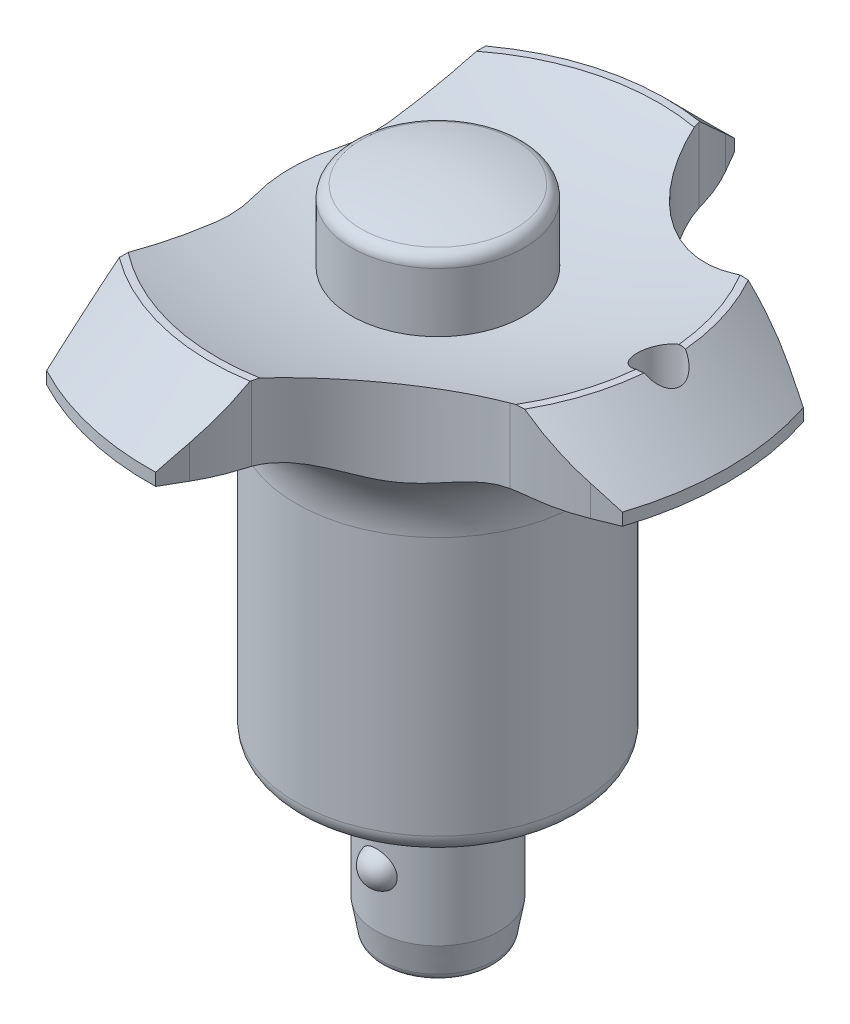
ISO-10303-21;
HEADER;
FILE_DESCRIPTION(('STEP AP214'),'2;1');
FILE_NAME('part.step','',(''),(''),'','','');
FILE_SCHEMA(('AUTOMOTIVE_DESIGN { 1 0 10303 214 1 1 1 1 }'));
ENDSEC;
DATA;
#1=APPLICATION_CONTEXT('core data for automotive mechanical design processes');
#2=APPLICATION_PROTOCOL_DEFINITION('international standard','automotive_design',2000,#1);
#3=PRODUCT_CONTEXT('',#1,'mechanical');
#4=PRODUCT('Part','Part','',(#3));
#5=PRODUCT_RELATED_PRODUCT_CATEGORY('part','',(#4));
#6=PRODUCT_DEFINITION_FORMATION('','',#4);
#7=PRODUCT_DEFINITION_CONTEXT('part definition',#1,'design');
#8=PRODUCT_DEFINITION('design','',#6,#7);
#9=PRODUCT_DEFINITION_SHAPE('','',#8);
#10=(LENGTH_UNIT() NAMED_UNIT(*) SI_UNIT(.MILLI.,.METRE.));
#11=(NAMED_UNIT(*) PLANE_ANGLE_UNIT() SI_UNIT($,.RADIAN.));
#12=(NAMED_UNIT(*) SI_UNIT($,.STERADIAN.) SOLID_ANGLE_UNIT());
#13=UNCERTAINTY_MEASURE_WITH_UNIT(LENGTH_MEASURE(1.E-05),#10,'distance_accuracy_value','');
#14=(GEOMETRIC_REPRESENTATION_CONTEXT(3) GLOBAL_UNCERTAINTY_ASSIGNED_CONTEXT((#13)) GLOBAL_UNIT_ASSIGNED_CONTEXT((#10,
#11,#12)) REPRESENTATION_CONTEXT('',''));
#15=CARTESIAN_POINT('',(0.,0.,0.));
#16=DIRECTION('',(0.,0.,1.));
#17=DIRECTION('',(1.,0.,0.));
#18=AXIS2_PLACEMENT_3D('',#15,#16,#17);
#19=CARTESIAN_POINT('',(0.,40.,0.));
#20=DIRECTION('',(0.,-1.,0.));
#21=DIRECTION('',(0.,0.,-1.));
#22=AXIS2_PLACEMENT_3D('',#19,#20,#21);
#23=CYLINDRICAL_SURFACE('',#22,7.);
#24=CARTESIAN_POINT('',(0.,38.2379000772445,0.));
#25=DIRECTION('',(0.,-1.,0.));
#26=DIRECTION('',(0.,0.,-1.));
#27=AXIS2_PLACEMENT_3D('',#24,#25,#26);
#28=CIRCLE('',#27,7.);
#29=CARTESIAN_POINT('',(0.,38.2379000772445,-7.));
#30=VERTEX_POINT('',#29);
#31=EDGE_CURVE('P0_E11',#30,#30,#28,.T.);
#32=ORIENTED_EDGE('',*,*,#31,.T.);
#33=EDGE_LOOP('',(#32));
#34=FACE_BOUND('',#33,.T.);
#35=CARTESIAN_POINT('',(0.,18.,0.));
#36=DIRECTION('',(0.,1.,0.));
#37=DIRECTION('',(0.,0.,1.));
#38=AXIS2_PLACEMENT_3D('',#35,#36,#37);
#39=CIRCLE('',#38,7.);
#40=CARTESIAN_POINT('',(0.,18.,7.));
#41=VERTEX_POINT('',#40);
#42=EDGE_CURVE('P0_E48',#41,#41,#39,.T.);
#43=ORIENTED_EDGE('',*,*,#42,.T.);
#44=EDGE_LOOP('',(#43));
#45=FACE_BOUND('',#44,.T.);
#46=ADVANCED_FACE('P0_F16',(#34,#45),#23,.T.);
#47=CARTESIAN_POINT('',(0.,18.,0.));
#48=DIRECTION('',(0.,1.,0.));
#49=DIRECTION('',(0.,0.,1.));
#50=AXIS2_PLACEMENT_3D('',#47,#48,#49);
#51=PLANE('',#50);
#52=ORIENTED_EDGE('',*,*,#42,.F.);
#53=EDGE_LOOP('',(#52));
#54=FACE_BOUND('',#53,.T.);
#55=ADVANCED_FACE('P0_F28',(#54),#51,.F.);
#56=CARTESIAN_POINT('',(0.,15.,0.));
#57=DIRECTION('',(0.,1.,0.));
#58=DIRECTION('',(-1.,0.,0.));
#59=AXIS2_PLACEMENT_3D('',#56,#57,#58);
#60=SPHERICAL_SURFACE('',#59,25.);
#61=CARTESIAN_POINT('',(0.,39.2061459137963,0.));
#62=DIRECTION('',(0.,-1.,0.));
#63=DIRECTION('',(0.,0.,-1.));
#64=AXIS2_PLACEMENT_3D('',#61,#62,#63);
#65=CIRCLE('',#64,6.25);
#66=CARTESIAN_POINT('',(0.,39.2061459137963,-6.25));
#67=VERTEX_POINT('',#66);
#68=EDGE_CURVE('P0_E23',#67,#67,#65,.F.);
#69=ORIENTED_EDGE('',*,*,#68,.T.);
#70=EDGE_LOOP('',(#69));
#71=FACE_BOUND('',#70,.T.);
#72=CARTESIAN_POINT('',(0.,40.,0.));
#73=VERTEX_POINT('',#72);
#74=VERTEX_LOOP('',#73);
#75=FACE_BOUND('',#74,.T.);
#76=ADVANCED_FACE('P0_F26',(#71,#75),#60,.T.);
#77=CARTESIAN_POINT('',(0.,38.2379000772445,0.));
#78=DIRECTION('',(0.,-1.,0.));
#79=DIRECTION('',(0.,0.,-1.));
#80=AXIS2_PLACEMENT_3D('',#77,#78,#79);
#81=TOROIDAL_SURFACE('',#80,6.,1.);
#82=ORIENTED_EDGE('',*,*,#31,.F.);
#83=EDGE_LOOP('',(#82));
#84=FACE_BOUND('',#83,.T.);
#85=ORIENTED_EDGE('',*,*,#68,.F.);
#86=EDGE_LOOP('',(#85));
#87=FACE_BOUND('',#86,.T.);
#88=ADVANCED_FACE('P0_F18',(#84,#87),#81,.T.);
#89=CLOSED_SHELL('',(#46,#55,#76,#88));
#90=MANIFOLD_SOLID_BREP('P0_B1',#89);
#91=CARTESIAN_POINT('',(-23.5,36.,0.));
#92=DIRECTION('',(0.,1.,0.));
#93=DIRECTION('',(-1.,0.,0.));
#94=AXIS2_PLACEMENT_3D('',#91,#92,#93);
#95=PLANE('',#94);
#96=CARTESIAN_POINT('',(0.,36.,0.));
#97=DIRECTION('',(0.,1.,0.));
#98=DIRECTION('',(-1.,0.,0.));
#99=AXIS2_PLACEMENT_3D('',#96,#97,#98);
#100=CIRCLE('',#99,17.9164728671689);
#101=CARTESIAN_POINT('',(17.8310068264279,36.,-1.74791177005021));
#102=VERTEX_POINT('',#101);
#103=CARTESIAN_POINT('',(15.4319392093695,36.,-9.10248604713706));
#104=VERTEX_POINT('',#103);
#105=EDGE_CURVE('P1_E287',#102,#104,#100,.T.);
#106=ORIENTED_EDGE('',*,*,#105,.F.);
#107=CARTESIAN_POINT('',(17.9164728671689,36.,0.));
#108=DIRECTION('',(0.,1.,0.));
#109=DIRECTION('',(0.,0.,1.));
#110=AXIS2_PLACEMENT_3D('',#107,#108,#109);
#111=CIRCLE('',#110,1.75);
#112=CARTESIAN_POINT('',(18.4240364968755,36.,-1.67477734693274));
#113=VERTEX_POINT('',#112);
#114=EDGE_CURVE('P1_E40',#113,#102,#111,.T.);
#115=ORIENTED_EDGE('',*,*,#114,.F.);
#116=CARTESIAN_POINT('',(0.,36.,0.));
#117=DIRECTION('',(0.,1.,0.));
#118=DIRECTION('',(-1.,0.,0.));
#119=AXIS2_PLACEMENT_3D('',#116,#117,#118);
#120=CIRCLE('',#119,18.5);
#121=CARTESIAN_POINT('',(16.1204041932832,36.,-9.07648437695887));
#122=VERTEX_POINT('',#121);
#123=EDGE_CURVE('P1_E231',#113,#122,#120,.T.);
#124=ORIENTED_EDGE('',*,*,#123,.T.);
#125=CARTESIAN_POINT('',(15.2479619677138,36.,4.89630505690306));
#126=DIRECTION('',(0.,-1.,0.));
#127=DIRECTION('',(0.,0.,-1.));
#128=AXIS2_PLACEMENT_3D('',#125,#126,#127);
#129=CIRCLE('',#128,14.);
#130=EDGE_CURVE('P1_E497',#104,#122,#129,.T.);
#131=ORIENTED_EDGE('',*,*,#130,.F.);
#132=EDGE_LOOP('',(#106,#115,#124,#131));
#133=FACE_BOUND('',#132,.T.);
#134=ADVANCED_FACE('P1_F16',(#133),#95,.T.);
#135=CARTESIAN_POINT('',(16.120404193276,36.,9.07648437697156));
#136=VERTEX_POINT('',#135);
#137=CARTESIAN_POINT('',(18.4240364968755,36.,1.67477734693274));
#138=VERTEX_POINT('',#137);
#139=EDGE_CURVE('P1_E229',#136,#138,#120,.T.);
#140=ORIENTED_EDGE('',*,*,#139,.T.);
#141=CARTESIAN_POINT('',(17.8310068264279,36.,1.74791177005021));
#142=VERTEX_POINT('',#141);
#143=EDGE_CURVE('P1_E213',#142,#138,#111,.T.);
#144=ORIENTED_EDGE('',*,*,#143,.F.);
#145=CARTESIAN_POINT('',(15.4319392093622,36.,9.1024860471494));
#146=VERTEX_POINT('',#145);
#147=EDGE_CURVE('P1_E285',#146,#142,#100,.T.);
#148=ORIENTED_EDGE('',*,*,#147,.F.);
#149=CARTESIAN_POINT('',(15.2479619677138,36.,-4.89630505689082));
#150=DIRECTION('',(0.,-1.,0.));
#151=DIRECTION('',(0.,0.,1.));
#152=AXIS2_PLACEMENT_3D('',#149,#150,#151);
#153=CIRCLE('',#152,14.);
#154=EDGE_CURVE('P1_E236',#136,#146,#153,.T.);
#155=ORIENTED_EDGE('',*,*,#154,.F.);
#156=EDGE_LOOP('',(#140,#144,#148,#155));
#157=FACE_BOUND('',#156,.T.);
#158=ADVANCED_FACE('P1_F235',(#157),#95,.T.);
#159=CARTESIAN_POINT('',(-19.,30.,0.));
#160=DIRECTION('',(0.,-1.,0.));
#161=DIRECTION('',(1.,0.,0.));
#162=AXIS2_PLACEMENT_3D('',#159,#160,#161);
#163=PLANE('',#162);
#164=CARTESIAN_POINT('',(0.,30.,0.));
#165=DIRECTION('',(0.,1.,0.));
#166=DIRECTION('',(-1.,0.,0.));
#167=AXIS2_PLACEMENT_3D('',#164,#165,#166);
#168=CIRCLE('',#167,19.);
#169=CARTESIAN_POINT('',(16.7190893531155,30.,9.02618696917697));
#170=VERTEX_POINT('',#169);
#171=CARTESIAN_POINT('',(18.9472979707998,30.,1.41417806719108));
#172=VERTEX_POINT('',#171);
#173=EDGE_CURVE('P1_E265',#170,#172,#168,.T.);
#174=ORIENTED_EDGE('',*,*,#173,.T.);
#175=CARTESIAN_POINT('',(17.9164728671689,30.,0.));
#176=DIRECTION('',(0.,-1.,0.));
#177=DIRECTION('',(1.,0.,0.));
#178=AXIS2_PLACEMENT_3D('',#175,#176,#177);
#179=CIRCLE('',#178,1.75);
#180=CARTESIAN_POINT('',(18.9472979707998,30.,-1.41417806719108));
#181=VERTEX_POINT('',#180);
#182=EDGE_CURVE('P1_E32',#172,#181,#179,.F.);
#183=ORIENTED_EDGE('',*,*,#182,.T.);
#184=CARTESIAN_POINT('',(16.7190893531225,30.,-9.02618696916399));
#185=VERTEX_POINT('',#184);
#186=EDGE_CURVE('P1_E266',#181,#185,#168,.T.);
#187=ORIENTED_EDGE('',*,*,#186,.T.);
#188=CARTESIAN_POINT('',(15.2479619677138,30.,4.89630505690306));
#189=DIRECTION('',(0.,-1.,0.));
#190=DIRECTION('',(1.,0.,0.));
#191=AXIS2_PLACEMENT_3D('',#188,#189,#190);
#192=CIRCLE('',#191,14.);
#193=CARTESIAN_POINT('',(20.465066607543,30.,-8.09530066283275));
#194=VERTEX_POINT('',#193);
#195=EDGE_CURVE('P1_E767',#185,#194,#192,.T.);
#196=ORIENTED_EDGE('',*,*,#195,.T.);
#197=DIRECTION('',(0.927971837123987,0.,0.372650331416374));
#198=VECTOR('',#197,1.);
#199=CARTESIAN_POINT('',(-10.7201265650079,30.,-20.6184959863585));
#200=LINE('',#199,#198);
#201=CARTESIAN_POINT('',(22.321010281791,30.,-7.35));
#202=VERTEX_POINT('',#201);
#203=EDGE_CURVE('P1_E595',#194,#202,#200,.T.);
#204=ORIENTED_EDGE('',*,*,#203,.T.);
#205=CARTESIAN_POINT('',(0.,30.,0.));
#206=DIRECTION('',(0.,1.,0.));
#207=DIRECTION('',(-1.,0.,0.));
#208=AXIS2_PLACEMENT_3D('',#205,#206,#207);
#209=CIRCLE('',#208,23.5);
#210=CARTESIAN_POINT('',(22.321010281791,30.,7.35000000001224));
#211=VERTEX_POINT('',#210);
#212=EDGE_CURVE('P1_E251',#211,#202,#209,.T.);
#213=ORIENTED_EDGE('',*,*,#212,.F.);
#214=DIRECTION('',(-0.927971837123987,0.,0.372650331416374));
#215=VECTOR('',#214,1.);
#216=CARTESIAN_POINT('',(-10.7201265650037,30.,20.6184959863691));
#217=LINE('',#216,#215);
#218=CARTESIAN_POINT('',(20.465066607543,30.,8.09530066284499));
#219=VERTEX_POINT('',#218);
#220=EDGE_CURVE('P1_E708',#211,#219,#217,.T.);
#221=ORIENTED_EDGE('',*,*,#220,.T.);
#222=CARTESIAN_POINT('',(15.2479619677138,30.,-4.89630505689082));
#223=DIRECTION('',(0.,-1.,0.));
#224=DIRECTION('',(1.,0.,0.));
#225=AXIS2_PLACEMENT_3D('',#222,#223,#224);
#226=CIRCLE('',#225,14.);
#227=EDGE_CURVE('P1_E665',#219,#170,#226,.T.);
#228=ORIENTED_EDGE('',*,*,#227,.T.);
#229=EDGE_LOOP('',(#174,#183,#187,#196,#204,#213,#221,#228));
#230=FACE_BOUND('',#229,.T.);
#231=ADVANCED_FACE('P1_F612',(#230),#163,.T.);
#232=CARTESIAN_POINT('',(0.,22.5,0.));
#233=DIRECTION('',(0.,1.,0.));
#234=DIRECTION('',(-1.,0.,0.));
#235=AXIS2_PLACEMENT_3D('',#232,#233,#234);
#236=TOROIDAL_SURFACE('',#235,19.,7.5);
#237=CARTESIAN_POINT('',(0.,22.5,0.));
#238=DIRECTION('',(0.,1.,0.));
#239=DIRECTION('',(-1.,0.,0.));
#240=AXIS2_PLACEMENT_3D('',#237,#238,#239);
#241=CIRCLE('',#240,11.5);
#242=CARTESIAN_POINT('',(-11.5,22.5,0.));
#243=VERTEX_POINT('',#242);
#244=EDGE_CURVE('P1_E274',#243,#243,#241,.T.);
#245=ORIENTED_EDGE('',*,*,#244,.T.);
#246=EDGE_LOOP('',(#245));
#247=FACE_BOUND('',#246,.T.);
#248=ORIENTED_EDGE('',*,*,#186,.F.);
#249=CARTESIAN_POINT('',(19.0002,29.9998345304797,-1.37405804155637));
#250=CARTESIAN_POINT('',(18.9621670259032,30.0000721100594,-1.40405462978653));
#251=CARTESIAN_POINT('',(18.9229043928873,30.0000618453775,-1.43245842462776));
#252=CARTESIAN_POINT('',(18.8421643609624,29.99943926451,-1.48591451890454));
#253=CARTESIAN_POINT('',(18.8006869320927,29.998826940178,-1.51096677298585));
#254=CARTESIAN_POINT('',(18.6734351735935,29.9959303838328,-1.58077253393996));
#255=CARTESIAN_POINT('',(18.584719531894,29.992587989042,-1.62027093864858));
#256=CARTESIAN_POINT('',(18.4021303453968,29.9824016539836,-1.68404521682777));
#257=CARTESIAN_POINT('',(18.3082526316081,29.9755548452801,-1.7083085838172));
#258=CARTESIAN_POINT('',(18.1181618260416,29.9579679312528,-1.74100944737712));
#259=CARTESIAN_POINT('',(18.0219496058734,29.9472292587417,-1.74945276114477));
#260=CARTESIAN_POINT('',(17.8303366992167,29.9218778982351,-1.75049381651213));
#261=CARTESIAN_POINT('',(17.7349343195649,29.9072800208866,-1.7431513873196));
#262=CARTESIAN_POINT('',(17.5471606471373,29.8745519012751,-1.71322871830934));
#263=CARTESIAN_POINT('',(17.4547903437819,29.8564205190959,-1.69064355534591));
#264=CARTESIAN_POINT('',(17.2734017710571,29.8169200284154,-1.63042918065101));
#265=CARTESIAN_POINT('',(17.1845073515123,29.7954867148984,-1.59246980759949));
#266=CARTESIAN_POINT('',(17.0144903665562,29.7508341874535,-1.50272225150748));
#267=CARTESIAN_POINT('',(16.9333693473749,29.7276146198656,-1.45093132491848));
#268=CARTESIAN_POINT('',(16.7775437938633,29.6798339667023,-1.33241085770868));
#269=CARTESIAN_POINT('',(16.7032498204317,29.655257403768,-1.26514688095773));
#270=CARTESIAN_POINT('',(16.5669685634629,29.6075854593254,-1.11863761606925));
#271=CARTESIAN_POINT('',(16.5049842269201,29.584490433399,-1.03938946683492));
#272=CARTESIAN_POINT('',(16.3947891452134,29.5417064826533,-0.870191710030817));
#273=CARTESIAN_POINT('',(16.3466708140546,29.5220407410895,-0.78017571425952));
#274=CARTESIAN_POINT('',(16.2665762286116,29.4884206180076,-0.592245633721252));
#275=CARTESIAN_POINT('',(16.2345892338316,29.4744624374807,-0.494336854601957));
#276=CARTESIAN_POINT('',(16.1897704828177,29.4546698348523,-0.300388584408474));
#277=CARTESIAN_POINT('',(16.175801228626,29.4483547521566,-0.204661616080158));
#278=CARTESIAN_POINT('',(16.1638587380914,29.442965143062,-0.0120283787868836));
#279=CARTESIAN_POINT('',(16.1658787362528,29.4438875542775,0.0848773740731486));
#280=CARTESIAN_POINT('',(16.1851398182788,29.452552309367,0.270399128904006));
#281=CARTESIAN_POINT('',(16.201378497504,29.4598454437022,0.359143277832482));
#282=CARTESIAN_POINT('',(16.2470514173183,29.4798790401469,0.532513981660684));
#283=CARTESIAN_POINT('',(16.2764877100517,29.4926203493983,0.617139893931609));
#284=CARTESIAN_POINT('',(16.3484657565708,29.5227477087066,0.782428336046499));
#285=CARTESIAN_POINT('',(16.3913311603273,29.540246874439,0.86292857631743));
#286=CARTESIAN_POINT('',(16.488610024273,29.5782278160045,1.01583807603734));
#287=CARTESIAN_POINT('',(16.543027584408,29.5987106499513,1.08824444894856));
#288=CARTESIAN_POINT('',(16.6668822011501,29.6428521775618,1.22902424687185));
#289=CARTESIAN_POINT('',(16.7371737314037,29.6666338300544,1.29660869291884));
#290=CARTESIAN_POINT('',(16.8879984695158,29.7141504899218,1.41922194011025));
#291=CARTESIAN_POINT('',(16.9685343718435,29.7378854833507,1.47424742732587));
#292=CARTESIAN_POINT('',(17.1413972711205,29.7846942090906,1.57226489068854));
#293=CARTESIAN_POINT('',(17.2340680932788,29.8077030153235,1.61468428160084));
#294=CARTESIAN_POINT('',(17.4260077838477,29.8506027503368,1.68294764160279));
#295=CARTESIAN_POINT('',(17.5252754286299,29.8704942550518,1.70879467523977));
#296=CARTESIAN_POINT('',(17.7248461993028,29.9057260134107,1.74233896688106));
#297=CARTESIAN_POINT('',(17.8250527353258,29.9211725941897,1.75049754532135));
#298=CARTESIAN_POINT('',(18.0259610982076,29.9477661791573,1.74945581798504));
#299=CARTESIAN_POINT('',(18.1266628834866,29.9589135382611,1.74025694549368));
#300=CARTESIAN_POINT('',(18.3214901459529,29.9766047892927,1.70525235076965));
#301=CARTESIAN_POINT('',(18.4157195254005,29.9833094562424,1.68009992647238));
#302=CARTESIAN_POINT('',(18.5988094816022,29.9932000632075,1.61441991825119));
#303=CARTESIAN_POINT('',(18.6876751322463,29.9963893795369,1.57390713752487));
#304=CARTESIAN_POINT('',(18.8124061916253,29.9990115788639,1.5039636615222));
#305=CARTESIAN_POINT('',(18.8514207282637,29.9995392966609,1.48002297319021));
#306=CARTESIAN_POINT('',(18.9273846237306,30.0000621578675,1.42920894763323));
#307=CARTESIAN_POINT('',(18.9643378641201,30.0000583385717,1.40234142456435));
#308=CARTESIAN_POINT('',(19.0002,29.9998345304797,1.37405804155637));
#309=B_SPLINE_CURVE_WITH_KNOTS('',3,(#249,#250,#251,#252,#253,#254,#255,#256,#257,#258,#259,
#260,#261,#262,#263,#264,#265,#266,#267,#268,#269,#270,#271,#272,#273,#274,#275,#276,#277,#278,
#279,#280,#281,#282,#283,#284,#285,#286,#287,#288,#289,#290,#291,#292,#293,#294,#295,#296,#297,
#298,#299,#300,#301,#302,#303,#304,#305,#306,#307,#308),.UNSPECIFIED.,.F.,.F.,(4,2,2,2,2,2,2,2,
2,2,2,2,2,2,2,2,2,2,2,2,2,2,2,2,2,2,2,2,2,4),(0.,0.145230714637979,0.29046339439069,
0.580469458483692,0.870713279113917,1.16085035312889,1.44988972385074,1.73902249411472,
2.03472475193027,2.33048570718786,2.63862322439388,2.94683442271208,3.25705463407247,
3.56706802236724,3.85635873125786,4.14552703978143,4.41581537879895,4.68614576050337,
4.96357032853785,5.24109352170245,5.54087080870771,5.84072710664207,6.15263607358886,
6.46448734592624,6.76810238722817,7.0716923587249,7.36358887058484,7.65520478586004,
7.79241563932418,7.92935872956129),.UNSPECIFIED.);
#310=EDGE_CURVE('P1_E232',#181,#172,#309,.T.);
#311=ORIENTED_EDGE('',*,*,#310,.T.);
#312=ORIENTED_EDGE('',*,*,#173,.F.);
#313=CARTESIAN_POINT('',(19.0002,29.7676490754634,8.59149349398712));
#314=CARTESIAN_POINT('',(18.7645817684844,29.8154776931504,8.65707959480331));
#315=CARTESIAN_POINT('',(18.5258665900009,29.8564543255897,8.71679949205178));
#316=CARTESIAN_POINT('',(18.0433655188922,29.9237457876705,8.82399353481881));
#317=CARTESIAN_POINT('',(17.7995737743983,29.9500426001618,8.87145259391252));
#318=CARTESIAN_POINT('',(17.3135741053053,29.9865231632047,8.95262184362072));
#319=CARTESIAN_POINT('',(17.0714332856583,29.9970209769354,8.98658985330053));
#320=CARTESIAN_POINT('',(16.5857032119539,30.0018812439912,9.04177656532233));
#321=CARTESIAN_POINT('',(16.3421152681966,29.9962565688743,9.06300542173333));
#322=CARTESIAN_POINT('',(15.9045129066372,29.9707577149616,9.08964322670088));
#323=CARTESIAN_POINT('',(15.7104540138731,29.9540015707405,9.09738600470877));
#324=CARTESIAN_POINT('',(15.3219339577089,29.9089292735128,9.10486432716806));
#325=CARTESIAN_POINT('',(15.1274823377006,29.8805202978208,9.10453429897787));
#326=CARTESIAN_POINT('',(14.9341448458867,29.8460787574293,9.10017731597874));
#327=B_SPLINE_CURVE_WITH_KNOTS('',3,(#313,#314,#315,#316,#317,#318,#319,#320,#321,#322,#323,
#324,#325,#326),.UNSPECIFIED.,.F.,.F.,(4,2,2,2,2,2,4),(0.,0.747551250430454,1.49601799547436,
2.22940004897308,2.96219676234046,3.54651953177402,4.13559011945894),.UNSPECIFIED.);
#328=CARTESIAN_POINT('',(14.9343448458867,29.8461143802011,9.10018179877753));
#329=VERTEX_POINT('',#328);
#330=EDGE_CURVE('P1_E662',#170,#329,#327,.T.);
#331=ORIENTED_EDGE('',*,*,#330,.T.);
#332=CARTESIAN_POINT('',(14.9345448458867,29.8461499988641,9.1001862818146));
#333=CARTESIAN_POINT('',(14.7776730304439,29.8182229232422,9.09666592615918));
#334=CARTESIAN_POINT('',(14.6213761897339,29.7868945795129,9.0962420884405));
#335=CARTESIAN_POINT('',(14.3102869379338,29.7182450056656,9.10142249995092));
#336=CARTESIAN_POINT('',(14.1554937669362,29.6809269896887,9.10702352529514));
#337=CARTESIAN_POINT('',(13.8480463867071,29.6011924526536,9.12406045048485));
#338=CARTESIAN_POINT('',(13.6953872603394,29.558791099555,9.13547930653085));
#339=CARTESIAN_POINT('',(13.3918757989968,29.4696235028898,9.16398000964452));
#340=CARTESIAN_POINT('',(13.2410237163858,29.4228566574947,9.18106263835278));
#341=CARTESIAN_POINT('',(12.7875574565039,29.2760524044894,9.24107419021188));
#342=CARTESIAN_POINT('',(12.4878197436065,29.1705318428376,9.2925514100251));
#343=CARTESIAN_POINT('',(11.8954511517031,28.9523945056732,9.41733991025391));
#344=CARTESIAN_POINT('',(11.6028250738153,28.8397731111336,9.49066552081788));
#345=CARTESIAN_POINT('',(11.0926476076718,28.6428308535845,9.63910928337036));
#346=CARTESIAN_POINT('',(10.8738718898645,28.5581805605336,9.70960863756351));
#347=CARTESIAN_POINT('',(10.4388960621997,28.3943373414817,9.86379108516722));
#348=CARTESIAN_POINT('',(10.2226957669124,28.3151440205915,9.94747322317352));
#349=CARTESIAN_POINT('',(9.79395589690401,28.1682154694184,10.1280569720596));
#350=CARTESIAN_POINT('',(9.58140098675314,28.1003976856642,10.2248532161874));
#351=CARTESIAN_POINT('',(9.15855200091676,27.9817636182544,10.4328111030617));
#352=CARTESIAN_POINT('',(8.94825640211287,27.9309350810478,10.5439623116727));
#353=CARTESIAN_POINT('',(8.58999154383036,27.8634617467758,10.747410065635));
#354=CARTESIAN_POINT('',(8.44110862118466,27.84122530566,10.836232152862));
#355=CARTESIAN_POINT('',(8.14633439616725,27.8104352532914,11.0209454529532));
#356=CARTESIAN_POINT('',(8.00044250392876,27.8018789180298,11.1168352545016));
#357=CARTESIAN_POINT('',(7.71306255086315,27.7991870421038,11.3148595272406));
#358=CARTESIAN_POINT('',(7.57156970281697,27.8050352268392,11.4169868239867));
#359=CARTESIAN_POINT('',(7.29397056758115,27.8306044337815,11.6266694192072));
#360=CARTESIAN_POINT('',(7.15786521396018,27.8503278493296,11.7342256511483));
#361=CARTESIAN_POINT('',(6.8451762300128,27.9111902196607,11.9924277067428));
#362=CARTESIAN_POINT('',(6.67114087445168,27.9574144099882,12.1449541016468));
#363=CARTESIAN_POINT('',(6.33499245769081,28.0668600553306,12.4568670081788));
#364=CARTESIAN_POINT('',(6.17288820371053,28.1300939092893,12.6162584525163));
#365=CARTESIAN_POINT('',(5.8588669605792,28.2683729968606,12.9427574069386));
#366=CARTESIAN_POINT('',(5.70705355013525,28.3435184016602,13.1099209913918));
#367=CARTESIAN_POINT('',(5.41445292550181,28.5000172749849,13.4507337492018));
#368=CARTESIAN_POINT('',(5.27366434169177,28.5813699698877,13.6243821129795));
#369=CARTESIAN_POINT('',(4.94422002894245,28.781188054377,14.0545977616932));
#370=CARTESIAN_POINT('',(4.76089734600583,28.9006217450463,14.3148176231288));
#371=CARTESIAN_POINT('',(4.41415052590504,29.1328851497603,14.851278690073));
#372=CARTESIAN_POINT('',(4.25073675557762,29.2457114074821,15.1275281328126));
#373=CARTESIAN_POINT('',(3.94580620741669,29.4548897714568,15.6943820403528));
#374=CARTESIAN_POINT('',(3.80410495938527,29.5513814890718,15.9848342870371));
#375=CARTESIAN_POINT('',(3.54271052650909,29.7210428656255,16.5817874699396));
#376=CARTESIAN_POINT('',(3.42298501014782,29.7942469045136,16.888263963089));
#377=CARTESIAN_POINT('',(3.26107257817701,29.8814375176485,17.3600045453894));
#378=CARTESIAN_POINT('',(3.20982780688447,29.9068037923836,17.5201218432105));
#379=CARTESIAN_POINT('',(3.11365433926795,29.948991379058,17.8440401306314));
#380=CARTESIAN_POINT('',(3.06875130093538,29.9657786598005,18.0078531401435));
#381=CARTESIAN_POINT('',(3.02727508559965,29.9778008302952,18.1729580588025));
#382=B_SPLINE_CURVE_WITH_KNOTS('',3,(#332,#333,#334,#335,#336,#337,#338,#339,#340,#341,#342,
#343,#344,#345,#346,#347,#348,#349,#350,#351,#352,#353,#354,#355,#356,#357,#358,#359,#360,#361,
#362,#363,#364,#365,#366,#367,#368,#369,#370,#371,#372,#373,#374,#375,#376,#377,#378,#379,#380,
#381),.UNSPECIFIED.,.F.,.F.,(4,2,2,2,2,2,2,2,2,2,2,2,2,2,2,2,2,2,2,2,2,2,2,2,4),(0.,
0.47800831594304,0.955760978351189,1.43212200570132,1.90854880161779,2.87314250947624,
3.83837028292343,4.5728575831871,5.3072916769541,6.03614076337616,6.7644630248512,
7.28819341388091,7.81181950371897,8.33485425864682,8.85797925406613,9.56460548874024,
10.271748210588,10.9851883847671,11.6985397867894,12.7174996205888,13.7369877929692,
14.7472664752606,15.7560466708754,16.2657760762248,16.7775120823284),.UNSPECIFIED.);
#383=CARTESIAN_POINT('',(3.02732533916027,29.977786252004,18.1727580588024));
#384=VERTEX_POINT('',#383);
#385=EDGE_CURVE('P1_E668',#329,#384,#382,.T.);
#386=ORIENTED_EDGE('',*,*,#385,.T.);
#387=CARTESIAN_POINT('',(3.02737559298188,29.9777716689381,18.1725580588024));
#388=CARTESIAN_POINT('',(3.00992607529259,29.9828366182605,18.2420077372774));
#389=CARTESIAN_POINT('',(2.99192781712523,29.9870243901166,18.3113828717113));
#390=CARTESIAN_POINT('',(2.95486116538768,29.9936665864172,18.4498703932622));
#391=CARTESIAN_POINT('',(2.93579364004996,29.9961223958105,18.5189829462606));
#392=CARTESIAN_POINT('',(2.89658780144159,29.9993297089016,18.6569430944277));
#393=CARTESIAN_POINT('',(2.87644948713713,30.000081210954,18.7257906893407));
#394=CARTESIAN_POINT('',(2.83510131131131,29.999904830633,18.8632214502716));
#395=CARTESIAN_POINT('',(2.81389060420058,29.9989756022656,18.931804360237));
#396=CARTESIAN_POINT('',(2.79215946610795,29.9972178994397,19.0002));
#397=B_SPLINE_CURVE_WITH_KNOTS('',3,(#387,#388,#389,#390,#391,#392,#393,#394,#395,#396),
.UNSPECIFIED.,.F.,.F.,(4,2,2,2,4),(0.,0.215353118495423,0.430533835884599,0.645714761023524,
0.861068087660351),.UNSPECIFIED.);
#398=CARTESIAN_POINT('',(2.85903351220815,30.,18.7836611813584));
#399=VERTEX_POINT('',#398);
#400=EDGE_CURVE('P1_E481',#384,#399,#397,.T.);
#401=ORIENTED_EDGE('',*,*,#400,.T.);
#402=CARTESIAN_POINT('',(-11.,30.,15.4919333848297));
#403=VERTEX_POINT('',#402);
#404=EDGE_CURVE('P1_E258',#403,#399,#168,.T.);
#405=ORIENTED_EDGE('',*,*,#404,.F.);
#406=CARTESIAN_POINT('',(-11.,26.0001388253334,5.65140051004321));
#407=CARTESIAN_POINT('',(-11.,25.8914638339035,5.52591584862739));
#408=CARTESIAN_POINT('',(-11.,25.7807368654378,5.40220834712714));
#409=CARTESIAN_POINT('',(-11.,25.5547974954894,5.15893017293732));
#410=CARTESIAN_POINT('',(-11.,25.4395848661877,5.03935971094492));
#411=CARTESIAN_POINT('',(-11.,25.2041427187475,4.80527955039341));
#412=CARTESIAN_POINT('',(-11.,25.0839139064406,4.6907691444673));
#413=CARTESIAN_POINT('',(-11.,24.8376323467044,4.4681930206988));
#414=CARTESIAN_POINT('',(-11.,24.7115813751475,4.36012536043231));
#415=CARTESIAN_POINT('',(-11.,24.5009776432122,4.19149901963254));
#416=CARTESIAN_POINT('',(-11.,24.418546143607,4.12829442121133));
#417=CARTESIAN_POINT('',(-11.,24.250608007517,4.0061276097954));
#418=CARTESIAN_POINT('',(-11.,24.1651021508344,3.94716433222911));
#419=CARTESIAN_POINT('',(-11.,23.990699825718,3.83461802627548));
#420=CARTESIAN_POINT('',(-11.,23.901806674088,3.78102991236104));
#421=CARTESIAN_POINT('',(-11.,23.7202750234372,3.68069069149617));
#422=CARTESIAN_POINT('',(-11.,23.6276383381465,3.63393632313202));
#423=CARTESIAN_POINT('',(-11.,23.4059831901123,3.53463454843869));
#424=CARTESIAN_POINT('',(-11.,23.2753468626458,3.48556434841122));
#425=CARTESIAN_POINT('',(-11.,23.0080420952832,3.40886798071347));
#426=CARTESIAN_POINT('',(-11.,22.8713903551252,3.38118597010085));
#427=CARTESIAN_POINT('',(-11.,22.593892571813,3.35172431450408));
#428=CARTESIAN_POINT('',(-11.,22.4530196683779,3.35018280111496));
#429=CARTESIAN_POINT('',(-11.,22.1735538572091,3.37394343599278));
#430=CARTESIAN_POINT('',(-11.,22.0349637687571,3.39927656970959));
#431=CARTESIAN_POINT('',(-11.,21.7272770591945,3.48212446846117));
#432=CARTESIAN_POINT('',(-11.,21.5600827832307,3.54649641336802));
#433=CARTESIAN_POINT('',(-11.,21.3181675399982,3.66124590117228));
#434=CARTESIAN_POINT('',(-11.,21.2388421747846,3.70264003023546));
#435=CARTESIAN_POINT('',(-11.,21.0829635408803,3.79038002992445));
#436=CARTESIAN_POINT('',(-11.,21.0064099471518,3.83672531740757));
#437=CARTESIAN_POINT('',(-11.,20.8281148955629,3.95124195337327));
#438=CARTESIAN_POINT('',(-11.,20.7275025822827,4.0211567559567));
#439=CARTESIAN_POINT('',(-11.,20.5304611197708,4.1666888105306));
#440=CARTESIAN_POINT('',(-11.,20.4340339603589,4.24230872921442));
#441=CARTESIAN_POINT('',(-11.,20.2446995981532,4.39811609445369));
#442=CARTESIAN_POINT('',(-11.,20.1517983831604,4.4783107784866));
#443=CARTESIAN_POINT('',(-11.,19.9692211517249,4.64230213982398));
#444=CARTESIAN_POINT('',(-11.,19.8795457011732,4.72609944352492));
#445=CARTESIAN_POINT('',(-11.,19.6138403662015,4.98286613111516));
#446=CARTESIAN_POINT('',(-11.,19.4421585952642,5.16034317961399));
#447=CARTESIAN_POINT('',(-11.,19.1086455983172,5.52393658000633));
#448=CARTESIAN_POINT('',(-11.,18.9468058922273,5.71004524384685));
#449=CARTESIAN_POINT('',(-11.,18.6289049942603,6.09296931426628));
#450=CARTESIAN_POINT('',(-11.,18.4730058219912,6.28991901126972));
#451=CARTESIAN_POINT('',(-11.,18.1697506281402,6.69032047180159));
#452=CARTESIAN_POINT('',(-11.,18.0223959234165,6.89377323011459));
#453=CARTESIAN_POINT('',(-11.,17.7360597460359,7.30675624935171));
#454=CARTESIAN_POINT('',(-11.,17.5970857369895,7.51629168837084));
#455=CARTESIAN_POINT('',(-11.,17.3278495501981,7.94089288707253));
#456=CARTESIAN_POINT('',(-11.,17.1975881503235,8.15595913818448));
#457=CARTESIAN_POINT('',(-11.,16.82143434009,8.80727089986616));
#458=CARTESIAN_POINT('',(-11.,16.5889546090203,9.25138356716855));
#459=CARTESIAN_POINT('',(-11.,16.16461781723,10.1583038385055));
#460=CARTESIAN_POINT('',(-11.,15.9727284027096,10.6210962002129));
#461=CARTESIAN_POINT('',(-11.,15.6860131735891,11.4214373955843));
#462=CARTESIAN_POINT('',(-11.,15.5793553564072,11.7547653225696));
#463=CARTESIAN_POINT('',(-11.,15.3908562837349,12.4284392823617));
#464=CARTESIAN_POINT('',(-11.,15.309015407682,12.7687854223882));
#465=CARTESIAN_POINT('',(-11.,15.1725616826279,13.4546818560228));
#466=CARTESIAN_POINT('',(-11.,15.1179294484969,13.8002282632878));
#467=CARTESIAN_POINT('',(-11.,15.0382051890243,14.4947213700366));
#468=CARTESIAN_POINT('',(-11.,15.0131067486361,14.8436673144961));
#469=CARTESIAN_POINT('',(-11.,14.9965146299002,15.4756768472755));
#470=CARTESIAN_POINT('',(-11.,14.9995202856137,15.7586003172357));
#471=CARTESIAN_POINT('',(-11.,15.0275360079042,16.3233469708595));
#472=CARTESIAN_POINT('',(-11.,15.052541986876,16.6051703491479));
#473=CARTESIAN_POINT('',(-11.,15.1255709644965,17.1656636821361));
#474=CARTESIAN_POINT('',(-11.,15.1735793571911,17.4443355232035));
#475=CARTESIAN_POINT('',(-11.,15.2934720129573,17.9965080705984));
#476=CARTESIAN_POINT('',(-11.,15.3653530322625,18.2700094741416));
#477=CARTESIAN_POINT('',(-11.,15.5208557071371,18.7685104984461));
#478=CARTESIAN_POINT('',(-11.,15.6010500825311,18.9945819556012));
#479=CARTESIAN_POINT('',(-11.,15.7792740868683,19.4395670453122));
#480=CARTESIAN_POINT('',(-11.,15.8773005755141,19.6584819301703));
#481=CARTESIAN_POINT('',(-11.,16.0912261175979,20.0874227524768));
#482=CARTESIAN_POINT('',(-11.,16.2071254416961,20.2974485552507));
#483=CARTESIAN_POINT('',(-11.,16.4566083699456,20.7067505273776));
#484=CARTESIAN_POINT('',(-11.,16.5901922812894,20.9060265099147));
#485=CARTESIAN_POINT('',(-11.,16.8754508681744,21.2930377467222));
#486=CARTESIAN_POINT('',(-11.,17.0272281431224,21.4806975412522));
#487=CARTESIAN_POINT('',(-11.,17.3475169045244,21.8411854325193));
#488=CARTESIAN_POINT('',(-11.,17.5160288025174,22.0140131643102));
#489=CARTESIAN_POINT('',(-11.,17.8686967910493,22.342786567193));
#490=CARTESIAN_POINT('',(-11.,18.0528472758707,22.4987382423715));
#491=CARTESIAN_POINT('',(-11.,18.4355030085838,22.7919012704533));
#492=CARTESIAN_POINT('',(-11.,18.6340063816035,22.9291150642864));
#493=CARTESIAN_POINT('',(-11.,19.0211389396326,23.1690304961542));
#494=CARTESIAN_POINT('',(-11.,19.2084467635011,23.2738689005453));
#495=CARTESIAN_POINT('',(-11.,19.591777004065,23.4661723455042));
#496=CARTESIAN_POINT('',(-11.,19.7877986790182,23.553638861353));
#497=CARTESIAN_POINT('',(-11.,20.1869541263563,23.7101832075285));
#498=CARTESIAN_POINT('',(-11.,20.3900846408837,23.7792693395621));
#499=CARTESIAN_POINT('',(-11.,20.801878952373,23.8983024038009));
#500=CARTESIAN_POINT('',(-11.,21.010542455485,23.9482503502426));
#501=CARTESIAN_POINT('',(-11.,21.4151424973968,24.025281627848));
#502=CARTESIAN_POINT('',(-11.,21.6107980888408,24.0538476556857));
#503=CARTESIAN_POINT('',(-11.,22.003844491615,24.0939286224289));
#504=CARTESIAN_POINT('',(-11.,22.2012352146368,24.105444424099));
#505=CARTESIAN_POINT('',(-11.,22.5962298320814,24.1113063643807));
#506=CARTESIAN_POINT('',(-11.,22.7938336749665,24.105655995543));
#507=CARTESIAN_POINT('',(-11.,23.1878083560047,24.0772516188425));
#508=CARTESIAN_POINT('',(-11.,23.3841791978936,24.0544976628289));
#509=CARTESIAN_POINT('',(-11.,23.7688501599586,23.9929798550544));
#510=CARTESIAN_POINT('',(-11.,23.9572236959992,23.9546736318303));
#511=CARTESIAN_POINT('',(-11.,24.3301776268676,23.8624608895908));
#512=CARTESIAN_POINT('',(-11.,24.5147567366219,23.8085491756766));
#513=CARTESIAN_POINT('',(-11.,24.878778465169,23.6856519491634));
#514=CARTESIAN_POINT('',(-11.,25.0582221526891,23.6166695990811));
#515=CARTESIAN_POINT('',(-11.,25.4108691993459,23.4642559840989));
#516=CARTESIAN_POINT('',(-11.,25.5840722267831,23.3808239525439));
#517=CARTESIAN_POINT('',(-11.,25.9262212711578,23.1986355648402));
#518=CARTESIAN_POINT('',(-11.,26.0950350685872,23.0996310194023));
#519=CARTESIAN_POINT('',(-11.,26.4241068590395,22.8883034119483));
#520=CARTESIAN_POINT('',(-11.,26.584364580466,22.7759799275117));
#521=CARTESIAN_POINT('',(-11.,26.8954487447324,22.5389822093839));
#522=CARTESIAN_POINT('',(-11.,27.0462756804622,22.4143086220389));
#523=CARTESIAN_POINT('',(-11.,27.3378249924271,22.153579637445));
#524=CARTESIAN_POINT('',(-11.,27.4785439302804,22.0175204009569));
#525=CARTESIAN_POINT('',(-11.,27.7572525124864,21.726730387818));
#526=CARTESIAN_POINT('',(-11.,27.8945862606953,21.571370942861));
#527=CARTESIAN_POINT('',(-11.,28.1566455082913,21.2503544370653));
#528=CARTESIAN_POINT('',(-11.,28.2813698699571,21.0846964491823));
#529=CARTESIAN_POINT('',(-11.,28.5178450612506,20.7443058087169));
#530=CARTESIAN_POINT('',(-11.,28.6295920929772,20.5695705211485));
#531=CARTESIAN_POINT('',(-11.,28.8398043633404,20.212352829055));
#532=CARTESIAN_POINT('',(-11.,28.9382723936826,20.0298720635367));
#533=CARTESIAN_POINT('',(-11.,29.1310233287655,19.6397530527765));
#534=CARTESIAN_POINT('',(-11.,29.2239058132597,19.4314225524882));
#535=CARTESIAN_POINT('',(-11.,29.3935355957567,19.008302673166));
#536=CARTESIAN_POINT('',(-11.,29.470281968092,18.793512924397));
#537=CARTESIAN_POINT('',(-11.,29.6078362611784,18.3588380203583));
#538=CARTESIAN_POINT('',(-11.,29.6686398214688,18.1389514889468));
#539=CARTESIAN_POINT('',(-11.,29.7745962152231,17.6954335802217));
#540=CARTESIAN_POINT('',(-11.,29.8197472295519,17.4718017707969));
#541=CARTESIAN_POINT('',(-11.,29.9001438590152,16.9900120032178));
#542=CARTESIAN_POINT('',(-11.,29.9330683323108,16.7314659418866));
#543=CARTESIAN_POINT('',(-11.,29.9797816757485,16.2126660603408));
#544=CARTESIAN_POINT('',(-11.,29.9935692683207,15.9524121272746));
#545=CARTESIAN_POINT('',(-11.,30.00286794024,15.4315349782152));
#546=CARTESIAN_POINT('',(-11.,29.998374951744,15.1709116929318));
#547=CARTESIAN_POINT('',(-11.,29.9720366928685,14.6505324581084));
#548=CARTESIAN_POINT('',(-11.,29.9501882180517,14.3907766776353));
#549=CARTESIAN_POINT('',(-11.,29.8749142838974,13.7423797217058));
#550=CARTESIAN_POINT('',(-11.,29.8111129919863,13.3549147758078));
#551=CARTESIAN_POINT('',(-11.,29.6497207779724,12.5870504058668));
#552=CARTESIAN_POINT('',(-11.,29.5521152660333,12.2066541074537));
#553=CARTESIAN_POINT('',(-11.,29.3261462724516,11.4541845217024));
#554=CARTESIAN_POINT('',(-11.,29.197710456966,11.0821330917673));
#555=CARTESIAN_POINT('',(-11.,28.9133212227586,10.3488339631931));
#556=CARTESIAN_POINT('',(-11.,28.7573720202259,9.9875846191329));
#557=CARTESIAN_POINT('',(-11.,28.4189694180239,9.27327077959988));
#558=CARTESIAN_POINT('',(-11.,28.2362632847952,8.92032643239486));
#559=CARTESIAN_POINT('',(-11.,27.8477922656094,8.22729148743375));
#560=CARTESIAN_POINT('',(-11.,27.6420214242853,7.88720423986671));
#561=CARTESIAN_POINT('',(-11.,27.2093205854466,7.22152193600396));
#562=CARTESIAN_POINT('',(-11.,26.9824261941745,6.89590381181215));
#563=CARTESIAN_POINT('',(-11.,26.6262474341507,6.41949667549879));
#564=CARTESIAN_POINT('',(-11.,26.5049031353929,6.26272269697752));
#565=CARTESIAN_POINT('',(-11.,26.2567268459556,5.95358847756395));
#566=CARTESIAN_POINT('',(-11.,26.1298954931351,5.80122772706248));
#567=CARTESIAN_POINT('',(-11.,26.0001388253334,5.65140051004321));
#568=B_SPLINE_CURVE_WITH_KNOTS('',3,(#406,#407,#408,#409,#410,#411,#412,#413,#414,#415,#416,
#417,#418,#419,#420,#421,#422,#423,#424,#425,#426,#427,#428,#429,#430,#431,#432,#433,#434,#435,
#436,#437,#438,#439,#440,#441,#442,#443,#444,#445,#446,#447,#448,#449,#450,#451,#452,#453,#454,
#455,#456,#457,#458,#459,#460,#461,#462,#463,#464,#465,#466,#467,#468,#469,#470,#471,#472,#473,
#474,#475,#476,#477,#478,#479,#480,#481,#482,#483,#484,#485,#486,#487,#488,#489,#490,#491,#492,
#493,#494,#495,#496,#497,#498,#499,#500,#501,#502,#503,#504,#505,#506,#507,#508,#509,#510,#511,
#512,#513,#514,#515,#516,#517,#518,#519,#520,#521,#522,#523,#524,#525,#526,#527,#528,#529,#530,
#531,#532,#533,#534,#535,#536,#537,#538,#539,#540,#541,#542,#543,#544,#545,#546,#547,#548,#549,
#550,#551,#552,#553,#554,#555,#556,#557,#558,#559,#560,#561,#562,#563,#564,#565,#566,#567),
.UNSPECIFIED.,.T.,.F.,(4,2,2,2,2,2,2,2,2,2,2,2,2,2,2,2,2,2,2,2,2,2,2,2,2,2,2,2,2,2,2,2,2,2,2,2,
2,2,2,2,2,2,2,2,2,2,2,2,2,2,2,2,2,2,2,2,2,2,2,2,2,2,2,2,2,2,2,2,2,2,2,2,2,2,2,2,2,2,2,2,4),(0.,
0.497978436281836,0.995982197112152,1.49391611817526,1.99169914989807,2.30321626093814,
2.61465490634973,2.92579605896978,3.23678823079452,3.65401907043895,4.07015683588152,
4.49008346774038,4.91049478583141,5.44475666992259,5.713082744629,5.98137725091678,
6.34867116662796,6.71613783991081,7.08420291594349,7.45233224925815,8.19261430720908,
8.93224921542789,9.68555023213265,10.4389670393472,11.1930451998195,11.9471905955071,
13.4490947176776,14.9497971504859,15.9988883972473,17.0479956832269,18.0963544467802,
19.1444854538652,19.9925206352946,20.8403982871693,21.6877382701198,22.5349631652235,
23.2538652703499,23.9726408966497,24.6914274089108,25.4102264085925,26.13328869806,
26.8563687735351,27.5791907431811,28.3019184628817,28.9450258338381,29.588078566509,
30.2308403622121,30.8735680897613,31.466029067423,32.0584600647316,32.6507705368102,
33.2430792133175,33.819094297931,34.3953013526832,34.9713876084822,35.5475044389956,
36.1339625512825,36.7204392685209,37.3068853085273,37.8935299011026,38.5149387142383,
39.1364035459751,39.7580497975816,40.3795651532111,41.0631598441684,41.7467937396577,
42.4306144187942,43.1145145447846,43.8956533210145,44.6768442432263,45.4582090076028,
46.2397180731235,47.4160012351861,48.5927927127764,49.7723726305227,50.9517719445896,
52.1431311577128,53.3347986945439,54.5244926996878,55.1191420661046,55.7137224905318),.UNSPECIFIED.);
#569=CARTESIAN_POINT('',(-11.,27.1492287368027,7.14142842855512));
#570=VERTEX_POINT('',#569);
#571=EDGE_CURVE('P1_E531',#403,#570,#568,.T.);
#572=ORIENTED_EDGE('',*,*,#571,.T.);
#573=CARTESIAN_POINT('',(-11.0000000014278,27.1493665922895,7.14162842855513));
#574=CARTESIAN_POINT('',(-11.0000020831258,27.0822316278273,7.04420897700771));
#575=CARTESIAN_POINT('',(-11.001014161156,27.0148645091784,6.94695052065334));
#576=CARTESIAN_POINT('',(-11.0050634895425,26.8800159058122,6.75254408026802));
#577=CARTESIAN_POINT('',(-11.0081008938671,26.8125344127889,6.65539610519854));
#578=CARTESIAN_POINT('',(-11.0162293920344,26.6774294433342,6.4604541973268));
#579=CARTESIAN_POINT('',(-11.0213322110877,26.6098073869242,6.36265976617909));
#580=CARTESIAN_POINT('',(-11.0336265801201,26.4752675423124,6.1667228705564));
#581=CARTESIAN_POINT('',(-11.0408180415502,26.4083497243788,6.06858042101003));
#582=CARTESIAN_POINT('',(-11.057916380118,26.2712688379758,5.86493087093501));
#583=CARTESIAN_POINT('',(-11.0679745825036,26.2011942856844,5.75937654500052));
#584=CARTESIAN_POINT('',(-11.0906754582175,26.0633758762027,5.54703403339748));
#585=CARTESIAN_POINT('',(-11.1033178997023,25.9956318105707,5.44024595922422));
#586=CARTESIAN_POINT('',(-11.1313484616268,25.863843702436,5.22511894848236));
#587=CARTESIAN_POINT('',(-11.1467295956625,25.79979078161,5.11678458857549));
#588=CARTESIAN_POINT('',(-11.1805240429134,25.6768902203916,4.89768746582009));
#589=CARTESIAN_POINT('',(-11.1989359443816,25.6180401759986,4.78692585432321));
#590=CARTESIAN_POINT('',(-11.2334611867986,25.5234831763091,4.59406076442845));
#591=CARTESIAN_POINT('',(-11.2487494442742,25.4859412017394,4.51272194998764));
#592=CARTESIAN_POINT('',(-11.2812034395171,25.4158687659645,4.34827992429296));
#593=CARTESIAN_POINT('',(-11.2983697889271,25.3833399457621,4.26517614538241));
#594=CARTESIAN_POINT('',(-11.3524010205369,25.2962505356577,4.01547826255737));
#595=CARTESIAN_POINT('',(-11.3922474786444,25.2508474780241,3.8459433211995));
#596=CARTESIAN_POINT('',(-11.4520256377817,25.2132477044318,3.61203665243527));
#597=CARTESIAN_POINT('',(-11.4685613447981,25.2055689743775,3.54915650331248));
#598=CARTESIAN_POINT('',(-11.5027446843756,25.1952020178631,3.4227700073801));
#599=CARTESIAN_POINT('',(-11.5203998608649,25.1925524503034,3.35926255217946));
#600=CARTESIAN_POINT('',(-11.5385186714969,25.1925824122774,3.29584389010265));
#601=B_SPLINE_CURVE_WITH_KNOTS('',3,(#573,#574,#575,#576,#577,#578,#579,#580,#581,#582,#583,
#584,#585,#586,#587,#588,#589,#590,#591,#592,#593,#594,#595,#596,#597,#598,#599,#600),
.UNSPECIFIED.,.F.,.F.,(4,2,2,2,2,2,2,2,2,2,2,2,2,4),(0.,0.354929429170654,0.709885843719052,
1.06688623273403,1.42387148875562,1.80511742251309,2.18632916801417,2.5665820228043,
2.94665825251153,3.21912681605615,3.49168438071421,4.02810429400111,4.22433889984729,
4.42207593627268),.UNSPECIFIED.);
#602=CARTESIAN_POINT('',(-11.5384615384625,25.1925824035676,3.29604389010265));
#603=VERTEX_POINT('',#602);
#604=EDGE_CURVE('P1_E555',#570,#603,#601,.T.);
#605=ORIENTED_EDGE('',*,*,#604,.T.);
#606=CARTESIAN_POINT('',(0.,25.1925824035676,0.));
#607=DIRECTION('',(0.,-1.,0.));
#608=DIRECTION('',(1.,0.,0.));
#609=AXIS2_PLACEMENT_3D('',#606,#607,#608);
#610=CIRCLE('',#609,12.0000000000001);
#611=CARTESIAN_POINT('',(-11.5384615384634,25.1925824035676,-3.29604389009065));
#612=VERTEX_POINT('',#611);
#613=EDGE_CURVE('P1_E562',#603,#612,#610,.T.);
#614=ORIENTED_EDGE('',*,*,#613,.T.);
#615=CARTESIAN_POINT('',(-11.5385186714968,25.1925824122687,-3.29584389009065));
#616=CARTESIAN_POINT('',(-11.5144298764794,25.1924633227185,-3.38012862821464));
#617=CARTESIAN_POINT('',(-11.4911748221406,25.1972030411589,-3.464566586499));
#618=CARTESIAN_POINT('',(-11.44654289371,25.2154924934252,-3.63268812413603));
#619=CARTESIAN_POINT('',(-11.4251599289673,25.2290123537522,-3.71637328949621));
#620=CARTESIAN_POINT('',(-11.3847380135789,25.2636061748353,-3.8808009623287));
#621=CARTESIAN_POINT('',(-11.3656598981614,25.284519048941,-3.96156859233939));
#622=CARTESIAN_POINT('',(-11.3293180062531,25.3327292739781,-4.12162953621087));
#623=CARTESIAN_POINT('',(-11.3120556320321,25.3600315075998,-4.20092167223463));
#624=CARTESIAN_POINT('',(-11.2563694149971,25.4615082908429,-4.46754990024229));
#625=CARTESIAN_POINT('',(-11.2220742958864,25.5478781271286,-4.65106822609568));
#626=CARTESIAN_POINT('',(-11.1618604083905,25.7370779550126,-5.01086468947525));
#627=CARTESIAN_POINT('',(-11.1359630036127,25.8399489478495,-5.18712338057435));
#628=CARTESIAN_POINT('',(-11.0909690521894,26.0563210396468,-5.53810729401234));
#629=CARTESIAN_POINT('',(-11.0719983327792,26.1699756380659,-5.71275281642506));
#630=CARTESIAN_POINT('',(-11.0407866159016,26.4015228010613,-6.05947926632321));
#631=CARTESIAN_POINT('',(-11.0285381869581,26.5194105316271,-6.23156282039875));
#632=CARTESIAN_POINT('',(-11.0129291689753,26.7235722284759,-6.52723444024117));
#633=CARTESIAN_POINT('',(-11.0080432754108,26.8095060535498,-6.65098000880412));
#634=CARTESIAN_POINT('',(-11.0016035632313,26.9802091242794,-6.89693870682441));
#635=CARTESIAN_POINT('',(-11.0000065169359,27.06497873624,-7.01915045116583));
#636=CARTESIAN_POINT('',(-11.0000000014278,27.1493665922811,-7.14162842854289));
#637=B_SPLINE_CURVE_WITH_KNOTS('',3,(#615,#616,#617,#618,#619,#620,#621,#622,#623,#624,#625,
#626,#627,#628,#629,#630,#631,#632,#633,#634,#635,#636),.UNSPECIFIED.,.F.,.F.,(4,2,2,2,2,2,2,2,
2,2,4),(0.,0.262715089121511,0.52454096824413,0.780981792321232,1.03761922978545,
1.65279708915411,2.26952788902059,2.896961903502,3.52370088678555,3.97587581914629,
4.42206854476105),.UNSPECIFIED.);
#638=CARTESIAN_POINT('',(-11.,27.1492287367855,-7.14142842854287));
#639=VERTEX_POINT('',#638);
#640=EDGE_CURVE('P1_E290',#612,#639,#637,.T.);
#641=ORIENTED_EDGE('',*,*,#640,.T.);
#642=CARTESIAN_POINT('',(-11.,29.7199297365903,-17.9242478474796));
#643=CARTESIAN_POINT('',(-11.,29.6628964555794,-18.1622001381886));
#644=CARTESIAN_POINT('',(-11.,29.5968457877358,-18.3979828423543));
#645=CARTESIAN_POINT('',(-11.,29.4463118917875,-18.8636731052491));
#646=CARTESIAN_POINT('',(-11.,29.361825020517,-19.0935794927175));
#647=CARTESIAN_POINT('',(-11.,29.1741401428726,-19.545887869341));
#648=CARTESIAN_POINT('',(-11.,29.0709253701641,-19.7682829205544));
#649=CARTESIAN_POINT('',(-11.,28.8458540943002,-20.2034252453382));
#650=CARTESIAN_POINT('',(-11.,28.7239996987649,-20.4161736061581));
#651=CARTESIAN_POINT('',(-11.,28.4611086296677,-20.8312768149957));
#652=CARTESIAN_POINT('',(-11.,28.3199620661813,-21.0335622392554));
#653=CARTESIAN_POINT('',(-11.,28.0195754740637,-21.4242653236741));
#654=CARTESIAN_POINT('',(-11.,27.8603346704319,-21.612682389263));
#655=CARTESIAN_POINT('',(-11.,27.5247085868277,-21.9733984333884));
#656=CARTESIAN_POINT('',(-11.,27.3483331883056,-22.1457065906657));
#657=CARTESIAN_POINT('',(-11.,26.9795466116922,-22.4722078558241));
#658=CARTESIAN_POINT('',(-11.,26.7871376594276,-22.6264034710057));
#659=CARTESIAN_POINT('',(-11.,26.4097724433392,-22.8988212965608));
#660=CARTESIAN_POINT('',(-11.,26.2263230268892,-23.0191347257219));
#661=CARTESIAN_POINT('',(-11.,25.8492128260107,-23.242520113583));
#662=CARTESIAN_POINT('',(-11.,25.6555530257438,-23.3455937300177));
#663=CARTESIAN_POINT('',(-11.,25.2595892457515,-23.5332861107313));
#664=CARTESIAN_POINT('',(-11.,25.0572892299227,-23.6179132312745));
#665=CARTESIAN_POINT('',(-11.,24.6456263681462,-23.7677671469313));
#666=CARTESIAN_POINT('',(-11.,24.4362639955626,-23.8329952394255));
#667=CARTESIAN_POINT('',(-11.,24.0309926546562,-23.9383978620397));
#668=CARTESIAN_POINT('',(-11.,23.8355244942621,-23.9802739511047));
#669=CARTESIAN_POINT('',(-11.,23.4416837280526,-24.0468089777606));
#670=CARTESIAN_POINT('',(-11.,23.2433113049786,-24.0714689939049));
#671=CARTESIAN_POINT('',(-11.,22.8452183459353,-24.1033107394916));
#672=CARTESIAN_POINT('',(-11.,22.6454981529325,-24.1104967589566));
#673=CARTESIAN_POINT('',(-11.,22.246196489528,-24.107327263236));
#674=CARTESIAN_POINT('',(-11.,22.0466150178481,-24.0969719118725));
#675=CARTESIAN_POINT('',(-11.,21.6564018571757,-24.0595286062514));
#676=CARTESIAN_POINT('',(-11.,21.4657097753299,-24.0330663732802));
#677=CARTESIAN_POINT('',(-11.,21.0871592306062,-23.9642095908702));
#678=CARTESIAN_POINT('',(-11.,20.8993017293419,-23.9218097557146));
#679=CARTESIAN_POINT('',(-11.,20.5278279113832,-23.821497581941));
#680=CARTESIAN_POINT('',(-11.,20.3442105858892,-23.7635889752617));
#681=CARTESIAN_POINT('',(-11.,19.9823852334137,-23.6327967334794));
#682=CARTESIAN_POINT('',(-11.,19.8041774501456,-23.5599124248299));
#683=CARTESIAN_POINT('',(-11.,19.4525747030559,-23.3990423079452));
#684=CARTESIAN_POINT('',(-11.,19.2792451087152,-23.3109137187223));
#685=CARTESIAN_POINT('',(-11.,18.9403247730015,-23.1208604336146));
#686=CARTESIAN_POINT('',(-11.,18.7747342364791,-23.018935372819));
#687=CARTESIAN_POINT('',(-11.,18.4522538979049,-22.8021900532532));
#688=CARTESIAN_POINT('',(-11.,18.2953631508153,-22.6873711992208));
#689=CARTESIAN_POINT('',(-11.,17.9910146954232,-22.4457384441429));
#690=CARTESIAN_POINT('',(-11.,17.8435609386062,-22.318919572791));
#691=CARTESIAN_POINT('',(-11.,17.5514421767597,-22.0474571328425));
#692=CARTESIAN_POINT('',(-11.,17.4073195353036,-21.9022299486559));
#693=CARTESIAN_POINT('',(-11.,17.1310347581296,-21.6009172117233));
#694=CARTESIAN_POINT('',(-11.,16.9988687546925,-21.4448351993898));
#695=CARTESIAN_POINT('',(-11.,16.7468649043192,-21.1229084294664));
#696=CARTESIAN_POINT('',(-11.,16.6270329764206,-20.9570590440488));
#697=CARTESIAN_POINT('',(-11.,16.4001339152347,-20.6169178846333));
#698=CARTESIAN_POINT('',(-11.,16.2930639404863,-20.4426280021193));
#699=CARTESIAN_POINT('',(-11.,16.0825570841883,-20.0703010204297));
#700=CARTESIAN_POINT('',(-11.,15.9803692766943,-19.8715574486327));
#701=CARTESIAN_POINT('',(-11.,15.7915154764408,-19.4668372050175));
#702=CARTESIAN_POINT('',(-11.,15.7048503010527,-19.2608601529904));
#703=CARTESIAN_POINT('',(-11.,15.5469540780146,-18.8430178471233));
#704=CARTESIAN_POINT('',(-11.,15.4757275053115,-18.631150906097));
#705=CARTESIAN_POINT('',(-11.,15.3485316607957,-18.2028799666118));
#706=CARTESIAN_POINT('',(-11.,15.292564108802,-17.9864754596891));
#707=CARTESIAN_POINT('',(-11.,15.1890789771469,-17.521119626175));
#708=CARTESIAN_POINT('',(-11.,15.1436983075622,-17.2716924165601));
#709=CARTESIAN_POINT('',(-11.,15.0715588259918,-16.7701744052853));
#710=CARTESIAN_POINT('',(-11.,15.0448011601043,-16.5180834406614));
#711=CARTESIAN_POINT('',(-11.,15.0091818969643,-16.012618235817));
#712=CARTESIAN_POINT('',(-11.,15.000322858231,-15.7592438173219));
#713=CARTESIAN_POINT('',(-11.,14.9996943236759,-15.2524637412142));
#714=CARTESIAN_POINT('',(-11.,15.0079279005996,-14.9990580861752));
#715=CARTESIAN_POINT('',(-11.,15.0484472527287,-14.3724220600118));
#716=CARTESIAN_POINT('',(-11.,15.0903451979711,-13.9997878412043));
#717=CARTESIAN_POINT('',(-11.,15.2066998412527,-13.2596100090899));
#718=CARTESIAN_POINT('',(-11.,15.2811696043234,-12.892068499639));
#719=CARTESIAN_POINT('',(-11.,15.4599577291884,-12.1634265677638));
#720=CARTESIAN_POINT('',(-11.,15.5643473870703,-11.8023437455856));
#721=CARTESIAN_POINT('',(-11.,15.8000444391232,-11.0892144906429));
#722=CARTESIAN_POINT('',(-11.,15.9313486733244,-10.7371670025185));
#723=CARTESIAN_POINT('',(-11.,16.2638803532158,-9.93288299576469));
#724=CARTESIAN_POINT('',(-11.,16.4740721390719,-9.48432497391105));
#725=CARTESIAN_POINT('',(-11.,16.817256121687,-8.82605961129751));
#726=CARTESIAN_POINT('',(-11.,16.936373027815,-8.60895158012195));
#727=CARTESIAN_POINT('',(-11.,17.1834394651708,-8.17982511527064));
#728=CARTESIAN_POINT('',(-11.,17.311388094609,-7.96780616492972));
#729=CARTESIAN_POINT('',(-11.,17.5759527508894,-7.54879214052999));
#730=CARTESIAN_POINT('',(-11.,17.7125820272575,-7.34180544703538));
#731=CARTESIAN_POINT('',(-11.,17.9941200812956,-6.93356793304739));
#732=CARTESIAN_POINT('',(-11.,18.1390279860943,-6.73231651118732));
#733=CARTESIAN_POINT('',(-11.,18.4370270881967,-6.33627935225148));
#734=CARTESIAN_POINT('',(-11.,18.5901098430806,-6.14148726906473));
#735=CARTESIAN_POINT('',(-11.,18.9049524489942,-5.75908854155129));
#736=CARTESIAN_POINT('',(-11.,19.0667102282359,-5.57148019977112));
#737=CARTESIAN_POINT('',(-11.,19.3654197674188,-5.24291939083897));
#738=CARTESIAN_POINT('',(-11.,19.5005822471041,-5.10034281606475));
#739=CARTESIAN_POINT('',(-11.,19.7779260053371,-4.82197718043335));
#740=CARTESIAN_POINT('',(-11.,19.9201110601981,-4.68619185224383));
#741=CARTESIAN_POINT('',(-11.,20.212022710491,-4.4244466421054));
#742=CARTESIAN_POINT('',(-11.,20.3617073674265,-4.29844039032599));
#743=CARTESIAN_POINT('',(-11.,20.6710793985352,-4.0595235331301));
#744=CARTESIAN_POINT('',(-11.,20.8307517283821,-3.94659392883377));
#745=CARTESIAN_POINT('',(-11.,21.1280708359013,-3.76221159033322));
#746=CARTESIAN_POINT('',(-11.,21.2633596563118,-3.68702136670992));
#747=CARTESIAN_POINT('',(-11.,21.5426849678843,-3.55497642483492));
#748=CARTESIAN_POINT('',(-11.,21.6867067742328,-3.49809188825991));
#749=CARTESIAN_POINT('',(-11.,21.9586858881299,-3.41727052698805));
#750=CARTESIAN_POINT('',(-11.,22.0854646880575,-3.38948845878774));
#751=CARTESIAN_POINT('',(-11.,22.341881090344,-3.35611255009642));
#752=CARTESIAN_POINT('',(-11.,22.4715145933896,-3.35048874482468));
#753=CARTESIAN_POINT('',(-11.,22.7296622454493,-3.36233941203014));
#754=CARTESIAN_POINT('',(-11.,22.8581764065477,-3.37981363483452));
#755=CARTESIAN_POINT('',(-11.,23.1108019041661,-3.43503500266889));
#756=CARTESIAN_POINT('',(-11.,23.2349059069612,-3.47281437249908));
#757=CARTESIAN_POINT('',(-11.,23.4564873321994,-3.55635170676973));
#758=CARTESIAN_POINT('',(-11.,23.5549164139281,-3.59967727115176));
#759=CARTESIAN_POINT('',(-11.,23.7476370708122,-3.69480149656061));
#760=CARTESIAN_POINT('',(-11.,23.8419253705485,-3.74660671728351));
#761=CARTESIAN_POINT('',(-11.,24.0269186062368,-3.85694361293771));
#762=CARTESIAN_POINT('',(-11.,24.1176085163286,-3.91550017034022));
#763=CARTESIAN_POINT('',(-11.,24.2954173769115,-4.03771181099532));
#764=CARTESIAN_POINT('',(-11.,24.3825372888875,-4.10136550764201));
#765=CARTESIAN_POINT('',(-11.,24.597464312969,-4.26634207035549));
#766=CARTESIAN_POINT('',(-11.,24.7232688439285,-4.37026712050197));
#767=CARTESIAN_POINT('',(-11.,24.9689769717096,-4.58491604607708));
#768=CARTESIAN_POINT('',(-11.,25.088877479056,-4.69564341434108));
#769=CARTESIAN_POINT('',(-11.,25.3237796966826,-4.9225271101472));
#770=CARTESIAN_POINT('',(-11.,25.4387731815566,-5.03869191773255));
#771=CARTESIAN_POINT('',(-11.,25.6642771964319,-5.27531153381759));
#772=CARTESIAN_POINT('',(-11.,25.7747870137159,-5.39576701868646));
#773=CARTESIAN_POINT('',(-11.,25.9921780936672,-5.64082491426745));
#774=CARTESIAN_POINT('',(-11.,26.0990418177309,-5.76544285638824));
#775=CARTESIAN_POINT('',(-11.,26.3089042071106,-6.01789669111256));
#776=CARTESIAN_POINT('',(-11.,26.4119025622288,-6.14573284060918));
#777=CARTESIAN_POINT('',(-11.,26.7151516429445,-6.53333616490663));
#778=CARTESIAN_POINT('',(-11.,26.9098816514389,-6.7974545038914));
#779=CARTESIAN_POINT('',(-11.,27.2371800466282,-7.26728847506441));
#780=CARTESIAN_POINT('',(-11.,27.372965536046,-7.47078051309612));
#781=CARTESIAN_POINT('',(-11.,27.6363082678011,-7.88303117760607));
#782=CARTESIAN_POINT('',(-11.,27.7638649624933,-8.09179015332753));
#783=CARTESIAN_POINT('',(-11.,28.1338695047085,-8.72582638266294));
#784=CARTESIAN_POINT('',(-11.,28.3635295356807,-9.15868764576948));
#785=CARTESIAN_POINT('',(-11.,28.7836476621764,-10.0407862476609));
#786=CARTESIAN_POINT('',(-11.,28.9742690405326,-10.4899457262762));
#787=CARTESIAN_POINT('',(-11.,29.3121619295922,-11.4041541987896));
#788=CARTESIAN_POINT('',(-11.,29.4594655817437,-11.8691911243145));
#789=CARTESIAN_POINT('',(-11.,29.6637852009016,-12.6544389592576));
#790=CARTESIAN_POINT('',(-11.,29.7345232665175,-12.9711159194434));
#791=CARTESIAN_POINT('',(-11.,29.8522925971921,-13.6089238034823));
#792=CARTESIAN_POINT('',(-11.,29.8993231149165,-13.9300548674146));
#793=CARTESIAN_POINT('',(-11.,29.9676902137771,-14.5744442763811));
#794=CARTESIAN_POINT('',(-11.,29.9890765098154,-14.8976972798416));
#795=CARTESIAN_POINT('',(-11.,30.0044646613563,-15.5447580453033));
#796=CARTESIAN_POINT('',(-11.,29.9984800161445,-15.868565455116));
#797=CARTESIAN_POINT('',(-11.,29.9594229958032,-16.4831420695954));
#798=CARTESIAN_POINT('',(-11.,29.9290237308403,-16.7740805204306));
#799=CARTESIAN_POINT('',(-11.,29.8433586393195,-17.3524622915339));
#800=CARTESIAN_POINT('',(-11.,29.7880822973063,-17.6399040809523));
#801=CARTESIAN_POINT('',(-11.,29.7199297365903,-17.9242478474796));
#802=B_SPLINE_CURVE_WITH_KNOTS('',3,(#642,#643,#644,#645,#646,#647,#648,#649,#650,#651,#652,
#653,#654,#655,#656,#657,#658,#659,#660,#661,#662,#663,#664,#665,#666,#667,#668,#669,#670,#671,
#672,#673,#674,#675,#676,#677,#678,#679,#680,#681,#682,#683,#684,#685,#686,#687,#688,#689,#690,
#691,#692,#693,#694,#695,#696,#697,#698,#699,#700,#701,#702,#703,#704,#705,#706,#707,#708,#709,
#710,#711,#712,#713,#714,#715,#716,#717,#718,#719,#720,#721,#722,#723,#724,#725,#726,#727,#728,
#729,#730,#731,#732,#733,#734,#735,#736,#737,#738,#739,#740,#741,#742,#743,#744,#745,#746,#747,
#748,#749,#750,#751,#752,#753,#754,#755,#756,#757,#758,#759,#760,#761,#762,#763,#764,#765,#766,
#767,#768,#769,#770,#771,#772,#773,#774,#775,#776,#777,#778,#779,#780,#781,#782,#783,#784,#785,
#786,#787,#788,#789,#790,#791,#792,#793,#794,#795,#796,#797,#798,#799,#800,#801),.UNSPECIFIED.,
.T.,.F.,(4,2,2,2,2,2,2,2,2,2,2,2,2,2,2,2,2,2,2,2,2,2,2,2,2,2,2,2,2,2,2,2,2,2,2,2,2,2,2,2,2,2,2,
2,2,2,2,2,2,2,2,2,2,2,2,2,2,2,2,2,2,2,2,2,2,2,2,2,2,2,2,2,2,2,2,2,2,2,2,4),(0.,
0.733868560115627,1.46788227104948,2.2025563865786,2.93714749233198,3.67611228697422,
4.41510874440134,5.15368152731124,5.89215194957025,6.54942250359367,7.20662981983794,
7.86353879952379,8.52040383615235,9.11936926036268,9.71829715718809,10.3170779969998,
10.9158532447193,11.4927326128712,12.0698034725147,12.6467355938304,13.2236936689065,
13.8063813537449,14.3890844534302,14.9717241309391,15.5546061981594,16.1677541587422,
16.7807030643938,17.3939447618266,18.0070496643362,18.6767855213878,19.3465566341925,
20.0165216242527,20.6865620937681,21.4463782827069,22.2062412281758,22.966212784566,
23.726320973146,24.8495945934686,25.9733191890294,27.0997440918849,28.2260368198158,
29.7099268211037,30.4526854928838,31.1953684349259,31.93921353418,32.6829803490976,
33.425993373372,34.1688297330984,34.7580229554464,35.3475365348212,35.9340581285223,
36.5197165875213,36.9831474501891,37.4458195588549,37.8335199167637,38.2206958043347,
38.6078675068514,38.9956554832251,39.3178138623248,39.640222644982,39.96386014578,
40.2874099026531,40.7765935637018,41.2660305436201,41.7562580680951,42.2465632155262,
42.7389651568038,43.2314065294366,44.2152671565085,44.9489933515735,45.6827683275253,
47.1509576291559,48.6128746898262,50.0737042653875,51.0463686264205,52.0190636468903,
52.9898698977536,53.9601974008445,54.8367710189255,55.7137155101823),.UNSPECIFIED.);
#803=CARTESIAN_POINT('',(-11.,30.0000000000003,-15.4919333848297));
#804=VERTEX_POINT('',#803);
#805=EDGE_CURVE('P1_E524',#639,#804,#802,.T.);
#806=ORIENTED_EDGE('',*,*,#805,.T.);
#807=CARTESIAN_POINT('',(2.8590335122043,30.,-18.783661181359));
#808=VERTEX_POINT('',#807);
#809=EDGE_CURVE('P1_E267',#808,#804,#168,.T.);
#810=ORIENTED_EDGE('',*,*,#809,.F.);
#811=CARTESIAN_POINT('',(2.79215946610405,29.9972178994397,-19.0002));
#812=CARTESIAN_POINT('',(2.81389060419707,29.9989756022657,-18.931804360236));
#813=CARTESIAN_POINT('',(2.83510131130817,29.999904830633,-18.8632214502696));
#814=CARTESIAN_POINT('',(2.87644948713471,30.000081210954,-18.7257906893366));
#815=CARTESIAN_POINT('',(2.89658780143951,29.9993297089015,-18.6569430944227));
#816=CARTESIAN_POINT('',(2.93579364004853,29.9961223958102,-18.5189829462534));
#817=CARTESIAN_POINT('',(2.95486116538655,29.9936665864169,-18.4498703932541));
#818=CARTESIAN_POINT('',(2.99192781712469,29.987024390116,-18.3113828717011));
#819=CARTESIAN_POINT('',(3.00992607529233,29.9828366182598,-18.2420077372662));
#820=CARTESIAN_POINT('',(3.02737559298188,29.9777716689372,-18.1725580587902));
#821=B_SPLINE_CURVE_WITH_KNOTS('',3,(#811,#812,#813,#814,#815,#816,#817,#818,#819,#820),
.UNSPECIFIED.,.F.,.F.,(4,2,2,2,4),(0.,0.215353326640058,0.430534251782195,0.645714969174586,
0.861068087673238),.UNSPECIFIED.);
#822=CARTESIAN_POINT('',(3.02732533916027,29.9777862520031,-18.1727580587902));
#823=VERTEX_POINT('',#822);
#824=EDGE_CURVE('P1_E588',#808,#823,#821,.T.);
#825=ORIENTED_EDGE('',*,*,#824,.T.);
#826=CARTESIAN_POINT('',(3.02727508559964,29.9778008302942,-18.1729580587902));
#827=CARTESIAN_POINT('',(3.05956225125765,29.96843861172,-18.0444451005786));
#828=CARTESIAN_POINT('',(3.09392536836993,29.9561937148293,-17.9167007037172));
#829=CARTESIAN_POINT('',(3.16665487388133,29.9263267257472,-17.6630392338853));
#830=CARTESIAN_POINT('',(3.20501984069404,29.9087065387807,-17.5371215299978));
#831=CARTESIAN_POINT('',(3.32571447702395,29.8484598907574,-17.1630795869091));
#832=CARTESIAN_POINT('',(3.41381902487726,29.7983928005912,-16.9179728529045));
#833=CARTESIAN_POINT('',(3.6040385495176,29.6819591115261,-16.4377607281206));
#834=CARTESIAN_POINT('',(3.70613684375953,29.6156118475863,-16.202643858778));
#835=CARTESIAN_POINT('',(3.92345197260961,29.4702540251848,-15.7424955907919));
#836=CARTESIAN_POINT('',(4.03867582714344,29.3912366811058,-15.5174696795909));
#837=CARTESIAN_POINT('',(4.24468307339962,29.2497832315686,-15.1443062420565));
#838=CARTESIAN_POINT('',(4.33228946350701,29.1895801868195,-14.9935360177));
#839=CARTESIAN_POINT('',(4.51342601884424,29.0663565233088,-14.6967798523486));
#840=CARTESIAN_POINT('',(4.6069562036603,29.0033358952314,-14.5507939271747));
#841=CARTESIAN_POINT('',(4.80009016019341,28.8759007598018,-14.2632008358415));
#842=CARTESIAN_POINT('',(4.89970214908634,28.8114844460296,-14.121600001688));
#843=CARTESIAN_POINT('',(5.10502069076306,28.6830181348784,-13.842748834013));
#844=CARTESIAN_POINT('',(5.21072637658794,28.6189680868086,-13.7054978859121));
#845=CARTESIAN_POINT('',(5.42778589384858,28.4935259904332,-13.4359813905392));
#846=CARTESIAN_POINT('',(5.53909722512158,28.4321190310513,-13.3036886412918));
#847=CARTESIAN_POINT('',(5.76837575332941,28.313615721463,-13.042930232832));
#848=CARTESIAN_POINT('',(5.88634388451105,28.2565199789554,-12.9144651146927));
#849=CARTESIAN_POINT('',(6.1290085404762,28.1491877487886,-12.6616251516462));
#850=CARTESIAN_POINT('',(6.25368936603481,28.0989361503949,-12.5372417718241));
#851=CARTESIAN_POINT('',(6.51018979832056,28.0078264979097,-12.2925230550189));
#852=CARTESIAN_POINT('',(6.64200585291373,27.9669638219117,-12.1721857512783));
#853=CARTESIAN_POINT('',(6.91813371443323,27.8959327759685,-11.9313259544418));
#854=CARTESIAN_POINT('',(7.06273379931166,27.8662530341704,-11.8109855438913));
#855=CARTESIAN_POINT('',(7.35893336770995,27.8225493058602,-11.5761761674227));
#856=CARTESIAN_POINT('',(7.51053178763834,27.8085229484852,-11.4617063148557));
#857=CARTESIAN_POINT('',(7.81893169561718,27.7975386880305,-11.2401929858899));
#858=CARTESIAN_POINT('',(7.97571466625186,27.8005254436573,-11.1331265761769));
#859=CARTESIAN_POINT('',(8.29333113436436,27.8231252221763,-10.9270699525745));
#860=CARTESIAN_POINT('',(8.45416541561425,27.8427414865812,-10.8280813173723));
#861=CARTESIAN_POINT('',(8.82018686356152,27.903713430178,-10.6144374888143));
#862=CARTESIAN_POINT('',(9.02612658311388,27.9493675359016,-10.5023153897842));
#863=CARTESIAN_POINT('',(9.44036487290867,28.0583914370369,-10.2919989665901));
#864=CARTESIAN_POINT('',(9.64866483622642,28.121772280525,-10.1938133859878));
#865=CARTESIAN_POINT('',(10.0695554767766,28.2610186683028,-10.0097724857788));
#866=CARTESIAN_POINT('',(10.28216793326,28.3370197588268,-9.92407241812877));
#867=CARTESIAN_POINT('',(10.7097460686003,28.4955502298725,-9.76563271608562));
#868=CARTESIAN_POINT('',(10.9247121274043,28.5780806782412,-9.69289520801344));
#869=CARTESIAN_POINT('',(11.4452749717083,28.7788562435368,-9.53294749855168));
#870=CARTESIAN_POINT('',(11.7523710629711,28.8980487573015,-9.45177803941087));
#871=CARTESIAN_POINT('',(12.3742823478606,29.1298055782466,-9.31364609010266));
#872=CARTESIAN_POINT('',(12.6890920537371,29.2423744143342,-9.25666689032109));
#873=CARTESIAN_POINT('',(13.1645834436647,29.3986853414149,-9.19036246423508));
#874=CARTESIAN_POINT('',(13.3220539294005,29.4482679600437,-9.17154990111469));
#875=CARTESIAN_POINT('',(13.6389848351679,29.5427824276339,-9.14009873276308));
#876=CARTESIAN_POINT('',(13.7984449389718,29.5877150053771,-9.12745915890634));
#877=CARTESIAN_POINT('',(14.1197338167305,29.6721235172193,-9.10850621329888));
#878=CARTESIAN_POINT('',(14.2815685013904,29.7115816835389,-9.10221304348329));
#879=CARTESIAN_POINT('',(14.6069052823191,29.7839873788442,-9.09620926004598));
#880=CARTESIAN_POINT('',(14.77040833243,29.8169309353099,-9.09650265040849));
#881=CARTESIAN_POINT('',(14.9345448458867,29.8461499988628,-9.10018628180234));
#882=B_SPLINE_CURVE_WITH_KNOTS('',3,(#826,#827,#828,#829,#830,#831,#832,#833,#834,#835,#836,
#837,#838,#839,#840,#841,#842,#843,#844,#845,#846,#847,#848,#849,#850,#851,#852,#853,#854,#855,
#856,#857,#858,#859,#860,#861,#862,#863,#864,#865,#866,#867,#868,#869,#870,#871,#872,#873,#874,
#875,#876,#877,#878,#879,#880,#881),.UNSPECIFIED.,.F.,.F.,(4,2,2,2,2,2,2,2,2,2,2,2,2,2,2,2,2,2,
2,2,2,2,2,2,2,2,2,4),(0.,0.398399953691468,0.796658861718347,1.59103434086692,2.38447091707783,
3.17833385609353,3.73158855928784,4.2848450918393,4.83886642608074,5.39280913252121,
5.94304728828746,6.49336286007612,7.0424430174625,7.59125229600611,8.16183595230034,
8.73233317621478,9.30097571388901,9.86972911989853,10.5849955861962,11.3007088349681,
12.0246757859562,12.7487613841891,13.7656354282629,14.7818059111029,15.2801284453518,
15.778372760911,16.2781981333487,16.7783273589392),.UNSPECIFIED.);
#883=CARTESIAN_POINT('',(14.9343448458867,29.8461143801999,-9.10018179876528));
#884=VERTEX_POINT('',#883);
#885=EDGE_CURVE('P1_E766',#823,#884,#882,.T.);
#886=ORIENTED_EDGE('',*,*,#885,.T.);
#887=CARTESIAN_POINT('',(14.9341448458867,29.846078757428,-9.10017731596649));
#888=CARTESIAN_POINT('',(15.0568504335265,29.8679352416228,-9.10293067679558));
#889=CARTESIAN_POINT('',(15.1800022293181,29.887364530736,-9.10407475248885));
#890=CARTESIAN_POINT('',(15.4269346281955,29.9214916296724,-9.10309506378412));
#891=CARTESIAN_POINT('',(15.5507151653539,29.9361899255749,-9.10097163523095));
#892=CARTESIAN_POINT('',(15.9224798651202,29.9733623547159,-9.08963152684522));
#893=CARTESIAN_POINT('',(16.1710487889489,29.9889423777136,-9.07544876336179));
#894=CARTESIAN_POINT('',(16.6628417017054,30.0026209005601,-9.03416204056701));
#895=CARTESIAN_POINT('',(16.9060787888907,30.0010405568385,-9.0073044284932));
#896=CARTESIAN_POINT('',(17.3901506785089,29.9822026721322,-8.94098807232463));
#897=CARTESIAN_POINT('',(17.6309861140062,29.9649493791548,-8.90153274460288));
#898=CARTESIAN_POINT('',(18.0604472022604,29.9207451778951,-8.81965545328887));
#899=CARTESIAN_POINT('',(18.2497818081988,29.8964610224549,-8.77944703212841));
#900=CARTESIAN_POINT('',(18.6267889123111,29.8388016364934,-8.69123960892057));
#901=CARTESIAN_POINT('',(18.8144376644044,29.8053583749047,-8.64318343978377));
#902=CARTESIAN_POINT('',(19.0002,29.7676490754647,-8.59149349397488));
#903=B_SPLINE_CURVE_WITH_KNOTS('',3,(#887,#888,#889,#890,#891,#892,#893,#894,#895,#896,#897,
#898,#899,#900,#901,#902),.UNSPECIFIED.,.F.,.F.,(4,2,2,2,2,2,2,4),(0.,0.373926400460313,
0.747814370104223,1.49509964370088,2.22842394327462,2.96154954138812,3.54641529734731,
4.13574893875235),.UNSPECIFIED.);
#904=EDGE_CURVE('P1_E369',#884,#185,#903,.T.);
#905=ORIENTED_EDGE('',*,*,#904,.T.);
#906=EDGE_LOOP('',(#248,#311,#312,#331,#386,#401,#405,#572,#605,#614,#641,#806,#810,#825,#886,#905));
#907=FACE_BOUND('',#906,.T.);
#908=ADVANCED_FACE('P1_F301',(#247,#907),#236,.F.);
#909=CARTESIAN_POINT('',(0.,36.,0.));
#910=DIRECTION('',(0.,-1.,0.));
#911=DIRECTION('',(1.,0.,0.));
#912=AXIS2_PLACEMENT_3D('',#909,#910,#911);
#913=CONICAL_SURFACE('',#912,18.5,0.785398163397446);
#914=ORIENTED_EDGE('',*,*,#123,.F.);
#915=CARTESIAN_POINT('',(18.4238299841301,36.0002,-1.67483991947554));
#916=CARTESIAN_POINT('',(18.4755054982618,35.9501522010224,-1.65917759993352));
#917=CARTESIAN_POINT('',(18.5269091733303,35.9005741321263,-1.64100170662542));
#918=CARTESIAN_POINT('',(18.6288814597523,35.8026048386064,-1.59938120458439));
#919=CARTESIAN_POINT('',(18.6794485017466,35.7542157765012,-1.57592768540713));
#920=CARTESIAN_POINT('',(18.7797904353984,35.6585556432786,-1.52329329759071));
#921=CARTESIAN_POINT('',(18.8295518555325,35.6113011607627,-1.49405607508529));
#922=CARTESIAN_POINT('',(18.9271959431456,35.5189089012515,-1.42980876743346));
#923=CARTESIAN_POINT('',(18.9750799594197,35.4737695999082,-1.39480292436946));
#924=CARTESIAN_POINT('',(19.0892734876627,35.3664846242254,-1.30177685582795));
#925=CARTESIAN_POINT('',(19.1542713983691,35.3057373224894,-1.24045695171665));
#926=CARTESIAN_POINT('',(19.2766060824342,35.1918848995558,-1.10491100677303));
#927=CARTESIAN_POINT('',(19.3339710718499,35.1387515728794,-1.03073497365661));
#928=CARTESIAN_POINT('',(19.4281699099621,35.0517976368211,-0.885030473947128));
#929=CARTESIAN_POINT('',(19.4668303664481,35.016228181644,-0.815739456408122));
#930=CARTESIAN_POINT('',(19.535394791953,34.9532807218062,-0.669409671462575));
#931=CARTESIAN_POINT('',(19.5652985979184,34.9259028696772,-0.59237075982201));
#932=CARTESIAN_POINT('',(19.6145456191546,34.8808775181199,-0.431480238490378));
#933=CARTESIAN_POINT('',(19.6338011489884,34.8633107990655,-0.347578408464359));
#934=CARTESIAN_POINT('',(19.6597171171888,34.8396789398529,-0.176289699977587));
#935=CARTESIAN_POINT('',(19.6663897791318,34.8336026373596,-0.0889062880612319));
#936=CARTESIAN_POINT('',(19.6665432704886,34.8334631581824,0.0738148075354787));
#937=CARTESIAN_POINT('',(19.661710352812,34.8378643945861,0.149158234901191));
#938=CARTESIAN_POINT('',(19.6426050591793,34.8552812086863,0.297599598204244));
#939=CARTESIAN_POINT('',(19.6283330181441,34.8682964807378,0.370697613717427));
#940=CARTESIAN_POINT('',(19.5915411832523,34.9019030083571,0.511751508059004));
#941=CARTESIAN_POINT('',(19.5691411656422,34.9223842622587,0.579765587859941));
#942=CARTESIAN_POINT('',(19.5172709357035,34.969911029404,0.710566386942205));
#943=CARTESIAN_POINT('',(19.4877980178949,34.996959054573,0.77335109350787));
#944=CARTESIAN_POINT('',(19.4097264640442,35.0687898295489,0.917545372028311));
#945=CARTESIAN_POINT('',(19.3582401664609,35.1162974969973,0.996040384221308));
#946=CARTESIAN_POINT('',(19.2468001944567,35.219576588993,1.14066070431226));
#947=CARTESIAN_POINT('',(19.1868271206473,35.2753669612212,1.2067568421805));
#948=CARTESIAN_POINT('',(19.0393371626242,35.4132439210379,1.34733695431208));
#949=CARTESIAN_POINT('',(18.9494358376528,35.4977799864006,1.41690196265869));
#950=CARTESIAN_POINT('',(18.7634987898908,35.6739094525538,1.53532461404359));
#951=CARTESIAN_POINT('',(18.6674634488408,35.7655024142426,1.58418354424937));
#952=CARTESIAN_POINT('',(18.5214985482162,35.9057921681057,1.64290396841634));
#953=CARTESIAN_POINT('',(18.4727694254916,35.9528003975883,1.66000045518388));
#954=CARTESIAN_POINT('',(18.4238299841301,36.0002,1.67483991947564));
#955=B_SPLINE_CURVE_WITH_KNOTS('',3,(#915,#916,#917,#918,#919,#920,#921,#922,#923,#924,#925,
#926,#927,#928,#929,#930,#931,#932,#933,#934,#935,#936,#937,#938,#939,#940,#941,#942,#943,#944,
#945,#946,#947,#948,#949,#950,#951,#952,#953,#954),.UNSPECIFIED.,.F.,.F.,(4,2,2,2,2,2,2,2,2,2,2,
2,2,2,2,2,2,2,2,4),(0.,0.220861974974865,0.442099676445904,0.665609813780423,0.888956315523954,
1.21195649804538,1.53372737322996,1.79357698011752,2.05343142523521,2.31539498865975,
2.57710393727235,2.80286175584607,3.02861156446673,3.25116145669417,3.47379661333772,
3.78768945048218,4.10231174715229,4.52501832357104,4.94769861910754,5.15698814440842),.UNSPECIFIED.);
#956=EDGE_CURVE('P1_E216',#113,#138,#955,.T.);
#957=ORIENTED_EDGE('',*,*,#956,.T.);
#958=ORIENTED_EDGE('',*,*,#139,.F.);
#959=CARTESIAN_POINT('',(16.1201663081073,36.0002,9.07649922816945));
#960=CARTESIAN_POINT('',(16.4831730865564,35.694990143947,9.0538510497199));
#961=CARTESIAN_POINT('',(16.847582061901,35.3924237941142,9.0168896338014));
#962=CARTESIAN_POINT('',(17.5755236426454,34.7944703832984,8.91372600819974));
#963=CARTESIAN_POINT('',(17.9390534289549,34.4990583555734,8.84764822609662));
#964=CARTESIAN_POINT('',(18.6647033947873,33.9146807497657,8.68545075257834));
#965=CARTESIAN_POINT('',(19.026823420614,33.6257158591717,8.58932787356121));
#966=CARTESIAN_POINT('',(19.7487720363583,33.0537609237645,8.36590384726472));
#967=CARTESIAN_POINT('',(20.10858434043,32.770801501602,8.23847189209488));
#968=CARTESIAN_POINT('',(20.4652666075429,32.4918258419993,8.0952203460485));
#969=B_SPLINE_CURVE_WITH_KNOTS('',3,(#959,#960,#961,#962,#963,#964,#965,#966,#967,#968),
.UNSPECIFIED.,.F.,.F.,(4,2,2,2,4),(0.,1.42427142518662,2.84251443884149,4.26090797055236,
5.68533137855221),.UNSPECIFIED.);
#970=CARTESIAN_POINT('',(20.465066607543,32.4919822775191,8.09530066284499));
#971=VERTEX_POINT('',#970);
#972=EDGE_CURVE('P1_E431',#136,#971,#969,.T.);
#973=ORIENTED_EDGE('',*,*,#972,.T.);
#974=CARTESIAN_POINT('',(20.464866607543,32.4921387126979,8.09538097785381));
#975=CARTESIAN_POINT('',(20.6210646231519,32.3699632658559,8.03265575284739));
#976=CARTESIAN_POINT('',(20.7768604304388,32.2471917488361,7.9700920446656));
#977=CARTESIAN_POINT('',(21.0876830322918,32.0005369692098,7.84527344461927));
#978=CARTESIAN_POINT('',(21.2427098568,31.8766537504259,7.78301854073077));
#979=CARTESIAN_POINT('',(21.5520415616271,31.6278468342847,7.65879864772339));
#980=CARTESIAN_POINT('',(21.7063464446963,31.5029231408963,7.59683365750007));
#981=CARTESIAN_POINT('',(22.0142786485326,31.2520961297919,7.47317576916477));
#982=CARTESIAN_POINT('',(22.1679059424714,31.1261927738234,7.41148288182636));
#983=CARTESIAN_POINT('',(22.321210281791,30.9998351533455,7.34991968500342));
#984=B_SPLINE_CURVE_WITH_KNOTS('',3,(#974,#975,#976,#977,#978,#979,#980,#981,#982,#983),
.UNSPECIFIED.,.F.,.F.,(4,2,2,2,4),(0.,0.623962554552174,1.24790062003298,1.87183630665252,
2.49579647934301),.UNSPECIFIED.);
#985=CARTESIAN_POINT('',(22.321010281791,31.,7.35000000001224));
#986=VERTEX_POINT('',#985);
#987=EDGE_CURVE('P1_E441',#971,#986,#984,.T.);
#988=ORIENTED_EDGE('',*,*,#987,.T.);
#989=CARTESIAN_POINT('',(0.,31.,0.));
#990=DIRECTION('',(0.,1.,0.));
#991=DIRECTION('',(-1.,0.,0.));
#992=AXIS2_PLACEMENT_3D('',#989,#990,#991);
#993=CIRCLE('',#992,23.5);
#994=CARTESIAN_POINT('',(22.321010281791,31.0000000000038,-7.35));
#995=VERTEX_POINT('',#994);
#996=EDGE_CURVE('P1_E705',#995,#986,#993,.F.);
#997=ORIENTED_EDGE('',*,*,#996,.F.);
#998=CARTESIAN_POINT('',(22.321210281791,30.9998351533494,-7.34991968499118));
#999=CARTESIAN_POINT('',(22.1679059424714,31.1261927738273,-7.41148288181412));
#1000=CARTESIAN_POINT('',(22.0142786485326,31.2520961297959,-7.47317576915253));
#1001=CARTESIAN_POINT('',(21.7063464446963,31.5029231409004,-7.59683365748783));
#1002=CARTESIAN_POINT('',(21.552041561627,31.6278468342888,-7.65879864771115));
#1003=CARTESIAN_POINT('',(21.2427098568,31.8766537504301,-7.78301854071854));
#1004=CARTESIAN_POINT('',(21.0876830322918,32.0005369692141,-7.84527344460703));
#1005=CARTESIAN_POINT('',(20.7768604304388,32.2471917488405,-7.97009204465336));
#1006=CARTESIAN_POINT('',(20.6210646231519,32.3699632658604,-8.03265575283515));
#1007=CARTESIAN_POINT('',(20.464866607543,32.4921387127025,-8.09538097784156));
#1008=B_SPLINE_CURVE_WITH_KNOTS('',3,(#998,#999,#1000,#1001,#1002,#1003,#1004,#1005,#1006,
#1007),.UNSPECIFIED.,.F.,.F.,(4,2,2,2,4),(0.,0.62396017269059,1.24789585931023,1.87183392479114,
2.49579647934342),.UNSPECIFIED.);
#1009=CARTESIAN_POINT('',(20.465066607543,32.4919822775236,-8.09530066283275));
#1010=VERTEX_POINT('',#1009);
#1011=EDGE_CURVE('P1_E408',#995,#1010,#1008,.T.);
#1012=ORIENTED_EDGE('',*,*,#1011,.T.);
#1013=CARTESIAN_POINT('',(20.4652666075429,32.4918258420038,-8.09522034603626));
#1014=CARTESIAN_POINT('',(20.1085843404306,32.7708015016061,-8.2384718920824));
#1015=CARTESIAN_POINT('',(19.7487720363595,33.0537609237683,-8.36590384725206));
#1016=CARTESIAN_POINT('',(19.0268234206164,33.6257158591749,-8.58932787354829));
#1017=CARTESIAN_POINT('',(18.6647033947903,33.9146807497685,-8.68545075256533));
#1018=CARTESIAN_POINT('',(17.9390534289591,34.4990583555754,-8.84764822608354));
#1019=CARTESIAN_POINT('',(17.5755236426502,34.7944703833,-8.91372600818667));
#1020=CARTESIAN_POINT('',(16.8475820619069,35.3924237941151,-9.01688963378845));
#1021=CARTESIAN_POINT('',(16.483173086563,35.6949901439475,-9.05385104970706));
#1022=CARTESIAN_POINT('',(16.1201663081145,36.0002,-9.07649922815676));
#1023=B_SPLINE_CURVE_WITH_KNOTS('',3,(#1013,#1014,#1015,#1016,#1017,#1018,#1019,#1020,#1021,
#1022),.UNSPECIFIED.,.F.,.F.,(4,2,2,2,4),(0.,1.42442340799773,2.8428169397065,4.26105995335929,
5.68533137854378),.UNSPECIFIED.);
#1024=EDGE_CURVE('P1_E363',#1010,#122,#1023,.T.);
#1025=ORIENTED_EDGE('',*,*,#1024,.T.);
#1026=EDGE_LOOP('',(#914,#957,#958,#973,#988,#997,#1012,#1025));
#1027=FACE_BOUND('',#1026,.T.);
#1028=ADVANCED_FACE('P1_F227',(#1027),#913,.T.);
#1029=CARTESIAN_POINT('',(0.,88.,0.));
#1030=DIRECTION('',(-1.,0.,0.));
#1031=DIRECTION('',(0.,1.,0.));
#1032=AXIS2_PLACEMENT_3D('',#1029,#1030,#1031);
#1033=SPHERICAL_SURFACE('',#1032,55.);
#1034=CARTESIAN_POINT('',(0.,33.4472732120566,0.));
#1035=DIRECTION('',(0.,1.,0.));
#1036=DIRECTION('',(-1.,0.,0.));
#1037=AXIS2_PLACEMENT_3D('',#1034,#1035,#1036);
#1038=CIRCLE('',#1037,7.);
#1039=CARTESIAN_POINT('',(-7.,33.4472732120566,0.));
#1040=VERTEX_POINT('',#1039);
#1041=EDGE_CURVE('P1_E222',#1040,#1040,#1038,.F.);
#1042=ORIENTED_EDGE('',*,*,#1041,.T.);
#1043=EDGE_LOOP('',(#1042));
#1044=FACE_BOUND('',#1043,.T.);
#1045=CARTESIAN_POINT('',(17.831587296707,36.0002000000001,-1.74794005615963));
#1046=CARTESIAN_POINT('',(17.780499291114,35.9825976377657,-1.7454570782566));
#1047=CARTESIAN_POINT('',(17.7295290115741,35.9650448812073,-1.74073741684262));
#1048=CARTESIAN_POINT('',(17.6281246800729,35.930141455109,-1.72684062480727));
#1049=CARTESIAN_POINT('',(17.5776906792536,35.9127908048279,-1.71766307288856));
#1050=CARTESIAN_POINT('',(17.4276302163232,35.8611915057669,-1.68346224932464));
#1051=CARTESIAN_POINT('',(17.3292748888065,35.8274057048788,-1.65177224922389));
#1052=CARTESIAN_POINT('',(17.1389601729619,35.7620909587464,-1.57120228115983));
#1053=CARTESIAN_POINT('',(17.0470083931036,35.7305646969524,-1.52230226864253));
#1054=CARTESIAN_POINT('',(16.8725441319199,35.6707975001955,-1.40838475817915));
#1055=CARTESIAN_POINT('',(16.7900246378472,35.6425541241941,-1.34337934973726));
#1056=CARTESIAN_POINT('',(16.639686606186,35.5911347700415,-1.20111958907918));
#1057=CARTESIAN_POINT('',(16.5714856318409,35.5678267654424,-1.12431771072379));
#1058=CARTESIAN_POINT('',(16.449087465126,35.5260190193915,-0.959083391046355));
#1059=CARTESIAN_POINT('',(16.3948886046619,35.5075187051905,-0.870652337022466));
#1060=CARTESIAN_POINT('',(16.3052170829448,35.4769216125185,-0.689906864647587));
#1061=CARTESIAN_POINT('',(16.2688813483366,35.4645296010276,-0.598070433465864));
#1062=CARTESIAN_POINT('',(16.2121015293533,35.4451691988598,-0.40907653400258));
#1063=CARTESIAN_POINT('',(16.1916515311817,35.4381987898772,-0.311921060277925));
#1064=CARTESIAN_POINT('',(16.1680121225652,35.4301415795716,-0.11973956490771));
#1065=CARTESIAN_POINT('',(16.1640895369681,35.4288048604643,-0.0248135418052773));
#1066=CARTESIAN_POINT('',(16.1716386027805,35.4313776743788,0.164345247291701));
#1067=CARTESIAN_POINT('',(16.1831083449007,35.4352865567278,0.258578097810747));
#1068=CARTESIAN_POINT('',(16.2207158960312,35.4481065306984,0.442226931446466));
#1069=CARTESIAN_POINT('',(16.2466320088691,35.4569420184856,0.531693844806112));
#1070=CARTESIAN_POINT('',(16.3120436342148,35.4792512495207,0.704896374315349));
#1071=CARTESIAN_POINT('',(16.3515406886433,35.4927255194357,0.788631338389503));
#1072=CARTESIAN_POINT('',(16.4436932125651,35.524179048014,0.949847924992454));
#1073=CARTESIAN_POINT('',(16.496594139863,35.542242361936,1.02717256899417));
#1074=CARTESIAN_POINT('',(16.61341914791,35.5821580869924,1.17183604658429));
#1075=CARTESIAN_POINT('',(16.6773431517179,35.604010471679,1.23917494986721));
#1076=CARTESIAN_POINT('',(16.8174306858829,35.6519339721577,1.36523841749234));
#1077=CARTESIAN_POINT('',(16.8940151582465,35.6781505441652,1.42343985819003));
#1078=CARTESIAN_POINT('',(17.0549745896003,35.7332966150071,1.52625671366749));
#1079=CARTESIAN_POINT('',(17.139355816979,35.7622282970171,1.57086107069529));
#1080=CARTESIAN_POINT('',(17.3226815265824,35.8251413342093,1.64949635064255));
#1081=CARTESIAN_POINT('',(17.4222309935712,35.8593359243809,1.68196619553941));
#1082=CARTESIAN_POINT('',(17.5742124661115,35.9115943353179,1.71699552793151));
#1083=CARTESIAN_POINT('',(17.6253319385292,35.9291804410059,1.72639351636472));
#1084=CARTESIAN_POINT('',(17.72812244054,35.964560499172,1.74060634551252));
#1085=CARTESIAN_POINT('',(17.77979336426,35.9823544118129,1.74542205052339));
#1086=CARTESIAN_POINT('',(17.831587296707,36.0002000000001,1.74794005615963));
#1087=B_SPLINE_CURVE_WITH_KNOTS('',3,(#1045,#1046,#1047,#1048,#1049,#1050,#1051,#1052,#1053,
#1054,#1055,#1056,#1057,#1058,#1059,#1060,#1061,#1062,#1063,#1064,#1065,#1066,#1067,#1068,#1069,
#1070,#1071,#1072,#1073,#1074,#1075,#1076,#1077,#1078,#1079,#1080,#1081,#1082,#1083,#1084,#1085,
#1086),.UNSPECIFIED.,.F.,.F.,(4,2,2,2,2,2,2,2,2,2,2,2,2,2,2,2,2,2,2,2,4),(0.,0.162180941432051,
0.324377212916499,0.648862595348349,0.973727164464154,1.29834860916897,1.61270218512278,
1.92701829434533,2.22411875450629,2.52110855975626,2.80477503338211,3.08840632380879,
3.36780025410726,3.64722591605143,3.93219398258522,4.21716006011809,4.51493246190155,
4.8129463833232,5.14163774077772,5.30608442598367,5.4705000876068),.UNSPECIFIED.);
#1088=EDGE_CURVE('P1_E217',#102,#142,#1087,.T.);
#1089=ORIENTED_EDGE('',*,*,#1088,.F.);
#1090=ORIENTED_EDGE('',*,*,#105,.T.);
#1091=CARTESIAN_POINT('',(11.6149319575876,34.9366565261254,-8.62409038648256));
#1092=CARTESIAN_POINT('',(11.8871363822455,35.0081249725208,-8.69724345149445));
#1093=CARTESIAN_POINT('',(12.1611930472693,35.0810402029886,-8.76206127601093));
#1094=CARTESIAN_POINT('',(12.7120812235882,35.2295327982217,-8.87498064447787));
#1095=CARTESIAN_POINT('',(12.988913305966,35.305110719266,-8.92307867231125));
#1096=CARTESIAN_POINT('',(13.5434839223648,35.4584393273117,-9.00236411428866));
#1097=CARTESIAN_POINT('',(13.8212173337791,35.5361829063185,-9.03360125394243));
#1098=CARTESIAN_POINT('',(14.3773864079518,35.6937905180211,-9.07938520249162));
#1099=CARTESIAN_POINT('',(14.6558218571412,35.7736539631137,-9.09393658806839));
#1100=CARTESIAN_POINT('',(15.1003733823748,35.9027099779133,-9.10390459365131));
#1101=CARTESIAN_POINT('',(15.2665618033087,35.9513008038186,-9.10466739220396));
#1102=CARTESIAN_POINT('',(15.5975390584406,36.0487646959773,-9.10030179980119));
#1103=CARTESIAN_POINT('',(15.7623296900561,36.0976335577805,-9.09521367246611));
#1104=CARTESIAN_POINT('',(16.2861977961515,36.2540844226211,-9.06977581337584));
#1105=CARTESIAN_POINT('',(16.6444899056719,36.3627314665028,-9.03849231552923));
#1106=CARTESIAN_POINT('',(17.3571355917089,36.5821612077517,-8.94856741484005));
#1107=CARTESIAN_POINT('',(17.7114868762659,36.6929450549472,-8.88991086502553));
#1108=CARTESIAN_POINT('',(18.4158723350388,36.9165659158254,-8.74532872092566));
#1109=CARTESIAN_POINT('',(18.7658777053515,37.0294102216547,-8.6592738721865));
#1110=CARTESIAN_POINT('',(19.4577526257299,37.2559717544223,-8.46061410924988));
#1111=CARTESIAN_POINT('',(19.799626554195,37.3696884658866,-8.34802385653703));
#1112=CARTESIAN_POINT('',(20.1365900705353,37.4835737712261,-8.22243403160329));
#1113=B_SPLINE_CURVE_WITH_KNOTS('',3,(#1091,#1092,#1093,#1094,#1095,#1096,#1097,#1098,#1099,
#1100,#1101,#1102,#1103,#1104,#1105,#1106,#1107,#1108,#1109,#1110,#1111,#1112),.UNSPECIFIED.,
.F.,.F.,(4,2,2,2,2,2,2,2,2,2,4),(0.,0.872208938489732,1.74460118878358,2.61440635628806,
3.48397289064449,4.00332191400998,4.51911827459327,5.64511233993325,6.77173021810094,
7.90374381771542,9.03513341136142),.UNSPECIFIED.);
#1114=CARTESIAN_POINT('',(14.9343448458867,35.8545108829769,-9.10018179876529));
#1115=VERTEX_POINT('',#1114);
#1116=EDGE_CURVE('P1_E332',#1115,#104,#1113,.T.);
#1117=ORIENTED_EDGE('',*,*,#1116,.F.);
#1118=CARTESIAN_POINT('',(3.1763494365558,36.0002,-17.6332527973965));
#1119=CARTESIAN_POINT('',(3.26491589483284,35.9059483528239,-17.3393761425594));
#1120=CARTESIAN_POINT('',(3.3652271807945,35.8161061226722,-17.0475738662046));
#1121=CARTESIAN_POINT('',(3.58915767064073,35.6458555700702,-16.4701092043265));
#1122=CARTESIAN_POINT('',(3.71278503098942,35.5654505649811,-16.1844490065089));
#1123=CARTESIAN_POINT('',(3.98332533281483,35.4146328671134,-15.6210066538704));
#1124=CARTESIAN_POINT('',(4.13027615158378,35.3442367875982,-15.3432381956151));
#1125=CARTESIAN_POINT('',(4.44676020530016,35.2142002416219,-14.79828209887));
#1126=CARTESIAN_POINT('',(4.61629063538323,35.1545584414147,-14.5310931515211));
#1127=CARTESIAN_POINT('',(4.9776210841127,35.0464175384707,-14.0087627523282));
#1128=CARTESIAN_POINT('',(5.16947791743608,34.9979478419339,-13.7536544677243));
#1129=CARTESIAN_POINT('',(5.57399670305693,34.912814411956,-13.2584055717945));
#1130=CARTESIAN_POINT('',(5.78665776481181,34.8761501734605,-13.0182643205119));
#1131=CARTESIAN_POINT('',(6.23112390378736,34.815026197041,-12.5552951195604));
#1132=CARTESIAN_POINT('',(6.46290498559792,34.7905514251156,-12.3324461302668));
#1133=CARTESIAN_POINT('',(6.94416559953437,34.7539888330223,-11.9056550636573));
#1134=CARTESIAN_POINT('',(7.19364422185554,34.7419003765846,-11.7017120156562));
#1135=CARTESIAN_POINT('',(7.69749155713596,34.7304796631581,-11.32263261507));
#1136=CARTESIAN_POINT('',(7.95120703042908,34.7306294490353,-11.1466426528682));
#1137=CARTESIAN_POINT('',(8.47125494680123,34.7423997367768,-10.8148516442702));
#1138=CARTESIAN_POINT('',(8.73758715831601,34.7540200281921,-10.6590502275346));
#1139=CARTESIAN_POINT('',(9.2810538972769,34.788632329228,-10.368591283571));
#1140=CARTESIAN_POINT('',(9.55819546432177,34.8116318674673,-10.2339478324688));
#1141=CARTESIAN_POINT('',(10.1210226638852,34.8687903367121,-9.98672849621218));
#1142=CARTESIAN_POINT('',(10.4067080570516,34.9029489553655,-9.87415199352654));
#1143=CARTESIAN_POINT('',(10.9816768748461,34.98172686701,-9.67258619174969));
#1144=CARTESIAN_POINT('',(11.2708978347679,35.026240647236,-9.58337709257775));
#1145=CARTESIAN_POINT('',(11.8535974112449,35.1255245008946,-9.42738034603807));
#1146=CARTESIAN_POINT('',(12.1470761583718,35.1802948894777,-9.36059338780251));
#1147=CARTESIAN_POINT('',(12.7358636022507,35.2995565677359,-9.24955332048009));
#1148=CARTESIAN_POINT('',(13.0311693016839,35.3640346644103,-9.20526998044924));
#1149=CARTESIAN_POINT('',(13.6219915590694,35.5022454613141,-9.13893786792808));
#1150=CARTESIAN_POINT('',(13.917507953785,35.5759738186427,-9.11687870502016));
#1151=CARTESIAN_POINT('',(14.333013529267,35.6860524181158,-9.10116848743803));
#1152=CARTESIAN_POINT('',(14.4536850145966,35.718788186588,-9.09843531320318));
#1153=CARTESIAN_POINT('',(14.6944955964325,35.7856417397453,-9.09660253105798));
#1154=CARTESIAN_POINT('',(14.814635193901,35.8197575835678,-9.09749798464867));
#1155=CARTESIAN_POINT('',(14.9345448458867,35.8545689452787,-9.10018628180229));
#1156=B_SPLINE_CURVE_WITH_KNOTS('',3,(#1118,#1119,#1120,#1121,#1122,#1123,#1124,#1125,#1126,
#1127,#1128,#1129,#1130,#1131,#1132,#1133,#1134,#1135,#1136,#1137,#1138,#1139,#1140,#1141,#1142,
#1143,#1144,#1145,#1146,#1147,#1148,#1149,#1150,#1151,#1152,#1153,#1154,#1155),.UNSPECIFIED.,
.F.,.F.,(4,2,2,2,2,2,2,2,2,2,2,2,2,2,2,2,2,2,4),(0.,0.963053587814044,1.92644469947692,
2.89141667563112,3.85626889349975,4.82363242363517,5.79095456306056,6.75708067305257,
7.72315715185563,8.64836862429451,9.57356312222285,10.4993705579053,11.4251520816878,
12.3418844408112,13.2586449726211,14.1741706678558,15.0892681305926,15.4644079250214,
15.8390373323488),.UNSPECIFIED.);
#1157=CARTESIAN_POINT('',(3.17653749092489,36.,-17.6326291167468));
#1158=VERTEX_POINT('',#1157);
#1159=EDGE_CURVE('P1_E340',#1158,#1115,#1156,.T.);
#1160=ORIENTED_EDGE('',*,*,#1159,.F.);
#1161=CARTESIAN_POINT('',(-11.,36.,-14.142135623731));
#1162=VERTEX_POINT('',#1161);
#1163=EDGE_CURVE('P1_E288',#1158,#1162,#100,.T.);
#1164=ORIENTED_EDGE('',*,*,#1163,.T.);
#1165=CARTESIAN_POINT('',(-11.,88.,0.));
#1166=DIRECTION('',(-1.,0.,0.));
#1167=DIRECTION('',(0.,0.,1.));
#1168=AXIS2_PLACEMENT_3D('',#1165,#1166,#1167);
#1169=CIRCLE('',#1168,53.8887743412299);
#1170=CARTESIAN_POINT('',(-11.,34.5865185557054,-7.14142842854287));
#1171=VERTEX_POINT('',#1170);
#1172=EDGE_CURVE('P1_E327',#1171,#1162,#1169,.F.);
#1173=ORIENTED_EDGE('',*,*,#1172,.F.);
#1174=CARTESIAN_POINT('',(-11.5385186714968,34.3250523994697,-3.29584389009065));
#1175=CARTESIAN_POINT('',(-11.4487728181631,34.3250361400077,-3.6098695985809));
#1176=CARTESIAN_POINT('',(-11.3700870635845,34.3305835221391,-3.92704440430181));
#1177=CARTESIAN_POINT('',(-11.2355092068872,34.3526355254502,-4.56386537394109));
#1178=CARTESIAN_POINT('',(-11.1794855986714,34.3690754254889,-4.8834859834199));
#1179=CARTESIAN_POINT('',(-11.0898435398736,34.4127446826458,-5.52511048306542));
#1180=CARTESIAN_POINT('',(-11.0562246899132,34.4399738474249,-5.84711433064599));
#1181=CARTESIAN_POINT('',(-11.0112173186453,34.5051960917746,-6.4935246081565));
#1182=CARTESIAN_POINT('',(-10.9999616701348,34.5432519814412,-6.81793397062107));
#1183=CARTESIAN_POINT('',(-11.0000000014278,34.5865452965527,-7.14162842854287));
#1184=B_SPLINE_CURVE_WITH_KNOTS('',3,(#1174,#1175,#1176,#1177,#1178,#1179,#1180,#1181,#1182,
#1183),.UNSPECIFIED.,.F.,.F.,(4,2,2,2,4),(0.,0.979531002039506,1.95329340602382,
2.92703845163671,3.90655198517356),.UNSPECIFIED.);
#1185=CARTESIAN_POINT('',(-11.5384615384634,34.3250523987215,-3.29604389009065));
#1186=VERTEX_POINT('',#1185);
#1187=EDGE_CURVE('P1_E320',#1186,#1171,#1184,.T.);
#1188=ORIENTED_EDGE('',*,*,#1187,.F.);
#1189=CARTESIAN_POINT('',(0.,34.3250523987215,0.));
#1190=DIRECTION('',(0.,1.,0.));
#1191=DIRECTION('',(0.,0.,1.));
#1192=AXIS2_PLACEMENT_3D('',#1189,#1190,#1191);
#1193=CIRCLE('',#1192,12.0000000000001);
#1194=CARTESIAN_POINT('',(-11.5384615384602,34.3250523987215,3.29604389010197));
#1195=VERTEX_POINT('',#1194);
#1196=EDGE_CURVE('P1_E722',#1195,#1186,#1193,.F.);
#1197=ORIENTED_EDGE('',*,*,#1196,.F.);
#1198=CARTESIAN_POINT('',(-11.0000000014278,34.5865452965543,7.14162842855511));
#1199=CARTESIAN_POINT('',(-10.9999616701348,34.5432519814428,6.8179339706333));
#1200=CARTESIAN_POINT('',(-11.0112173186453,34.5051960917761,6.49352460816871));
#1201=CARTESIAN_POINT('',(-11.0562246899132,34.4399738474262,5.84711433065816));
#1202=CARTESIAN_POINT('',(-11.0898435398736,34.4127446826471,5.52511048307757));
#1203=CARTESIAN_POINT('',(-11.1794855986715,34.3690754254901,4.88348598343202));
#1204=CARTESIAN_POINT('',(-11.2355092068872,34.3526355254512,4.56386537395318));
#1205=CARTESIAN_POINT('',(-11.3700870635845,34.3305835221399,3.92704440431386));
#1206=CARTESIAN_POINT('',(-11.4487728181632,34.3250361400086,3.60986959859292));
#1207=CARTESIAN_POINT('',(-11.5385186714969,34.3250523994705,3.29584389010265));
#1208=B_SPLINE_CURVE_WITH_KNOTS('',3,(#1198,#1199,#1200,#1201,#1202,#1203,#1204,#1205,#1206,
#1207),.UNSPECIFIED.,.F.,.F.,(4,2,2,2,4),(0.,0.979513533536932,1.9532585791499,2.9270209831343,
3.90655198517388),.UNSPECIFIED.);
#1209=CARTESIAN_POINT('',(-11.,34.5865185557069,7.14142842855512));
#1210=VERTEX_POINT('',#1209);
#1211=EDGE_CURVE('P1_E549',#1210,#1195,#1208,.T.);
#1212=ORIENTED_EDGE('',*,*,#1211,.F.);
#1213=CARTESIAN_POINT('',(-11.,88.,0.));
#1214=DIRECTION('',(-1.,0.,0.));
#1215=DIRECTION('',(0.,0.,1.));
#1216=AXIS2_PLACEMENT_3D('',#1213,#1214,#1215);
#1217=CIRCLE('',#1216,53.8887743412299);
#1218=CARTESIAN_POINT('',(-11.,36.,14.142135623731));
#1219=VERTEX_POINT('',#1218);
#1220=EDGE_CURVE('P1_E328',#1219,#1210,#1217,.F.);
#1221=ORIENTED_EDGE('',*,*,#1220,.F.);
#1222=CARTESIAN_POINT('',(3.1765374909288,36.,17.6326291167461));
#1223=VERTEX_POINT('',#1222);
#1224=EDGE_CURVE('P1_E281',#1219,#1223,#100,.T.);
#1225=ORIENTED_EDGE('',*,*,#1224,.T.);
#1226=CARTESIAN_POINT('',(14.9345448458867,35.8545689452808,9.1001862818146));
#1227=CARTESIAN_POINT('',(14.6289762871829,35.7658444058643,9.09329917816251));
#1228=CARTESIAN_POINT('',(14.3217885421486,35.6816286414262,9.09812603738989));
#1229=CARTESIAN_POINT('',(13.7061326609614,35.5227989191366,9.13161971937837));
#1230=CARTESIAN_POINT('',(13.3976641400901,35.4481881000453,9.160294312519));
#1231=CARTESIAN_POINT('',(12.7811955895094,35.3091184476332,9.24195496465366));
#1232=CARTESIAN_POINT('',(12.4731967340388,35.2446732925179,9.29497341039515));
#1233=CARTESIAN_POINT('',(11.860343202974,35.1266158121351,9.42545043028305));
#1234=CARTESIAN_POINT('',(11.5554881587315,35.0730022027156,9.50290610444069));
#1235=CARTESIAN_POINT('',(10.950438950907,34.9769679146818,9.68235942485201));
#1236=CARTESIAN_POINT('',(10.6502581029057,34.9345751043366,9.78441699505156));
#1237=CARTESIAN_POINT('',(10.0576978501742,34.8615624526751,10.0125565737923));
#1238=CARTESIAN_POINT('',(9.76531815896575,34.8309421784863,10.1386376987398));
#1239=CARTESIAN_POINT('',(9.19102398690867,34.7818030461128,10.4139561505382));
#1240=CARTESIAN_POINT('',(8.90909794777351,34.7632704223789,10.5631668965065));
#1241=CARTESIAN_POINT('',(8.35763946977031,34.738438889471,10.8838342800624));
#1242=CARTESIAN_POINT('',(8.08810646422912,34.7321394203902,11.0552898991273));
#1243=CARTESIAN_POINT('',(7.57348804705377,34.73184178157,11.4122711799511));
#1244=CARTESIAN_POINT('',(7.32786369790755,34.7373878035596,11.5970204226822));
#1245=CARTESIAN_POINT('',(6.85182004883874,34.759810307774,11.9845350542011));
#1246=CARTESIAN_POINT('',(6.62140050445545,34.7766866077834,12.1873001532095));
#1247=CARTESIAN_POINT('',(6.17718704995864,34.8216263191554,12.6094162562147));
#1248=CARTESIAN_POINT('',(5.96340401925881,34.8496969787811,12.828777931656));
#1249=CARTESIAN_POINT('',(5.55398263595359,34.9167671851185,13.2822478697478));
#1250=CARTESIAN_POINT('',(5.35834387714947,34.9557664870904,13.5163558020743));
#1251=CARTESIAN_POINT('',(4.98681893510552,35.0442285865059,13.9968512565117));
#1252=CARTESIAN_POINT('',(4.81088119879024,35.0936630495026,14.243204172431));
#1253=CARTESIAN_POINT('',(4.47901289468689,35.2026414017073,14.7469081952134));
#1254=CARTESIAN_POINT('',(4.32308307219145,35.2621856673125,15.0042597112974));
#1255=CARTESIAN_POINT('',(4.03205116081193,35.3908183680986,15.5277263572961));
#1256=CARTESIAN_POINT('',(3.89692348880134,35.4598948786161,15.7938302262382));
#1257=CARTESIAN_POINT('',(3.64770920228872,35.6071023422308,16.3331591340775));
#1258=CARTESIAN_POINT('',(3.53361319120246,35.6852292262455,16.6063809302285));
#1259=CARTESIAN_POINT('',(3.38349986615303,35.8047008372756,17.0065190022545));
#1260=CARTESIAN_POINT('',(3.3390279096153,35.8426687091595,17.1313363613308));
#1261=CARTESIAN_POINT('',(3.25444484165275,35.920222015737,17.3817215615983));
#1262=CARTESIAN_POINT('',(3.21432744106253,35.9598050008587,17.5072880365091));
#1263=CARTESIAN_POINT('',(3.17634943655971,36.0002,17.6332527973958));
#1264=B_SPLINE_CURVE_WITH_KNOTS('',3,(#1226,#1227,#1228,#1229,#1230,#1231,#1232,#1233,#1234,
#1235,#1236,#1237,#1238,#1239,#1240,#1241,#1242,#1243,#1244,#1245,#1246,#1247,#1248,#1249,#1250,
#1251,#1252,#1253,#1254,#1255,#1256,#1257,#1258,#1259,#1260,#1261,#1262,#1263),.UNSPECIFIED.,
.F.,.F.,(4,2,2,2,2,2,2,2,2,2,2,2,2,2,2,2,2,2,4),(0.,0.954607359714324,1.90952588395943,
2.86571851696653,3.82179772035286,4.78022964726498,5.7386263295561,6.69592966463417,
7.65318918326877,8.5742788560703,9.49535371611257,10.4170259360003,11.3386775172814,
12.257858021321,13.1770727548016,14.095147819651,15.0128117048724,15.4262526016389,
15.8390882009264),.UNSPECIFIED.);
#1265=CARTESIAN_POINT('',(14.9343448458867,35.8545108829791,9.10018179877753));
#1266=VERTEX_POINT('',#1265);
#1267=EDGE_CURVE('P1_E689',#1266,#1223,#1264,.T.);
#1268=ORIENTED_EDGE('',*,*,#1267,.F.);
#1269=CARTESIAN_POINT('',(20.136590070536,37.4835737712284,8.22243403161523));
#1270=CARTESIAN_POINT('',(19.7996265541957,37.3696884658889,8.34802385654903));
#1271=CARTESIAN_POINT('',(19.4577526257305,37.2559717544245,8.46061410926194));
#1272=CARTESIAN_POINT('',(18.7658777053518,37.0294102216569,8.65927387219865));
#1273=CARTESIAN_POINT('',(18.415872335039,36.9165659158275,8.74532872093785));
#1274=CARTESIAN_POINT('',(17.7114868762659,36.6929450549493,8.88991086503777));
#1275=CARTESIAN_POINT('',(17.3571355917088,36.5821612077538,8.94856741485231));
#1276=CARTESIAN_POINT('',(16.6444899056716,36.3627314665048,9.03849231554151));
#1277=CARTESIAN_POINT('',(16.286197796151,36.2540844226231,9.06977581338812));
#1278=CARTESIAN_POINT('',(15.7623296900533,36.0976335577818,9.09521367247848));
#1279=CARTESIAN_POINT('',(15.5975390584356,36.0487646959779,9.10030179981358));
#1280=CARTESIAN_POINT('',(15.2665618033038,35.9513008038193,9.10466739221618));
#1281=CARTESIAN_POINT('',(15.1003733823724,35.9027099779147,9.1039045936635));
#1282=CARTESIAN_POINT('',(14.655821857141,35.7736539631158,9.09393658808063));
#1283=CARTESIAN_POINT('',(14.3773864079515,35.6937905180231,9.07938520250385));
#1284=CARTESIAN_POINT('',(13.8212173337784,35.5361829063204,9.03360125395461));
#1285=CARTESIAN_POINT('',(13.543483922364,35.4584393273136,9.0023641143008));
#1286=CARTESIAN_POINT('',(12.9889133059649,35.3051107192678,8.92307867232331));
#1287=CARTESIAN_POINT('',(12.7120812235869,35.2295327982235,8.87498064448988));
#1288=CARTESIAN_POINT('',(12.1611930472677,35.0810402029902,8.76206127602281));
#1289=CARTESIAN_POINT('',(11.8871363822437,35.0081249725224,8.69724345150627));
#1290=CARTESIAN_POINT('',(11.6149319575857,34.9366565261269,8.62409038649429));
#1291=B_SPLINE_CURVE_WITH_KNOTS('',3,(#1269,#1270,#1271,#1272,#1273,#1274,#1275,#1276,#1277,
#1278,#1279,#1280,#1281,#1282,#1283,#1284,#1285,#1286,#1287,#1288,#1289,#1290),.UNSPECIFIED.,
.F.,.F.,(4,2,2,2,2,2,2,2,2,2,4),(0.,1.13138959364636,2.26340319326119,3.39002107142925,
4.51601513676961,5.03181149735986,5.55116052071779,6.42072705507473,7.29053222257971,
8.16292447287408,9.03513341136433),.UNSPECIFIED.);
#1292=EDGE_CURVE('P1_E684',#146,#1266,#1291,.T.);
#1293=ORIENTED_EDGE('',*,*,#1292,.F.);
#1294=ORIENTED_EDGE('',*,*,#147,.T.);
#1295=EDGE_LOOP('',(#1089,#1090,#1117,#1160,#1164,#1173,#1188,#1197,#1212,#1221,#1225,#1268,
#1293,#1294));
#1296=FACE_BOUND('',#1295,.T.);
#1297=ADVANCED_FACE('P1_F315',(#1044,#1296),#1033,.F.);
#1298=CARTESIAN_POINT('',(-10.5505802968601,36.,14.7609435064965));
#1299=DIRECTION('',(0.,-1.,0.));
#1300=DIRECTION('',(0.,0.,1.));
#1301=AXIS2_PLACEMENT_3D('',#1298,#1299,#1300);
#1302=CIRCLE('',#1301,14.);
#1303=CARTESIAN_POINT('',(3.02732533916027,36.,18.1727580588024));
#1304=VERTEX_POINT('',#1303);
#1305=CARTESIAN_POINT('',(3.00664107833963,36.,18.2540436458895));
#1306=VERTEX_POINT('',#1305);
#1307=EDGE_CURVE('P1_E634',#1304,#1306,#1302,.T.);
#1308=ORIENTED_EDGE('',*,*,#1307,.F.);
#1309=CARTESIAN_POINT('',(14.6655301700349,36.,21.0971705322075));
#1310=DIRECTION('',(0.,1.,0.));
#1311=DIRECTION('',(0.,0.,-1.));
#1312=AXIS2_PLACEMENT_3D('',#1309,#1310,#1311);
#1313=CIRCLE('',#1312,12.);
#1314=EDGE_CURVE('P1_E636',#1223,#1304,#1313,.T.);
#1315=ORIENTED_EDGE('',*,*,#1314,.F.);
#1316=ORIENTED_EDGE('',*,*,#1224,.F.);
#1317=DIRECTION('',(0.,0.,-1.));
#1318=VECTOR('',#1317,1.);
#1319=CARTESIAN_POINT('',(-11.,36.,20.7665596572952));
#1320=LINE('',#1319,#1318);
#1321=CARTESIAN_POINT('',(-11.,36.,14.8744747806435));
#1322=VERTEX_POINT('',#1321);
#1323=EDGE_CURVE('P1_E581',#1322,#1219,#1320,.T.);
#1324=ORIENTED_EDGE('',*,*,#1323,.F.);
#1325=EDGE_CURVE('P1_E237',#1322,#1306,#120,.T.);
#1326=ORIENTED_EDGE('',*,*,#1325,.T.);
#1327=EDGE_LOOP('',(#1308,#1315,#1316,#1324,#1326));
#1328=FACE_BOUND('',#1327,.T.);
#1329=ADVANCED_FACE('P1_F613',(#1328),#95,.T.);
#1330=CARTESIAN_POINT('',(0.,36.,0.));
#1331=DIRECTION('',(0.,1.,0.));
#1332=DIRECTION('',(-1.,0.,0.));
#1333=AXIS2_PLACEMENT_3D('',#1330,#1331,#1332);
#1334=CYLINDRICAL_SURFACE('',#1333,23.5);
#1335=CARTESIAN_POINT('',(-10.9999999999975,30.,20.7665596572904));
#1336=VERTEX_POINT('',#1335);
#1337=CARTESIAN_POINT('',(0.573775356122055,30.,23.4929943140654));
#1338=VERTEX_POINT('',#1337);
#1339=EDGE_CURVE('P1_E244',#1336,#1338,#209,.T.);
#1340=ORIENTED_EDGE('',*,*,#1339,.T.);
#1341=DIRECTION('',(0.,-1.,0.));
#1342=VECTOR('',#1341,1.);
#1343=CARTESIAN_POINT('',(0.573775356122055,36.,23.4929943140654));
#1344=LINE('',#1343,#1342);
#1345=CARTESIAN_POINT('',(0.573775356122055,31.,23.4929943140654));
#1346=VERTEX_POINT('',#1345);
#1347=EDGE_CURVE('P1_E654',#1346,#1338,#1344,.T.);
#1348=ORIENTED_EDGE('',*,*,#1347,.F.);
#1349=CARTESIAN_POINT('',(-10.9999999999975,31.0000000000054,20.7665596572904));
#1350=VERTEX_POINT('',#1349);
#1351=EDGE_CURVE('P1_E241',#1346,#1350,#993,.F.);
#1352=ORIENTED_EDGE('',*,*,#1351,.T.);
#1353=DIRECTION('',(0.,-1.,0.));
#1354=VECTOR('',#1353,1.);
#1355=CARTESIAN_POINT('',(-10.9999999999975,36.,20.7665596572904));
#1356=LINE('',#1355,#1354);
#1357=EDGE_CURVE('P1_E570',#1350,#1336,#1356,.T.);
#1358=ORIENTED_EDGE('',*,*,#1357,.T.);
#1359=EDGE_LOOP('',(#1340,#1348,#1352,#1358));
#1360=FACE_BOUND('',#1359,.T.);
#1361=ADVANCED_FACE('P1_F620',(#1360),#1334,.T.);
#1362=ORIENTED_EDGE('',*,*,#996,.T.);
#1363=DIRECTION('',(0.,-1.,0.));
#1364=VECTOR('',#1363,1.);
#1365=CARTESIAN_POINT('',(22.321010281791,36.,7.35000000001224));
#1366=LINE('',#1365,#1364);
#1367=EDGE_CURVE('P1_E651',#986,#211,#1366,.T.);
#1368=ORIENTED_EDGE('',*,*,#1367,.T.);
#1369=ORIENTED_EDGE('',*,*,#212,.T.);
#1370=DIRECTION('',(0.,-1.,0.));
#1371=VECTOR('',#1370,1.);
#1372=CARTESIAN_POINT('',(22.321010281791,36.,-7.35));
#1373=LINE('',#1372,#1371);
#1374=EDGE_CURVE('P1_E500',#995,#202,#1373,.T.);
#1375=ORIENTED_EDGE('',*,*,#1374,.F.);
#1376=EDGE_LOOP('',(#1362,#1368,#1369,#1375));
#1377=FACE_BOUND('',#1376,.T.);
#1378=ADVANCED_FACE('P1_F621',(#1377),#1334,.T.);
#1379=ORIENTED_EDGE('',*,*,#404,.T.);
#1380=CARTESIAN_POINT('',(-10.5505802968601,30.,14.7609435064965));
#1381=DIRECTION('',(0.,-1.,0.));
#1382=DIRECTION('',(1.,0.,0.));
#1383=AXIS2_PLACEMENT_3D('',#1380,#1381,#1382);
#1384=CIRCLE('',#1383,14.);
#1385=CARTESIAN_POINT('',(1.57377535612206,30.,21.7609435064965));
#1386=VERTEX_POINT('',#1385);
#1387=EDGE_CURVE('P1_E489',#399,#1386,#1384,.T.);
#1388=ORIENTED_EDGE('',*,*,#1387,.T.);
#1389=DIRECTION('',(-0.5,0.,0.866025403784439));
#1390=VECTOR('',#1389,1.);
#1391=CARTESIAN_POINT('',(5.85309646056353,30.,14.3489419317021));
#1392=LINE('',#1391,#1390);
#1393=EDGE_CURVE('P1_E490',#1386,#1338,#1392,.T.);
#1394=ORIENTED_EDGE('',*,*,#1393,.T.);
#1395=ORIENTED_EDGE('',*,*,#1339,.F.);
#1396=DIRECTION('',(0.,0.,-1.));
#1397=VECTOR('',#1396,1.);
#1398=CARTESIAN_POINT('',(-11.,30.,0.));
#1399=LINE('',#1398,#1397);
#1400=EDGE_CURVE('P1_E527',#1336,#403,#1399,.T.);
#1401=ORIENTED_EDGE('',*,*,#1400,.T.);
#1402=EDGE_LOOP('',(#1379,#1388,#1394,#1395,#1401));
#1403=FACE_BOUND('',#1402,.T.);
#1404=ADVANCED_FACE('P1_F622',(#1403),#163,.T.);
#1405=CARTESIAN_POINT('',(0.573658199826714,30.9998000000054,23.4931972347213));
#1406=CARTESIAN_POINT('',(0.656502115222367,31.1412239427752,23.3497073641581));
#1407=CARTESIAN_POINT('',(0.739463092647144,31.282373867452,23.2060147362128));
#1408=CARTESIAN_POINT('',(0.90563315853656,31.5640834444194,22.9181997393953));
#1409=CARTESIAN_POINT('',(0.988842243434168,31.7046431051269,22.7740773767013));
#1410=CARTESIAN_POINT('',(1.15552500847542,31.9851341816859,22.4853743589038));
#1411=CARTESIAN_POINT('',(1.23899868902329,32.1250655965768,22.3407937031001));
#1412=CARTESIAN_POINT('',(1.4062287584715,32.4042558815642,22.0511427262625));
#1413=CARTESIAN_POINT('',(1.48998515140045,32.5435147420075,21.9060723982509));
#1414=CARTESIAN_POINT('',(1.57389082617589,32.6824132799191,21.7607435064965));
#1415=B_SPLINE_CURVE_WITH_KNOTS('',3,(#1405,#1406,#1407,#1408,#1409,#1410,#1411,#1412,#1413,
#1414),.UNSPECIFIED.,.F.,.F.,(4,2,2,2,4),(0.,0.653512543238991,1.30701573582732,
1.96051992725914,2.61403347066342),.UNSPECIFIED.);
#1416=CARTESIAN_POINT('',(1.57377535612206,32.6822221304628,21.7609435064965));
#1417=VERTEX_POINT('',#1416);
#1418=EDGE_CURVE('P1_E449',#1346,#1417,#1415,.T.);
#1419=ORIENTED_EDGE('',*,*,#1418,.T.);
#1420=CARTESIAN_POINT('',(1.57365988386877,32.6820309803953,21.7611435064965));
#1421=CARTESIAN_POINT('',(1.73586104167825,32.9505173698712,21.4802184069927));
#1422=CARTESIAN_POINT('',(1.88728207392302,33.2213938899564,21.1954085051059));
#1423=CARTESIAN_POINT('',(2.16833409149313,33.7667443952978,20.6202405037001));
#1424=CARTESIAN_POINT('',(2.29802396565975,34.0412064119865,20.3298998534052));
#1425=CARTESIAN_POINT('',(2.53627012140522,34.5940162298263,19.7443418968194));
#1426=CARTESIAN_POINT('',(2.64482741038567,34.8723638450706,19.4491248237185));
#1427=CARTESIAN_POINT('',(2.84132188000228,35.4333443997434,18.8542742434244));
#1428=CARTESIAN_POINT('',(2.92920126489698,35.7159870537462,18.554630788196));
#1429=CARTESIAN_POINT('',(3.00669561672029,36.0002,18.2538319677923));
#1430=B_SPLINE_CURVE_WITH_KNOTS('',3,(#1420,#1421,#1422,#1423,#1424,#1425,#1426,#1427,#1428,
#1429),.UNSPECIFIED.,.F.,.F.,(4,2,2,2,4),(0.,1.26304169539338,2.52260331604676,3.78210487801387,
5.04508606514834),.UNSPECIFIED.);
#1431=EDGE_CURVE('P1_E456',#1417,#1306,#1430,.T.);
#1432=ORIENTED_EDGE('',*,*,#1431,.T.);
#1433=ORIENTED_EDGE('',*,*,#1325,.F.);
#1434=CARTESIAN_POINT('',(-11.,43.3889582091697,-1.56692363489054));
#1435=CARTESIAN_POINT('',(-11.,43.408338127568,-1.42953242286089));
#1436=CARTESIAN_POINT('',(-11.,43.4252580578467,-1.2918033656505));
#1437=CARTESIAN_POINT('',(-11.,43.4540481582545,-1.01581304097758));
#1438=CARTESIAN_POINT('',(-11.,43.465918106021,-0.877551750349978));
#1439=CARTESIAN_POINT('',(-11.,43.4937444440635,-0.462375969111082));
#1440=CARTESIAN_POINT('',(-11.,43.5019418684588,-0.184897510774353));
#1441=CARTESIAN_POINT('',(-11.,43.4973185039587,0.365351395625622));
#1442=CARTESIAN_POINT('',(-11.,43.4848367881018,0.638125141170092));
#1443=CARTESIAN_POINT('',(-11.,43.4399964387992,1.18203641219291));
#1444=CARTESIAN_POINT('',(-11.,43.4076355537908,1.4531737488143));
#1445=CARTESIAN_POINT('',(-11.,43.3032398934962,2.12770997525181));
#1446=CARTESIAN_POINT('',(-11.,43.2194510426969,2.52931479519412));
#1447=CARTESIAN_POINT('',(-11.,43.0154103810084,3.32316629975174));
#1448=CARTESIAN_POINT('',(-11.,42.8951354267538,3.71540687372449));
#1449=CARTESIAN_POINT('',(-11.,42.6236056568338,4.49248752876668));
#1450=CARTESIAN_POINT('',(-11.,42.4721062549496,4.87724119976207));
#1451=CARTESIAN_POINT('',(-11.,42.2267220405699,5.44633926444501));
#1452=CARTESIAN_POINT('',(-11.,42.141911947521,5.63468581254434));
#1453=CARTESIAN_POINT('',(-11.,41.9668851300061,6.00885243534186));
#1454=CARTESIAN_POINT('',(-11.,41.8766684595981,6.19467253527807));
#1455=CARTESIAN_POINT('',(-11.,41.6304070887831,6.68555728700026));
#1456=CARTESIAN_POINT('',(-11.,41.4701578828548,6.98851358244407));
#1457=CARTESIAN_POINT('',(-11.,41.1387872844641,7.58844684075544));
#1458=CARTESIAN_POINT('',(-11.,40.9676640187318,7.88542276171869));
#1459=CARTESIAN_POINT('',(-11.,40.6163300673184,8.47420377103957));
#1460=CARTESIAN_POINT('',(-11.,40.4361133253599,8.7660052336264));
#1461=CARTESIAN_POINT('',(-11.,40.0682286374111,9.34483480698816));
#1462=CARTESIAN_POINT('',(-11.,39.880561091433,9.63186317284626));
#1463=CARTESIAN_POINT('',(-11.,39.4984858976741,10.2024721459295));
#1464=CARTESIAN_POINT('',(-11.,39.3040619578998,10.4860418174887));
#1465=CARTESIAN_POINT('',(-11.,38.9099247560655,11.0494780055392));
#1466=CARTESIAN_POINT('',(-11.,38.71021143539,11.3293444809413));
#1467=CARTESIAN_POINT('',(-11.,38.3063691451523,11.8857178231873));
#1468=CARTESIAN_POINT('',(-11.,38.1022417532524,12.1622258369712));
#1469=CARTESIAN_POINT('',(-11.,37.6901470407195,12.71236847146));
#1470=CARTESIAN_POINT('',(-11.,37.4821796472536,12.9860030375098));
#1471=CARTESIAN_POINT('',(-11.,36.8506312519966,13.8066341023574));
#1472=CARTESIAN_POINT('',(-11.,36.4220299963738,14.3497691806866));
#1473=CARTESIAN_POINT('',(-11.,35.5548000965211,15.4279928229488));
#1474=CARTESIAN_POINT('',(-11.,35.1161707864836,15.9630808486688));
#1475=CARTESIAN_POINT('',(-11.,34.2318389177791,17.0260133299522));
#1476=CARTESIAN_POINT('',(-11.,33.7861479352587,17.553867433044));
#1477=CARTESIAN_POINT('',(-11.,32.8887061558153,18.6043678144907));
#1478=CARTESIAN_POINT('',(-11.,32.4369555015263,19.1270142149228));
#1479=CARTESIAN_POINT('',(-11.,31.6160631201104,20.0678013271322));
#1480=CARTESIAN_POINT('',(-11.,31.2477685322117,20.4866823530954));
#1481=CARTESIAN_POINT('',(-11.,30.5084882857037,21.3220639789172));
#1482=CARTESIAN_POINT('',(-11.,30.1375026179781,21.7385645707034));
#1483=CARTESIAN_POINT('',(-11.,29.0208195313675,22.9853386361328));
#1484=CARTESIAN_POINT('',(-11.,28.2716951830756,23.8125429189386));
#1485=CARTESIAN_POINT('',(-11.,26.7779773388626,25.4483733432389));
#1486=CARTESIAN_POINT('',(-11.,26.0334848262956,26.2570918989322));
#1487=CARTESIAN_POINT('',(-11.,24.9131185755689,27.4664609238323));
#1488=CARTESIAN_POINT('',(-11.,24.5391448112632,27.8688738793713));
#1489=CARTESIAN_POINT('',(-11.,23.7900727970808,28.6726492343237));
#1490=CARTESIAN_POINT('',(-11.,23.4149745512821,29.0740116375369));
#1491=CARTESIAN_POINT('',(-11.,23.0393830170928,29.4749117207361));
#1492=B_SPLINE_CURVE_WITH_KNOTS('',3,(#1434,#1435,#1436,#1437,#1438,#1439,#1440,#1441,#1442,
#1443,#1444,#1445,#1446,#1447,#1448,#1449,#1450,#1451,#1452,#1453,#1454,#1455,#1456,#1457,#1458,
#1459,#1460,#1461,#1462,#1463,#1464,#1465,#1466,#1467,#1468,#1469,#1470,#1471,#1472,#1473,#1474,
#1475,#1476,#1477,#1478,#1479,#1480,#1481,#1482,#1483,#1484,#1485,#1486,#1487,#1488,#1489,#1490,
#1491),.UNSPECIFIED.,.F.,.F.,(4,2,2,2,2,2,2,2,2,2,2,2,2,2,2,2,2,2,2,2,2,2,2,2,2,2,2,2,4),(0.,
0.416211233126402,0.832440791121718,1.66437980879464,2.48281217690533,3.30133725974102,
4.52995142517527,5.75934654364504,6.99876501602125,7.61837969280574,8.23798817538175,
9.26588105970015,10.2939515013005,11.3227159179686,12.3514251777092,13.382815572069,
14.4142174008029,15.4452564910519,16.4763151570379,18.5517692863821,20.6273616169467,
22.6998456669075,24.7722810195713,26.4455644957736,28.1188536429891,31.4667938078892,
34.7644415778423,36.4125092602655,38.0605709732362),.UNSPECIFIED.);
#1493=EDGE_CURVE('P1_E390',#1322,#1350,#1492,.T.);
#1494=ORIENTED_EDGE('',*,*,#1493,.T.);
#1495=ORIENTED_EDGE('',*,*,#1351,.F.);
#1496=EDGE_LOOP('',(#1419,#1432,#1433,#1494,#1495));
#1497=FACE_BOUND('',#1496,.T.);
#1498=ADVANCED_FACE('P1_F384',(#1497),#913,.T.);
#1499=CARTESIAN_POINT('',(14.6655301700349,36.,-21.0971705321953));
#1500=DIRECTION('',(0.,1.,0.));
#1501=DIRECTION('',(0.,0.,1.));
#1502=AXIS2_PLACEMENT_3D('',#1499,#1500,#1501);
#1503=CIRCLE('',#1502,12.);
#1504=CARTESIAN_POINT('',(3.02732533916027,36.,-18.1727580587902));
#1505=VERTEX_POINT('',#1504);
#1506=EDGE_CURVE('P1_E495',#1505,#1158,#1503,.T.);
#1507=ORIENTED_EDGE('',*,*,#1506,.F.);
#1508=CARTESIAN_POINT('',(-10.5505802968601,36.,-14.7609435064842));
#1509=DIRECTION('',(0.,-1.,0.));
#1510=DIRECTION('',(0.,0.,-1.));
#1511=AXIS2_PLACEMENT_3D('',#1508,#1509,#1510);
#1512=CIRCLE('',#1511,14.);
#1513=CARTESIAN_POINT('',(3.00664107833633,36.,-18.2540436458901));
#1514=VERTEX_POINT('',#1513);
#1515=EDGE_CURVE('P1_E493',#1514,#1505,#1512,.T.);
#1516=ORIENTED_EDGE('',*,*,#1515,.F.);
#1517=CARTESIAN_POINT('',(-11.,36.,-14.8744747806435));
#1518=VERTEX_POINT('',#1517);
#1519=EDGE_CURVE('P1_E239',#1514,#1518,#120,.T.);
#1520=ORIENTED_EDGE('',*,*,#1519,.T.);
#1521=DIRECTION('',(0.,0.,-1.));
#1522=VECTOR('',#1521,1.);
#1523=CARTESIAN_POINT('',(-11.,36.,-20.7665596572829));
#1524=LINE('',#1523,#1522);
#1525=EDGE_CURVE('P1_E583',#1162,#1518,#1524,.T.);
#1526=ORIENTED_EDGE('',*,*,#1525,.F.);
#1527=ORIENTED_EDGE('',*,*,#1163,.F.);
#1528=EDGE_LOOP('',(#1507,#1516,#1520,#1526,#1527));
#1529=FACE_BOUND('',#1528,.T.);
#1530=ADVANCED_FACE('P1_F385',(#1529),#95,.T.);
#1531=CARTESIAN_POINT('',(-11.,31.0000000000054,-20.7665596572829));
#1532=VERTEX_POINT('',#1531);
#1533=CARTESIAN_POINT('',(0.57377535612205,31.0000000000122,-23.4929943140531));
#1534=VERTEX_POINT('',#1533);
#1535=EDGE_CURVE('P1_E519',#1532,#1534,#993,.F.);
#1536=ORIENTED_EDGE('',*,*,#1535,.T.);
#1537=DIRECTION('',(0.,-1.,0.));
#1538=VECTOR('',#1537,1.);
#1539=CARTESIAN_POINT('',(0.57377535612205,36.,-23.4929943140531));
#1540=LINE('',#1539,#1538);
#1541=CARTESIAN_POINT('',(0.57377535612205,30.,-23.4929943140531));
#1542=VERTEX_POINT('',#1541);
#1543=EDGE_CURVE('P1_E370',#1534,#1542,#1540,.T.);
#1544=ORIENTED_EDGE('',*,*,#1543,.T.);
#1545=CARTESIAN_POINT('',(-11.,30.,-20.7665596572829));
#1546=VERTEX_POINT('',#1545);
#1547=EDGE_CURVE('P1_E252',#1542,#1546,#209,.T.);
#1548=ORIENTED_EDGE('',*,*,#1547,.T.);
#1549=DIRECTION('',(0.,-1.,0.));
#1550=VECTOR('',#1549,1.);
#1551=CARTESIAN_POINT('',(-11.,36.,-20.7665596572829));
#1552=LINE('',#1551,#1550);
#1553=EDGE_CURVE('P1_E568',#1532,#1546,#1552,.T.);
#1554=ORIENTED_EDGE('',*,*,#1553,.F.);
#1555=EDGE_LOOP('',(#1536,#1544,#1548,#1554));
#1556=FACE_BOUND('',#1555,.T.);
#1557=ADVANCED_FACE('P1_F517',(#1556),#1334,.T.);
#1558=ORIENTED_EDGE('',*,*,#1547,.F.);
#1559=DIRECTION('',(0.5,0.,0.866025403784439));
#1560=VECTOR('',#1559,1.);
#1561=CARTESIAN_POINT('',(5.85309646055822,30.,-14.348941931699));
#1562=LINE('',#1561,#1560);
#1563=CARTESIAN_POINT('',(1.57377535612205,30.,-21.7609435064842));
#1564=VERTEX_POINT('',#1563);
#1565=EDGE_CURVE('P1_E521',#1542,#1564,#1562,.T.);
#1566=ORIENTED_EDGE('',*,*,#1565,.T.);
#1567=CARTESIAN_POINT('',(-10.5505802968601,30.,-14.7609435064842));
#1568=DIRECTION('',(0.,-1.,0.));
#1569=DIRECTION('',(1.,0.,0.));
#1570=AXIS2_PLACEMENT_3D('',#1567,#1568,#1569);
#1571=CIRCLE('',#1570,14.);
#1572=EDGE_CURVE('P1_E586',#1564,#808,#1571,.T.);
#1573=ORIENTED_EDGE('',*,*,#1572,.T.);
#1574=ORIENTED_EDGE('',*,*,#809,.T.);
#1575=DIRECTION('',(0.,0.,-1.));
#1576=VECTOR('',#1575,1.);
#1577=CARTESIAN_POINT('',(-11.,30.,0.));
#1578=LINE('',#1577,#1576);
#1579=EDGE_CURVE('P1_E299',#804,#1546,#1578,.T.);
#1580=ORIENTED_EDGE('',*,*,#1579,.T.);
#1581=EDGE_LOOP('',(#1558,#1566,#1573,#1574,#1580));
#1582=FACE_BOUND('',#1581,.T.);
#1583=ADVANCED_FACE('P1_F382',(#1582),#163,.T.);
#1584=CARTESIAN_POINT('',(3.00669561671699,36.0002,-18.2538319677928));
#1585=CARTESIAN_POINT('',(2.92920126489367,35.7159870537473,-18.5546307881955));
#1586=CARTESIAN_POINT('',(2.84132187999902,35.4333443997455,-18.8542742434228));
#1587=CARTESIAN_POINT('',(2.64482741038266,34.8723638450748,-19.4491248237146));
#1588=CARTESIAN_POINT('',(2.5362701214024,34.5940162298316,-19.7443418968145));
#1589=CARTESIAN_POINT('',(2.29802396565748,34.0412064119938,-20.3298998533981));
#1590=CARTESIAN_POINT('',(2.1683340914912,33.7667443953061,-20.620240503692));
#1591=CARTESIAN_POINT('',(1.88728207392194,33.2213938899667,-21.1954085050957));
#1592=CARTESIAN_POINT('',(1.73586104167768,32.9505173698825,-21.4802184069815));
#1593=CARTESIAN_POINT('',(1.57365988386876,32.6820309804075,-21.7611435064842));
#1594=B_SPLINE_CURVE_WITH_KNOTS('',3,(#1584,#1585,#1586,#1587,#1588,#1589,#1590,#1591,#1592,
#1593),.UNSPECIFIED.,.F.,.F.,(4,2,2,2,4),(0.,1.26298118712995,2.52248274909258,3.78204436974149,
5.04508606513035),.UNSPECIFIED.);
#1595=CARTESIAN_POINT('',(1.57377535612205,32.682222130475,-21.7609435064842));
#1596=VERTEX_POINT('',#1595);
#1597=EDGE_CURVE('P1_E415',#1514,#1596,#1594,.T.);
#1598=ORIENTED_EDGE('',*,*,#1597,.T.);
#1599=CARTESIAN_POINT('',(1.57389082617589,32.6824132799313,-21.7607435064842));
#1600=CARTESIAN_POINT('',(1.48998515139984,32.5435147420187,-21.9060723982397));
#1601=CARTESIAN_POINT('',(1.40622875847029,32.4042558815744,-22.0511427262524));
#1602=CARTESIAN_POINT('',(1.23899868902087,32.125065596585,-22.340793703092));
#1603=CARTESIAN_POINT('',(1.1555250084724,31.985134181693,-22.4853743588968));
#1604=CARTESIAN_POINT('',(0.988842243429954,31.704643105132,-22.7740773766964));
#1605=CARTESIAN_POINT('',(0.905633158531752,31.5640834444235,-22.9181997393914));
#1606=CARTESIAN_POINT('',(0.739463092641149,31.282373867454,-23.2060147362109));
#1607=CARTESIAN_POINT('',(0.656502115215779,31.1412239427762,-23.3497073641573));
#1608=CARTESIAN_POINT('',(0.573658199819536,30.9998000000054,-23.4931972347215));
#1609=B_SPLINE_CURVE_WITH_KNOTS('',3,(#1599,#1600,#1601,#1602,#1603,#1604,#1605,#1606,#1607,
#1608),.UNSPECIFIED.,.F.,.F.,(4,2,2,2,4),(0.,0.653513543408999,1.30701773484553,
1.96052092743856,2.61403347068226),.UNSPECIFIED.);
#1610=EDGE_CURVE('P1_E422',#1596,#1534,#1609,.T.);
#1611=ORIENTED_EDGE('',*,*,#1610,.T.);
#1612=ORIENTED_EDGE('',*,*,#1535,.F.);
#1613=CARTESIAN_POINT('',(-11.,23.0393830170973,-29.4749117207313));
#1614=CARTESIAN_POINT('',(-11.,23.4750116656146,-29.0099209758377));
#1615=CARTESIAN_POINT('',(-11.,23.9099834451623,-28.5443133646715));
#1616=CARTESIAN_POINT('',(-11.,24.7783845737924,-27.6116565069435));
#1617=CARTESIAN_POINT('',(-11.,25.2118139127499,-27.1446072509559));
#1618=CARTESIAN_POINT('',(-11.,26.0772317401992,-26.2085018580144));
#1619=CARTESIAN_POINT('',(-11.,26.5092188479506,-25.7394444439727));
#1620=CARTESIAN_POINT('',(-11.,27.3711163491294,-24.7994262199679));
#1621=CARTESIAN_POINT('',(-11.,27.801026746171,-24.3284654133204));
#1622=CARTESIAN_POINT('',(-11.,28.6721191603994,-23.3692330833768));
#1623=CARTESIAN_POINT('',(-11.,29.1132219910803,-22.8808896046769));
#1624=CARTESIAN_POINT('',(-11.,29.9923323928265,-21.9014250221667));
#1625=CARTESIAN_POINT('',(-11.,30.4303399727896,-21.4103039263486));
#1626=CARTESIAN_POINT('',(-11.,31.302332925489,-20.42509031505));
#1627=CARTESIAN_POINT('',(-11.,31.7363208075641,-19.9310000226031));
#1628=CARTESIAN_POINT('',(-11.,32.5997518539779,-18.9388649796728));
#1629=CARTESIAN_POINT('',(-11.,33.0291950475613,-18.440820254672));
#1630=CARTESIAN_POINT('',(-11.,33.8821260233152,-17.4403293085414));
#1631=CARTESIAN_POINT('',(-11.,34.3056182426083,-16.9378868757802));
#1632=CARTESIAN_POINT('',(-11.,35.1455704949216,-15.9271168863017));
#1633=CARTESIAN_POINT('',(-11.,35.5620303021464,-15.4187891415));
#1634=CARTESIAN_POINT('',(-11.,36.3868469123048,-14.3937199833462));
#1635=CARTESIAN_POINT('',(-11.,36.7951836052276,-13.8769623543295));
#1636=CARTESIAN_POINT('',(-11.,37.6000107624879,-12.8343193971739));
#1637=CARTESIAN_POINT('',(-11.,37.9965022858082,-12.3084348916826));
#1638=CARTESIAN_POINT('',(-11.,38.576546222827,-11.5146940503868));
#1639=CARTESIAN_POINT('',(-11.,38.7661158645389,-11.25123212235));
#1640=CARTESIAN_POINT('',(-11.,39.1407322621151,-10.7211162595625));
#1641=CARTESIAN_POINT('',(-11.,39.3257791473,-10.4544624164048));
#1642=CARTESIAN_POINT('',(-11.,39.6906668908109,-9.9174179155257));
#1643=CARTESIAN_POINT('',(-11.,39.8705051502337,-9.64702548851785));
#1644=CARTESIAN_POINT('',(-11.,40.2239171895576,-9.10217235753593));
#1645=CARTESIAN_POINT('',(-11.,40.3974910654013,-8.82771171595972));
#1646=CARTESIAN_POINT('',(-11.,40.7365440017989,-8.27527054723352));
#1647=CARTESIAN_POINT('',(-11.,40.9020515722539,-7.99730757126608));
#1648=CARTESIAN_POINT('',(-11.,41.2242551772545,-7.43627234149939));
#1649=CARTESIAN_POINT('',(-11.,41.3809505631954,-7.1531997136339));
#1650=CARTESIAN_POINT('',(-11.,41.6836016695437,-6.58169930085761));
#1651=CARTESIAN_POINT('',(-11.,41.8295676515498,-6.29327697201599));
#1652=CARTESIAN_POINT('',(-11.,42.108760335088,-5.71036431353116));
#1653=CARTESIAN_POINT('',(-11.,42.241990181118,-5.41587550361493));
#1654=CARTESIAN_POINT('',(-11.,42.4371591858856,-4.95322794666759));
#1655=CARTESIAN_POINT('',(-11.,42.5043947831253,-4.78729781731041));
#1656=CARTESIAN_POINT('',(-11.,42.6336875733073,-4.45343341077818));
#1657=CARTESIAN_POINT('',(-11.,42.6957447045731,-4.28549910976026));
#1658=CARTESIAN_POINT('',(-11.,42.8734131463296,-3.77858039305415));
#1659=CARTESIAN_POINT('',(-11.,42.9804989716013,-3.43653280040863));
#1660=CARTESIAN_POINT('',(-11.,43.1670582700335,-2.7468435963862));
#1661=CARTESIAN_POINT('',(-11.,43.2466730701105,-2.39924054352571));
#1662=CARTESIAN_POINT('',(-11.,43.3749744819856,-1.69840006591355));
#1663=CARTESIAN_POINT('',(-11.,43.4236766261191,-1.34516556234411));
#1664=CARTESIAN_POINT('',(-11.,43.4744990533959,-0.778670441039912));
#1665=CARTESIAN_POINT('',(-11.,43.4874806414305,-0.566338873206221));
#1666=CARTESIAN_POINT('',(-11.,43.5011419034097,-0.141289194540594));
#1667=CARTESIAN_POINT('',(-11.,43.5018231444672,0.0714288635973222));
#1668=CARTESIAN_POINT('',(-11.,43.4907937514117,0.498583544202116));
#1669=CARTESIAN_POINT('',(-11.,43.4789638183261,0.713017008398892));
#1670=CARTESIAN_POINT('',(-11.,43.4430610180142,1.14089437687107));
#1671=CARTESIAN_POINT('',(-11.,43.4189861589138,1.35433811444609));
#1672=CARTESIAN_POINT('',(-11.,43.3889582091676,1.56692363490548));
#1673=B_SPLINE_CURVE_WITH_KNOTS('',3,(#1613,#1614,#1615,#1616,#1617,#1618,#1619,#1620,#1621,
#1622,#1623,#1624,#1625,#1626,#1627,#1628,#1629,#1630,#1631,#1632,#1633,#1634,#1635,#1636,#1637,
#1638,#1639,#1640,#1641,#1642,#1643,#1644,#1645,#1646,#1647,#1648,#1649,#1650,#1651,#1652,#1653,
#1654,#1655,#1656,#1657,#1658,#1659,#1660,#1661,#1662,#1663,#1664,#1665,#1666,#1667,#1668,#1669,
#1670,#1671,#1672),.UNSPECIFIED.,.F.,.F.,(4,2,2,2,2,2,2,2,2,2,2,2,2,2,2,2,2,2,2,2,2,2,2,2,2,2,2,
2,2,4),(0.,1.91151826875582,3.82304906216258,5.73606468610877,7.64907697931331,9.62326443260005,
11.5974462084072,13.5702989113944,15.5431389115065,17.5144202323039,19.4857647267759,
21.4614992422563,23.4370565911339,24.4107436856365,25.3844029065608,26.3585398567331,
27.3326618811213,28.3030454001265,29.2735002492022,30.2430145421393,31.2122888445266,
31.7493145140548,32.2863465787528,33.3605821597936,34.4292058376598,35.4972921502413,
36.1351607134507,36.7729480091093,37.4168721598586,38.0609010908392),.UNSPECIFIED.);
#1674=EDGE_CURVE('P1_E400',#1532,#1518,#1673,.T.);
#1675=ORIENTED_EDGE('',*,*,#1674,.T.);
#1676=ORIENTED_EDGE('',*,*,#1519,.F.);
#1677=EDGE_LOOP('',(#1598,#1611,#1612,#1675,#1676));
#1678=FACE_BOUND('',#1677,.T.);
#1679=ADVANCED_FACE('P1_F377',(#1678),#913,.T.);
#1680=CARTESIAN_POINT('',(0.,36.,0.));
#1681=DIRECTION('',(0.,1.,0.));
#1682=DIRECTION('',(-1.,0.,0.));
#1683=AXIS2_PLACEMENT_3D('',#1680,#1681,#1682);
#1684=CYLINDRICAL_SURFACE('',#1683,11.5);
#1685=CARTESIAN_POINT('',(0.,1.5,0.));
#1686=DIRECTION('',(0.,-1.,0.));
#1687=DIRECTION('',(1.,0.,0.));
#1688=AXIS2_PLACEMENT_3D('',#1685,#1686,#1687);
#1689=CIRCLE('',#1688,11.5);
#1690=CARTESIAN_POINT('',(11.5,1.5,0.));
#1691=VERTEX_POINT('',#1690);
#1692=EDGE_CURVE('P1_E25',#1691,#1691,#1689,.F.);
#1693=ORIENTED_EDGE('',*,*,#1692,.T.);
#1694=EDGE_LOOP('',(#1693));
#1695=FACE_BOUND('',#1694,.T.);
#1696=ORIENTED_EDGE('',*,*,#244,.F.);
#1697=EDGE_LOOP('',(#1696));
#1698=FACE_BOUND('',#1697,.T.);
#1699=ADVANCED_FACE('P1_F381',(#1695,#1698),#1684,.T.);
#1700=CARTESIAN_POINT('',(0.,0.,0.));
#1701=DIRECTION('',(0.,-1.,0.));
#1702=DIRECTION('',(1.,0.,0.));
#1703=AXIS2_PLACEMENT_3D('',#1700,#1701,#1702);
#1704=PLANE('',#1703);
#1705=CARTESIAN_POINT('',(0.,0.,0.));
#1706=DIRECTION('',(0.,-1.,0.));
#1707=DIRECTION('',(1.,0.,0.));
#1708=AXIS2_PLACEMENT_3D('',#1705,#1706,#1707);
#1709=CIRCLE('',#1708,5.);
#1710=CARTESIAN_POINT('',(5.,0.,0.));
#1711=VERTEX_POINT('',#1710);
#1712=EDGE_CURVE('P1_E1013',#1711,#1711,#1709,.T.);
#1713=ORIENTED_EDGE('',*,*,#1712,.F.);
#1714=EDGE_LOOP('',(#1713));
#1715=FACE_BOUND('',#1714,.T.);
#1716=CARTESIAN_POINT('',(0.,0.,0.));
#1717=DIRECTION('',(0.,-1.,0.));
#1718=DIRECTION('',(1.,0.,0.));
#1719=AXIS2_PLACEMENT_3D('',#1716,#1717,#1718);
#1720=CIRCLE('',#1719,10.);
#1721=CARTESIAN_POINT('',(10.,0.,0.));
#1722=VERTEX_POINT('',#1721);
#1723=EDGE_CURVE('P1_E11',#1722,#1722,#1720,.T.);
#1724=ORIENTED_EDGE('',*,*,#1723,.T.);
#1725=EDGE_LOOP('',(#1724));
#1726=FACE_BOUND('',#1725,.T.);
#1727=ADVANCED_FACE('P1_F311',(#1715,#1726),#1704,.T.);
#1728=CARTESIAN_POINT('',(-25.,36.,-7.14142842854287));
#1729=DIRECTION('',(0.,-1.,0.));
#1730=DIRECTION('',(0.,0.,-1.));
#1731=AXIS2_PLACEMENT_3D('',#1728,#1729,#1730);
#1732=CYLINDRICAL_SURFACE('',#1731,14.0000000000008);
#1733=DIRECTION('',(0.,-1.,0.));
#1734=VECTOR('',#1733,1.);
#1735=CARTESIAN_POINT('',(-11.5384615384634,36.,-3.29604389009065));
#1736=LINE('',#1735,#1734);
#1737=EDGE_CURVE('P1_E578',#1186,#612,#1736,.T.);
#1738=ORIENTED_EDGE('',*,*,#1737,.F.);
#1739=ORIENTED_EDGE('',*,*,#1187,.T.);
#1740=DIRECTION('',(0.,-1.,0.));
#1741=VECTOR('',#1740,1.);
#1742=CARTESIAN_POINT('',(-11.,36.,-7.14142842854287));
#1743=LINE('',#1742,#1741);
#1744=EDGE_CURVE('P1_E565',#1171,#639,#1743,.T.);
#1745=ORIENTED_EDGE('',*,*,#1744,.T.);
#1746=ORIENTED_EDGE('',*,*,#640,.F.);
#1747=EDGE_LOOP('',(#1738,#1739,#1745,#1746));
#1748=FACE_BOUND('',#1747,.T.);
#1749=ADVANCED_FACE('P1_F305',(#1748),#1732,.F.);
#1750=CARTESIAN_POINT('',(-11.,36.,-20.7665596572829));
#1751=DIRECTION('',(-1.,0.,0.));
#1752=DIRECTION('',(0.,0.,1.));
#1753=AXIS2_PLACEMENT_3D('',#1750,#1751,#1752);
#1754=PLANE('',#1753);
#1755=ORIENTED_EDGE('',*,*,#805,.F.);
#1756=ORIENTED_EDGE('',*,*,#1744,.F.);
#1757=ORIENTED_EDGE('',*,*,#1172,.T.);
#1758=ORIENTED_EDGE('',*,*,#1525,.T.);
#1759=ORIENTED_EDGE('',*,*,#1674,.F.);
#1760=ORIENTED_EDGE('',*,*,#1553,.T.);
#1761=ORIENTED_EDGE('',*,*,#1579,.F.);
#1762=EDGE_LOOP('',(#1755,#1756,#1757,#1758,#1759,#1760,#1761));
#1763=FACE_BOUND('',#1762,.T.);
#1764=ADVANCED_FACE('P1_F310',(#1763),#1754,.T.);
#1765=CARTESIAN_POINT('',(-11.,36.,20.7665596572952));
#1766=DIRECTION('',(-1.,0.,0.));
#1767=DIRECTION('',(0.,0.,1.));
#1768=AXIS2_PLACEMENT_3D('',#1765,#1766,#1767);
#1769=PLANE('',#1768);
#1770=ORIENTED_EDGE('',*,*,#1357,.F.);
#1771=ORIENTED_EDGE('',*,*,#1493,.F.);
#1772=ORIENTED_EDGE('',*,*,#1323,.T.);
#1773=ORIENTED_EDGE('',*,*,#1220,.T.);
#1774=DIRECTION('',(0.,-1.,0.));
#1775=VECTOR('',#1774,1.);
#1776=CARTESIAN_POINT('',(-11.,36.,7.14142842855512));
#1777=LINE('',#1776,#1775);
#1778=EDGE_CURVE('P1_E572',#1210,#570,#1777,.T.);
#1779=ORIENTED_EDGE('',*,*,#1778,.T.);
#1780=ORIENTED_EDGE('',*,*,#571,.F.);
#1781=ORIENTED_EDGE('',*,*,#1400,.F.);
#1782=EDGE_LOOP('',(#1770,#1771,#1772,#1773,#1779,#1780,#1781));
#1783=FACE_BOUND('',#1782,.T.);
#1784=ADVANCED_FACE('P1_F536',(#1783),#1769,.T.);
#1785=CARTESIAN_POINT('',(-25.,36.,7.14142842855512));
#1786=DIRECTION('',(0.,-1.,0.));
#1787=DIRECTION('',(0.,0.,-1.));
#1788=AXIS2_PLACEMENT_3D('',#1785,#1786,#1787);
#1789=CYLINDRICAL_SURFACE('',#1788,14.0000000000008);
#1790=ORIENTED_EDGE('',*,*,#1778,.F.);
#1791=ORIENTED_EDGE('',*,*,#1211,.T.);
#1792=DIRECTION('',(0.,-1.,0.));
#1793=VECTOR('',#1792,1.);
#1794=CARTESIAN_POINT('',(-11.5384615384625,36.,3.29604389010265));
#1795=LINE('',#1794,#1793);
#1796=EDGE_CURVE('P1_E575',#1195,#603,#1795,.T.);
#1797=ORIENTED_EDGE('',*,*,#1796,.T.);
#1798=ORIENTED_EDGE('',*,*,#604,.F.);
#1799=EDGE_LOOP('',(#1790,#1791,#1797,#1798));
#1800=FACE_BOUND('',#1799,.T.);
#1801=ADVANCED_FACE('P1_F540',(#1800),#1789,.F.);
#1802=CARTESIAN_POINT('',(0.,36.,0.));
#1803=DIRECTION('',(0.,-1.,0.));
#1804=DIRECTION('',(0.,0.,-1.));
#1805=AXIS2_PLACEMENT_3D('',#1802,#1803,#1804);
#1806=CYLINDRICAL_SURFACE('',#1805,12.0000000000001);
#1807=ORIENTED_EDGE('',*,*,#1796,.F.);
#1808=ORIENTED_EDGE('',*,*,#1196,.T.);
#1809=ORIENTED_EDGE('',*,*,#1737,.T.);
#1810=ORIENTED_EDGE('',*,*,#613,.F.);
#1811=EDGE_LOOP('',(#1807,#1808,#1809,#1810));
#1812=FACE_BOUND('',#1811,.T.);
#1813=ADVANCED_FACE('P1_F546',(#1812),#1806,.T.);
#1814=CARTESIAN_POINT('',(14.6655301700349,36.,-21.0971705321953));
#1815=DIRECTION('',(0.,-1.,0.));
#1816=DIRECTION('',(0.,0.,-1.));
#1817=AXIS2_PLACEMENT_3D('',#1814,#1815,#1816);
#1818=CYLINDRICAL_SURFACE('',#1817,12.);
#1819=DIRECTION('',(0.,-1.,0.));
#1820=VECTOR('',#1819,1.);
#1821=CARTESIAN_POINT('',(3.02732533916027,36.,-18.1727580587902));
#1822=LINE('',#1821,#1820);
#1823=EDGE_CURVE('P1_E509',#1505,#823,#1822,.T.);
#1824=ORIENTED_EDGE('',*,*,#1823,.F.);
#1825=ORIENTED_EDGE('',*,*,#1506,.T.);
#1826=ORIENTED_EDGE('',*,*,#1159,.T.);
#1827=DIRECTION('',(0.,-1.,0.));
#1828=VECTOR('',#1827,1.);
#1829=CARTESIAN_POINT('',(14.9343448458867,36.,-9.10018179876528));
#1830=LINE('',#1829,#1828);
#1831=EDGE_CURVE('P1_E506',#1115,#884,#1830,.T.);
#1832=ORIENTED_EDGE('',*,*,#1831,.T.);
#1833=ORIENTED_EDGE('',*,*,#885,.F.);
#1834=EDGE_LOOP('',(#1824,#1825,#1826,#1832,#1833));
#1835=FACE_BOUND('',#1834,.T.);
#1836=ADVANCED_FACE('P1_F352',(#1835),#1818,.F.);
#1837=CARTESIAN_POINT('',(15.2479619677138,36.,4.89630505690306));
#1838=DIRECTION('',(0.,-1.,0.));
#1839=DIRECTION('',(0.,0.,-1.));
#1840=AXIS2_PLACEMENT_3D('',#1837,#1838,#1839);
#1841=CYLINDRICAL_SURFACE('',#1840,14.);
#1842=ORIENTED_EDGE('',*,*,#904,.F.);
#1843=ORIENTED_EDGE('',*,*,#1831,.F.);
#1844=ORIENTED_EDGE('',*,*,#1116,.T.);
#1845=ORIENTED_EDGE('',*,*,#130,.T.);
#1846=ORIENTED_EDGE('',*,*,#1024,.F.);
#1847=DIRECTION('',(0.,-1.,0.));
#1848=VECTOR('',#1847,1.);
#1849=CARTESIAN_POINT('',(20.465066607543,36.,-8.09530066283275));
#1850=LINE('',#1849,#1848);
#1851=EDGE_CURVE('P1_E503',#1010,#194,#1850,.T.);
#1852=ORIENTED_EDGE('',*,*,#1851,.T.);
#1853=ORIENTED_EDGE('',*,*,#195,.F.);
#1854=EDGE_LOOP('',(#1842,#1843,#1844,#1845,#1846,#1852,#1853));
#1855=FACE_BOUND('',#1854,.T.);
#1856=ADVANCED_FACE('P1_F347',(#1855),#1841,.T.);
#1857=CARTESIAN_POINT('',(0.57377535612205,36.,-23.4929943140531));
#1858=DIRECTION('',(0.866025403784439,0.,-0.5));
#1859=DIRECTION('',(-0.5,0.,-0.866025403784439));
#1860=AXIS2_PLACEMENT_3D('',#1857,#1858,#1859);
#1861=PLANE('',#1860);
#1862=ORIENTED_EDGE('',*,*,#1543,.F.);
#1863=ORIENTED_EDGE('',*,*,#1610,.F.);
#1864=DIRECTION('',(0.,-1.,0.));
#1865=VECTOR('',#1864,1.);
#1866=CARTESIAN_POINT('',(1.57377535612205,36.,-21.7609435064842));
#1867=LINE('',#1866,#1865);
#1868=EDGE_CURVE('P1_E511',#1596,#1564,#1867,.T.);
#1869=ORIENTED_EDGE('',*,*,#1868,.T.);
#1870=ORIENTED_EDGE('',*,*,#1565,.F.);
#1871=EDGE_LOOP('',(#1862,#1863,#1869,#1870));
#1872=FACE_BOUND('',#1871,.T.);
#1873=ADVANCED_FACE('P1_F351',(#1872),#1861,.T.);
#1874=CARTESIAN_POINT('',(-10.5505802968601,36.,-14.7609435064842));
#1875=DIRECTION('',(0.,-1.,0.));
#1876=DIRECTION('',(0.,0.,-1.));
#1877=AXIS2_PLACEMENT_3D('',#1874,#1875,#1876);
#1878=CYLINDRICAL_SURFACE('',#1877,14.);
#1879=ORIENTED_EDGE('',*,*,#1868,.F.);
#1880=ORIENTED_EDGE('',*,*,#1597,.F.);
#1881=ORIENTED_EDGE('',*,*,#1515,.T.);
#1882=ORIENTED_EDGE('',*,*,#1823,.T.);
#1883=ORIENTED_EDGE('',*,*,#824,.F.);
#1884=ORIENTED_EDGE('',*,*,#1572,.F.);
#1885=EDGE_LOOP('',(#1879,#1880,#1881,#1882,#1883,#1884));
#1886=FACE_BOUND('',#1885,.T.);
#1887=ADVANCED_FACE('P1_F597',(#1886),#1878,.T.);
#1888=CARTESIAN_POINT('',(20.465066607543,36.,-8.09530066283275));
#1889=DIRECTION('',(0.372650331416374,0.,-0.927971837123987));
#1890=DIRECTION('',(-0.927971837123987,0.,-0.372650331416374));
#1891=AXIS2_PLACEMENT_3D('',#1888,#1889,#1890);
#1892=PLANE('',#1891);
#1893=ORIENTED_EDGE('',*,*,#1851,.F.);
#1894=ORIENTED_EDGE('',*,*,#1011,.F.);
#1895=ORIENTED_EDGE('',*,*,#1374,.T.);
#1896=ORIENTED_EDGE('',*,*,#203,.F.);
#1897=EDGE_LOOP('',(#1893,#1894,#1895,#1896));
#1898=FACE_BOUND('',#1897,.T.);
#1899=ADVANCED_FACE('P1_F354',(#1898),#1892,.T.);
#1900=CARTESIAN_POINT('',(14.6655301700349,36.,21.0971705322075));
#1901=DIRECTION('',(0.,-1.,0.));
#1902=DIRECTION('',(0.,0.,-1.));
#1903=AXIS2_PLACEMENT_3D('',#1900,#1901,#1902);
#1904=CYLINDRICAL_SURFACE('',#1903,12.);
#1905=DIRECTION('',(0.,-1.,0.));
#1906=VECTOR('',#1905,1.);
#1907=CARTESIAN_POINT('',(14.9343448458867,36.,9.10018179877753));
#1908=LINE('',#1907,#1906);
#1909=EDGE_CURVE('P1_E641',#1266,#329,#1908,.T.);
#1910=ORIENTED_EDGE('',*,*,#1909,.F.);
#1911=ORIENTED_EDGE('',*,*,#1267,.T.);
#1912=ORIENTED_EDGE('',*,*,#1314,.T.);
#1913=DIRECTION('',(0.,-1.,0.));
#1914=VECTOR('',#1913,1.);
#1915=CARTESIAN_POINT('',(3.02732533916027,36.,18.1727580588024));
#1916=LINE('',#1915,#1914);
#1917=EDGE_CURVE('P1_E658',#1304,#384,#1916,.T.);
#1918=ORIENTED_EDGE('',*,*,#1917,.T.);
#1919=ORIENTED_EDGE('',*,*,#385,.F.);
#1920=EDGE_LOOP('',(#1910,#1911,#1912,#1918,#1919));
#1921=FACE_BOUND('',#1920,.T.);
#1922=ADVANCED_FACE('P1_F477',(#1921),#1904,.F.);
#1923=CARTESIAN_POINT('',(15.2479619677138,36.,-4.89630505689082));
#1924=DIRECTION('',(0.,-1.,0.));
#1925=DIRECTION('',(0.,0.,-1.));
#1926=AXIS2_PLACEMENT_3D('',#1923,#1924,#1925);
#1927=CYLINDRICAL_SURFACE('',#1926,14.);
#1928=DIRECTION('',(0.,-1.,0.));
#1929=VECTOR('',#1928,1.);
#1930=CARTESIAN_POINT('',(20.465066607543,36.,8.09530066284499));
#1931=LINE('',#1930,#1929);
#1932=EDGE_CURVE('P1_E648',#971,#219,#1931,.T.);
#1933=ORIENTED_EDGE('',*,*,#1932,.F.);
#1934=ORIENTED_EDGE('',*,*,#972,.F.);
#1935=ORIENTED_EDGE('',*,*,#154,.T.);
#1936=ORIENTED_EDGE('',*,*,#1292,.T.);
#1937=ORIENTED_EDGE('',*,*,#1909,.T.);
#1938=ORIENTED_EDGE('',*,*,#330,.F.);
#1939=ORIENTED_EDGE('',*,*,#227,.F.);
#1940=EDGE_LOOP('',(#1933,#1934,#1935,#1936,#1937,#1938,#1939));
#1941=FACE_BOUND('',#1940,.T.);
#1942=ADVANCED_FACE('P1_F474',(#1941),#1927,.T.);
#1943=CARTESIAN_POINT('',(-10.5505802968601,36.,14.7609435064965));
#1944=DIRECTION('',(0.,-1.,0.));
#1945=DIRECTION('',(0.,0.,-1.));
#1946=AXIS2_PLACEMENT_3D('',#1943,#1944,#1945);
#1947=CYLINDRICAL_SURFACE('',#1946,14.);
#1948=ORIENTED_EDGE('',*,*,#400,.F.);
#1949=ORIENTED_EDGE('',*,*,#1917,.F.);
#1950=ORIENTED_EDGE('',*,*,#1307,.T.);
#1951=ORIENTED_EDGE('',*,*,#1431,.F.);
#1952=DIRECTION('',(0.,-1.,0.));
#1953=VECTOR('',#1952,1.);
#1954=CARTESIAN_POINT('',(1.57377535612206,36.,21.7609435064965));
#1955=LINE('',#1954,#1953);
#1956=EDGE_CURVE('P1_E656',#1417,#1386,#1955,.T.);
#1957=ORIENTED_EDGE('',*,*,#1956,.T.);
#1958=ORIENTED_EDGE('',*,*,#1387,.F.);
#1959=EDGE_LOOP('',(#1948,#1949,#1950,#1951,#1957,#1958));
#1960=FACE_BOUND('',#1959,.T.);
#1961=ADVANCED_FACE('P1_F470',(#1960),#1947,.T.);
#1962=CARTESIAN_POINT('',(0.573775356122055,36.,23.4929943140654));
#1963=DIRECTION('',(0.866025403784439,0.,0.5));
#1964=DIRECTION('',(0.5,0.,-0.866025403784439));
#1965=AXIS2_PLACEMENT_3D('',#1962,#1963,#1964);
#1966=PLANE('',#1965);
#1967=ORIENTED_EDGE('',*,*,#1956,.F.);
#1968=ORIENTED_EDGE('',*,*,#1418,.F.);
#1969=ORIENTED_EDGE('',*,*,#1347,.T.);
#1970=ORIENTED_EDGE('',*,*,#1393,.F.);
#1971=EDGE_LOOP('',(#1967,#1968,#1969,#1970));
#1972=FACE_BOUND('',#1971,.T.);
#1973=ADVANCED_FACE('P1_F473',(#1972),#1966,.T.);
#1974=CARTESIAN_POINT('',(20.465066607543,36.,8.09530066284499));
#1975=DIRECTION('',(0.372650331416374,0.,0.927971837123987));
#1976=DIRECTION('',(0.927971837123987,0.,-0.372650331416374));
#1977=AXIS2_PLACEMENT_3D('',#1974,#1975,#1976);
#1978=PLANE('',#1977);
#1979=ORIENTED_EDGE('',*,*,#1367,.F.);
#1980=ORIENTED_EDGE('',*,*,#987,.F.);
#1981=ORIENTED_EDGE('',*,*,#1932,.T.);
#1982=ORIENTED_EDGE('',*,*,#220,.F.);
#1983=EDGE_LOOP('',(#1979,#1980,#1981,#1982));
#1984=FACE_BOUND('',#1983,.T.);
#1985=ADVANCED_FACE('P1_F680',(#1984),#1978,.T.);
#1986=CARTESIAN_POINT('',(17.9164728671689,36.,0.));
#1987=DIRECTION('',(0.,-1.,0.));
#1988=DIRECTION('',(0.,0.,-1.));
#1989=AXIS2_PLACEMENT_3D('',#1986,#1987,#1988);
#1990=CYLINDRICAL_SURFACE('',#1989,1.75);
#1991=ORIENTED_EDGE('',*,*,#310,.F.);
#1992=ORIENTED_EDGE('',*,*,#182,.F.);
#1993=EDGE_LOOP('',(#1991,#1992));
#1994=FACE_BOUND('',#1993,.T.);
#1995=ORIENTED_EDGE('',*,*,#114,.T.);
#1996=ORIENTED_EDGE('',*,*,#1088,.T.);
#1997=ORIENTED_EDGE('',*,*,#143,.T.);
#1998=ORIENTED_EDGE('',*,*,#956,.F.);
#1999=EDGE_LOOP('',(#1995,#1996,#1997,#1998));
#2000=FACE_BOUND('',#1999,.T.);
#2001=ADVANCED_FACE('P1_F215',(#1994,#2000),#1990,.F.);
#2002=CARTESIAN_POINT('',(0.,1.5,0.));
#2003=DIRECTION('',(0.,-1.,0.));
#2004=DIRECTION('',(1.,0.,0.));
#2005=AXIS2_PLACEMENT_3D('',#2002,#2003,#2004);
#2006=TOROIDAL_SURFACE('',#2005,10.,1.5);
#2007=ORIENTED_EDGE('',*,*,#1723,.F.);
#2008=EDGE_LOOP('',(#2007));
#2009=FACE_BOUND('',#2008,.T.);
#2010=ORIENTED_EDGE('',*,*,#1692,.F.);
#2011=EDGE_LOOP('',(#2010));
#2012=FACE_BOUND('',#2011,.T.);
#2013=ADVANCED_FACE('P1_F18',(#2009,#2012),#2006,.T.);
#2014=CARTESIAN_POINT('',(0.,2.5,0.));
#2015=DIRECTION('',(0.,1.,0.));
#2016=DIRECTION('',(-1.,0.,0.));
#2017=AXIS2_PLACEMENT_3D('',#2014,#2015,#2016);
#2018=CYLINDRICAL_SURFACE('',#2017,7.);
#2019=CARTESIAN_POINT('',(0.,2.5,0.));
#2020=DIRECTION('',(0.,1.,0.));
#2021=DIRECTION('',(-1.,0.,0.));
#2022=AXIS2_PLACEMENT_3D('',#2019,#2020,#2021);
#2023=CIRCLE('',#2022,7.);
#2024=CARTESIAN_POINT('',(-7.,2.5,0.));
#2025=VERTEX_POINT('',#2024);
#2026=EDGE_CURVE('P1_E754',#2025,#2025,#2023,.T.);
#2027=ORIENTED_EDGE('',*,*,#2026,.F.);
#2028=EDGE_LOOP('',(#2027));
#2029=FACE_BOUND('',#2028,.T.);
#2030=ORIENTED_EDGE('',*,*,#1041,.F.);
#2031=EDGE_LOOP('',(#2030));
#2032=FACE_BOUND('',#2031,.T.);
#2033=ADVANCED_FACE('P1_F777',(#2029,#2032),#2018,.F.);
#2034=CARTESIAN_POINT('',(0.,2.5,0.));
#2035=DIRECTION('',(0.,1.,0.));
#2036=DIRECTION('',(-1.,0.,0.));
#2037=AXIS2_PLACEMENT_3D('',#2034,#2035,#2036);
#2038=PLANE('',#2037);
#2039=CARTESIAN_POINT('',(0.,2.5,0.));
#2040=DIRECTION('',(0.,1.,0.));
#2041=DIRECTION('',(-1.,0.,0.));
#2042=AXIS2_PLACEMENT_3D('',#2039,#2040,#2041);
#2043=CIRCLE('',#2042,5.);
#2044=CARTESIAN_POINT('',(-5.,2.5,0.));
#2045=VERTEX_POINT('',#2044);
#2046=EDGE_CURVE('P1_E20',#2045,#2045,#2043,.T.);
#2047=ORIENTED_EDGE('',*,*,#2046,.F.);
#2048=EDGE_LOOP('',(#2047));
#2049=FACE_BOUND('',#2048,.T.);
#2050=ORIENTED_EDGE('',*,*,#2026,.T.);
#2051=EDGE_LOOP('',(#2050));
#2052=FACE_BOUND('',#2051,.T.);
#2053=ADVANCED_FACE('P1_F981',(#2049,#2052),#2038,.T.);
#2054=CARTESIAN_POINT('',(0.,36.,0.));
#2055=DIRECTION('',(0.,-1.,0.));
#2056=DIRECTION('',(1.,0.,0.));
#2057=AXIS2_PLACEMENT_3D('',#2054,#2055,#2056);
#2058=CYLINDRICAL_SURFACE('',#2057,5.);
#2059=ORIENTED_EDGE('',*,*,#2046,.T.);
#2060=EDGE_LOOP('',(#2059));
#2061=FACE_BOUND('',#2060,.T.);
#2062=ORIENTED_EDGE('',*,*,#1712,.T.);
#2063=EDGE_LOOP('',(#2062));
#2064=FACE_BOUND('',#2063,.T.);
#2065=ADVANCED_FACE('P1_F994',(#2061,#2064),#2058,.F.);
#2066=CLOSED_SHELL('',(#134,#158,#231,#908,#1028,#1297,#1329,#1361,#1378,#1404,#1498,#1530,
#1557,#1583,#1679,#1699,#1727,#1749,#1764,#1784,#1801,#1813,#1836,#1856,#1873,#1887,#1899,#1922,
#1942,#1961,#1973,#1985,#2001,#2013,#2033,#2053,#2065));
#2067=MANIFOLD_SOLID_BREP('P1_B1',#2066);
#2068=CARTESIAN_POINT('',(0.,-13.7,0.));
#2069=DIRECTION('',(0.,1.,0.));
#2070=DIRECTION('',(0.,0.,1.));
#2071=AXIS2_PLACEMENT_3D('',#2068,#2069,#2070);
#2072=CYLINDRICAL_SURFACE('',#2071,5.);
#2073=CARTESIAN_POINT('',(1.47405546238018,-6.4142135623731,4.77777777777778));
#2074=CARTESIAN_POINT('',(1.47405464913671,-6.49040982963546,4.77777849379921));
#2075=CARTESIAN_POINT('',(1.46776301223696,-6.56661569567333,4.77973288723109));
#2076=CARTESIAN_POINT('',(1.44281050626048,-6.71679407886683,4.78732317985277));
#2077=CARTESIAN_POINT('',(1.424146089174,-6.79076594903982,4.79296013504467));
#2078=CARTESIAN_POINT('',(1.37510880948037,-6.93427214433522,4.8072571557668));
#2079=CARTESIAN_POINT('',(1.3447534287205,-7.00381291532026,4.81591270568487));
#2080=CARTESIAN_POINT('',(1.27328193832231,-7.13679327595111,4.83529917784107));
#2081=CARTESIAN_POINT('',(1.23216498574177,-7.20023238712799,4.8460302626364));
#2082=CARTESIAN_POINT('',(1.13922015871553,-7.32101965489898,4.86872827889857));
#2083=CARTESIAN_POINT('',(1.08715323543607,-7.37817911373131,4.88071915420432));
#2084=CARTESIAN_POINT('',(0.974418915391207,-7.48332419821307,4.9044696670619));
#2085=CARTESIAN_POINT('',(0.913749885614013,-7.53130807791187,4.91622926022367));
#2086=CARTESIAN_POINT('',(0.782442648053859,-7.61913379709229,4.93886785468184));
#2087=CARTESIAN_POINT('',(0.711474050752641,-7.65849904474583,4.94968138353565));
#2088=CARTESIAN_POINT('',(0.563822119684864,-7.72536489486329,4.9686662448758));
#2089=CARTESIAN_POINT('',(0.487137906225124,-7.75286366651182,4.97683716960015));
#2090=CARTESIAN_POINT('',(0.328089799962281,-7.79601751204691,4.98987781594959));
#2091=CARTESIAN_POINT('',(0.24563042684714,-7.81134880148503,4.99465695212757));
#2092=CARTESIAN_POINT('',(0.0791876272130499,-7.82866486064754,5.00006631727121));
#2093=CARTESIAN_POINT('',(-0.00479587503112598,-7.8306489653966,5.00069633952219));
#2094=CARTESIAN_POINT('',(-0.172476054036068,-7.82120076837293,4.99773228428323));
#2095=CARTESIAN_POINT('',(-0.25616738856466,-7.80968186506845,4.99411094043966));
#2096=CARTESIAN_POINT('',(-0.420336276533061,-7.77331168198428,4.98297995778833));
#2097=CARTESIAN_POINT('',(-0.50081373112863,-7.74845999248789,4.97547019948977));
#2098=CARTESIAN_POINT('',(-0.656204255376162,-7.68594468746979,4.95736974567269));
#2099=CARTESIAN_POINT('',(-0.731120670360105,-7.64828885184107,4.94678092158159));
#2100=CARTESIAN_POINT('',(-0.87326191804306,-7.56094864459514,4.92367785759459));
#2101=CARTESIAN_POINT('',(-0.940486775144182,-7.51126431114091,4.9111636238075));
#2102=CARTESIAN_POINT('',(-1.06451684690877,-7.40159411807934,4.88577267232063));
#2103=CARTESIAN_POINT('',(-1.12142857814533,-7.34172763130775,4.87290145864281));
#2104=CARTESIAN_POINT('',(-1.22392499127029,-7.21278355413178,4.84817444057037));
#2105=CARTESIAN_POINT('',(-1.26951196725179,-7.14370783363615,4.83631843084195));
#2106=CARTESIAN_POINT('',(-1.34641900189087,-7.00080938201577,4.81546413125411));
#2107=CARTESIAN_POINT('',(-1.37818501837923,-6.92723954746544,4.80637989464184));
#2108=CARTESIAN_POINT('',(-1.42861086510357,-6.77541559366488,4.7916353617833));
#2109=CARTESIAN_POINT('',(-1.44727522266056,-6.69716310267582,4.78597388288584));
#2110=CARTESIAN_POINT('',(-1.47024606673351,-6.54227197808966,4.77896573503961));
#2111=CARTESIAN_POINT('',(-1.47520299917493,-6.46573818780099,4.77742371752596));
#2112=CARTESIAN_POINT('',(-1.47246197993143,-6.31292631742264,4.77826941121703));
#2113=CARTESIAN_POINT('',(-1.4647659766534,-6.23664819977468,4.78065651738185));
#2114=CARTESIAN_POINT('',(-1.43730373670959,-6.08828556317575,4.78898254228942));
#2115=CARTESIAN_POINT('',(-1.4178115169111,-6.01614539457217,4.79484076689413));
#2116=CARTESIAN_POINT('',(-1.36761957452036,-5.87618827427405,4.80939650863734));
#2117=CARTESIAN_POINT('',(-1.33691894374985,-5.80837167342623,4.81809425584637));
#2118=CARTESIAN_POINT('',(-1.26440624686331,-5.67724896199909,4.83763501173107));
#2119=CARTESIAN_POINT('',(-1.22235654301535,-5.61408114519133,4.84852245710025));
#2120=CARTESIAN_POINT('',(-1.1287019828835,-5.49546291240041,4.87117526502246));
#2121=CARTESIAN_POINT('',(-1.07709511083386,-5.44001412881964,4.88294081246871));
#2122=CARTESIAN_POINT('',(-0.963089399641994,-5.33559057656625,4.90672994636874));
#2123=CARTESIAN_POINT('',(-0.900298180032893,-5.28704091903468,4.9187397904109));
#2124=CARTESIAN_POINT('',(-0.767482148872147,-5.2006589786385,4.94120487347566));
#2125=CARTESIAN_POINT('',(-0.697455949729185,-5.1628287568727,4.95165981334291));
#2126=CARTESIAN_POINT('',(-0.549338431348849,-5.0974314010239,4.97031128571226));
#2127=CARTESIAN_POINT('',(-0.471045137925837,-5.07029322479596,4.97841053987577));
#2128=CARTESIAN_POINT('',(-0.31085050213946,-5.02886078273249,4.99097455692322));
#2129=CARTESIAN_POINT('',(-0.228948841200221,-5.01456765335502,4.99543899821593));
#2130=CARTESIAN_POINT('',(-0.062646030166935,-4.9989953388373,5.00030878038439));
#2131=CARTESIAN_POINT('',(0.0217740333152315,-4.99789949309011,5.00065693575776));
#2132=CARTESIAN_POINT('',(0.18961460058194,-5.00921962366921,4.99710855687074));
#2133=CARTESIAN_POINT('',(0.273035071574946,-5.02163604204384,4.99321188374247));
#2134=CARTESIAN_POINT('',(0.436657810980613,-5.05976901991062,4.98157312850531));
#2135=CARTESIAN_POINT('',(0.516854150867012,-5.08550897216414,4.97382428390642));
#2136=CARTESIAN_POINT('',(0.671577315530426,-5.14978349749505,4.95530612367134));
#2137=CARTESIAN_POINT('',(0.746104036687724,-5.18831830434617,4.94453675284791));
#2138=CARTESIAN_POINT('',(0.886992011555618,-5.27717068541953,4.92121194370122));
#2139=CARTESIAN_POINT('',(0.953388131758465,-5.32743505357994,4.90866466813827));
#2140=CARTESIAN_POINT('',(1.07639424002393,-5.43871545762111,4.88316782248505));
#2141=CARTESIAN_POINT('',(1.13300450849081,-5.49973118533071,4.87021826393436));
#2142=CARTESIAN_POINT('',(1.23344695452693,-5.62948726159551,4.84574326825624));
#2143=CARTESIAN_POINT('',(1.27754123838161,-5.69801957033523,4.83419207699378));
#2144=CARTESIAN_POINT('',(1.35313957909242,-5.84203301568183,4.81358064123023));
#2145=CARTESIAN_POINT('',(1.38465179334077,-5.91750961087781,4.80451878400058));
#2146=CARTESIAN_POINT('',(1.43068371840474,-6.06276329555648,4.79099568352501));
#2147=CARTESIAN_POINT('',(1.4469061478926,-6.13196308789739,4.786082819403));
#2148=CARTESIAN_POINT('',(1.46859147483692,-6.27217720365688,4.77947380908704));
#2149=CARTESIAN_POINT('',(1.47405622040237,-6.34319121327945,4.777777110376));
#2150=CARTESIAN_POINT('',(1.47405546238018,-6.4142135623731,4.77777777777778));
#2151=B_SPLINE_CURVE_WITH_KNOTS('',3,(#2073,#2074,#2075,#2076,#2077,#2078,#2079,#2080,#2081,
#2082,#2083,#2084,#2085,#2086,#2087,#2088,#2089,#2090,#2091,#2092,#2093,#2094,#2095,#2096,#2097,
#2098,#2099,#2100,#2101,#2102,#2103,#2104,#2105,#2106,#2107,#2108,#2109,#2110,#2111,#2112,#2113,
#2114,#2115,#2116,#2117,#2118,#2119,#2120,#2121,#2122,#2123,#2124,#2125,#2126,#2127,#2128,#2129,
#2130,#2131,#2132,#2133,#2134,#2135,#2136,#2137,#2138,#2139,#2140,#2141,#2142,#2143,#2144,#2145,
#2146,#2147,#2148,#2149,#2150),.UNSPECIFIED.,.T.,.F.,(4,2,2,2,2,2,2,2,2,2,2,2,2,2,2,2,2,2,2,2,2,
2,2,2,2,2,2,2,2,2,2,2,2,2,2,2,2,2,4),(0.,0.228325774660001,0.456717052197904,0.684768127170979,
0.912837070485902,1.14652812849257,1.38026360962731,1.62476067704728,1.86929545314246,
2.12013761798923,2.37099228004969,2.62346464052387,2.87594475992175,3.12827174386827,
3.38059792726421,3.63014754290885,3.87964656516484,4.12035766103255,4.36098553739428,
4.5899814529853,4.81894210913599,5.04277806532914,5.26663216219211,5.49559604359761,
5.72460827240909,5.96435164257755,6.20414107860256,6.45275559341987,6.7013921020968,
6.9534787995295,7.20557374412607,7.45811281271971,7.71065649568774,7.96207615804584,
8.21348861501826,8.45916408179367,8.70468000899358,8.91753846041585,9.1303603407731),.UNSPECIFIED.);
#2152=CARTESIAN_POINT('',(1.47405546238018,-6.4142135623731,4.77777777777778));
#2153=VERTEX_POINT('',#2152);
#2154=EDGE_CURVE('P2_E55',#2153,#2153,#2151,.T.);
#2155=ORIENTED_EDGE('',*,*,#2154,.T.);
#2156=EDGE_LOOP('',(#2155));
#2157=FACE_BOUND('',#2156,.T.);
#2158=CARTESIAN_POINT('',(0.,-10.8000000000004,0.));
#2159=DIRECTION('',(0.,1.,0.));
#2160=DIRECTION('',(0.,0.,1.));
#2161=AXIS2_PLACEMENT_3D('',#2158,#2159,#2160);
#2162=CIRCLE('',#2161,5.);
#2163=CARTESIAN_POINT('',(0.,-10.8000000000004,5.));
#2164=VERTEX_POINT('',#2163);
#2165=EDGE_CURVE('P2_E47',#2164,#2164,#2162,.T.);
#2166=ORIENTED_EDGE('',*,*,#2165,.T.);
#2167=EDGE_LOOP('',(#2166));
#2168=FACE_BOUND('',#2167,.T.);
#2169=CARTESIAN_POINT('',(0.,0.,0.));
#2170=DIRECTION('',(0.,1.,0.));
#2171=DIRECTION('',(0.,0.,1.));
#2172=AXIS2_PLACEMENT_3D('',#2169,#2170,#2171);
#2173=CIRCLE('',#2172,5.);
#2174=CARTESIAN_POINT('',(5.,0.,0.));
#2175=VERTEX_POINT('',#2174);
#2176=CARTESIAN_POINT('',(-5.,0.,0.));
#2177=VERTEX_POINT('',#2176);
#2178=EDGE_CURVE('P2_E41',#2175,#2177,#2173,.T.);
#2179=ORIENTED_EDGE('',*,*,#2178,.F.);
#2180=DIRECTION('',(0.,-1.,0.));
#2181=VECTOR('',#2180,1.);
#2182=CARTESIAN_POINT('',(5.,18.,0.));
#2183=LINE('',#2182,#2181);
#2184=CARTESIAN_POINT('',(5.,18.,0.));
#2185=VERTEX_POINT('',#2184);
#2186=EDGE_CURVE('P2_E48',#2185,#2175,#2183,.T.);
#2187=ORIENTED_EDGE('',*,*,#2186,.F.);
#2188=CARTESIAN_POINT('',(0.,18.,0.));
#2189=DIRECTION('',(0.,1.,0.));
#2190=DIRECTION('',(0.,0.,1.));
#2191=AXIS2_PLACEMENT_3D('',#2188,#2189,#2190);
#2192=CIRCLE('',#2191,5.);
#2193=CARTESIAN_POINT('',(-5.,18.,0.));
#2194=VERTEX_POINT('',#2193);
#2195=EDGE_CURVE('P2_E54',#2194,#2185,#2192,.T.);
#2196=ORIENTED_EDGE('',*,*,#2195,.F.);
#2197=DIRECTION('',(0.,-1.,0.));
#2198=VECTOR('',#2197,1.);
#2199=CARTESIAN_POINT('',(-5.,18.,0.));
#2200=LINE('',#2199,#2198);
#2201=EDGE_CURVE('P2_E52',#2194,#2177,#2200,.T.);
#2202=ORIENTED_EDGE('',*,*,#2201,.T.);
#2203=EDGE_LOOP('',(#2179,#2187,#2196,#2202));
#2204=FACE_BOUND('',#2203,.T.);
#2205=CARTESIAN_POINT('',(1.47405546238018,-6.4142135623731,-4.77777777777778));
#2206=CARTESIAN_POINT('',(1.47405464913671,-6.33801729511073,-4.77777849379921));
#2207=CARTESIAN_POINT('',(1.46776301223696,-6.26181142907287,-4.77973288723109));
#2208=CARTESIAN_POINT('',(1.44281050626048,-6.11163304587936,-4.78732317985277));
#2209=CARTESIAN_POINT('',(1.424146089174,-6.03766117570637,-4.79296013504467));
#2210=CARTESIAN_POINT('',(1.37510880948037,-5.89415498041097,-4.8072571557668));
#2211=CARTESIAN_POINT('',(1.3447534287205,-5.82461420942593,-4.81591270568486));
#2212=CARTESIAN_POINT('',(1.27328193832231,-5.69163384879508,-4.83529917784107));
#2213=CARTESIAN_POINT('',(1.23216498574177,-5.6281947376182,-4.8460302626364));
#2214=CARTESIAN_POINT('',(1.13922015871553,-5.50740746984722,-4.86872827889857));
#2215=CARTESIAN_POINT('',(1.08715323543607,-5.45024801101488,-4.88071915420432));
#2216=CARTESIAN_POINT('',(0.974418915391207,-5.34510292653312,-4.9044696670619));
#2217=CARTESIAN_POINT('',(0.913749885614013,-5.29711904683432,-4.91622926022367));
#2218=CARTESIAN_POINT('',(0.782442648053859,-5.20929332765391,-4.93886785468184));
#2219=CARTESIAN_POINT('',(0.711474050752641,-5.16992808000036,-4.94968138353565));
#2220=CARTESIAN_POINT('',(0.563822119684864,-5.1030622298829,-4.9686662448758));
#2221=CARTESIAN_POINT('',(0.487137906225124,-5.07556345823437,-4.97683716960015));
#2222=CARTESIAN_POINT('',(0.32808979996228,-5.03240961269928,-4.98987781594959));
#2223=CARTESIAN_POINT('',(0.245630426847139,-5.01707832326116,-4.99465695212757));
#2224=CARTESIAN_POINT('',(0.0791876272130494,-4.99976226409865,-5.00006631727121));
#2225=CARTESIAN_POINT('',(-0.00479587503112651,-4.9977781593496,-5.00069633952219));
#2226=CARTESIAN_POINT('',(-0.172476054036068,-5.00722635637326,-4.99773228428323));
#2227=CARTESIAN_POINT('',(-0.256167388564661,-5.01874525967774,-4.99411094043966));
#2228=CARTESIAN_POINT('',(-0.420336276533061,-5.05511544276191,-4.98297995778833));
#2229=CARTESIAN_POINT('',(-0.50081373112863,-5.0799671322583,-4.97547019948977));
#2230=CARTESIAN_POINT('',(-0.656204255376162,-5.1424824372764,-4.95736974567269));
#2231=CARTESIAN_POINT('',(-0.731120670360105,-5.18013827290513,-4.94678092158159));
#2232=CARTESIAN_POINT('',(-0.87326191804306,-5.26747848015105,-4.92367785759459));
#2233=CARTESIAN_POINT('',(-0.940486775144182,-5.31716281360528,-4.9111636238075));
#2234=CARTESIAN_POINT('',(-1.06451684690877,-5.42683300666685,-4.88577267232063));
#2235=CARTESIAN_POINT('',(-1.12142857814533,-5.48669949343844,-4.87290145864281));
#2236=CARTESIAN_POINT('',(-1.22392499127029,-5.61564357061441,-4.84817444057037));
#2237=CARTESIAN_POINT('',(-1.26951196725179,-5.68471929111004,-4.83631843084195));
#2238=CARTESIAN_POINT('',(-1.34641900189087,-5.82761774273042,-4.81546413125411));
#2239=CARTESIAN_POINT('',(-1.37818501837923,-5.90118757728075,-4.80637989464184));
#2240=CARTESIAN_POINT('',(-1.42861086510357,-6.05301153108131,-4.7916353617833));
#2241=CARTESIAN_POINT('',(-1.44727522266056,-6.13126402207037,-4.78597388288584));
#2242=CARTESIAN_POINT('',(-1.47024606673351,-6.28615514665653,-4.77896573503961));
#2243=CARTESIAN_POINT('',(-1.47520299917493,-6.3626889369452,-4.77742371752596));
#2244=CARTESIAN_POINT('',(-1.47246197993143,-6.51550080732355,-4.77826941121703));
#2245=CARTESIAN_POINT('',(-1.4647659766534,-6.59177892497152,-4.78065651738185));
#2246=CARTESIAN_POINT('',(-1.43730373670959,-6.74014156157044,-4.78898254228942));
#2247=CARTESIAN_POINT('',(-1.4178115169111,-6.81228173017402,-4.79484076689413));
#2248=CARTESIAN_POINT('',(-1.36761957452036,-6.95223885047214,-4.80939650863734));
#2249=CARTESIAN_POINT('',(-1.33691894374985,-7.02005545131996,-4.81809425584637));
#2250=CARTESIAN_POINT('',(-1.26440624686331,-7.1511781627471,-4.83763501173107));
#2251=CARTESIAN_POINT('',(-1.22235654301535,-7.21434597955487,-4.84852245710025));
#2252=CARTESIAN_POINT('',(-1.1287019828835,-7.33296421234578,-4.87117526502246));
#2253=CARTESIAN_POINT('',(-1.07709511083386,-7.38841299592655,-4.88294081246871));
#2254=CARTESIAN_POINT('',(-0.963089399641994,-7.49283654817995,-4.90672994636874));
#2255=CARTESIAN_POINT('',(-0.900298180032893,-7.54138620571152,-4.9187397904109));
#2256=CARTESIAN_POINT('',(-0.767482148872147,-7.6277681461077,-4.94120487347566));
#2257=CARTESIAN_POINT('',(-0.697455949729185,-7.66559836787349,-4.95165981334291));
#2258=CARTESIAN_POINT('',(-0.549338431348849,-7.73099572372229,-4.97031128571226));
#2259=CARTESIAN_POINT('',(-0.471045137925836,-7.75813389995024,-4.97841053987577));
#2260=CARTESIAN_POINT('',(-0.310850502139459,-7.7995663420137,-4.99097455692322));
#2261=CARTESIAN_POINT('',(-0.228948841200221,-7.81385947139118,-4.99543899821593));
#2262=CARTESIAN_POINT('',(-0.0626460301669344,-7.82943178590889,-5.00030878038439));
#2263=CARTESIAN_POINT('',(0.0217740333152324,-7.83052763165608,-5.00065693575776));
#2264=CARTESIAN_POINT('',(0.189614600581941,-7.81920750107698,-4.99710855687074));
#2265=CARTESIAN_POINT('',(0.273035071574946,-7.80679108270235,-4.99321188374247));
#2266=CARTESIAN_POINT('',(0.436657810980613,-7.76865810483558,-4.98157312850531));
#2267=CARTESIAN_POINT('',(0.516854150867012,-7.74291815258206,-4.97382428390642));
#2268=CARTESIAN_POINT('',(0.671577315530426,-7.67864362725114,-4.95530612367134));
#2269=CARTESIAN_POINT('',(0.746104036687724,-7.64010882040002,-4.94453675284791));
#2270=CARTESIAN_POINT('',(0.886992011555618,-7.55125643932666,-4.92121194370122));
#2271=CARTESIAN_POINT('',(0.953388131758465,-7.50099207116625,-4.90866466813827));
#2272=CARTESIAN_POINT('',(1.07639424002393,-7.38971166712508,-4.88316782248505));
#2273=CARTESIAN_POINT('',(1.13300450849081,-7.32869593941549,-4.87021826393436));
#2274=CARTESIAN_POINT('',(1.23344695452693,-7.19893986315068,-4.84574326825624));
#2275=CARTESIAN_POINT('',(1.27754123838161,-7.13040755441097,-4.83419207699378));
#2276=CARTESIAN_POINT('',(1.35313957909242,-6.98639410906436,-4.81358064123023));
#2277=CARTESIAN_POINT('',(1.38465179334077,-6.91091751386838,-4.80451878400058));
#2278=CARTESIAN_POINT('',(1.43068371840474,-6.76566382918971,-4.79099568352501));
#2279=CARTESIAN_POINT('',(1.4469061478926,-6.6964640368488,-4.786082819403));
#2280=CARTESIAN_POINT('',(1.46859147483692,-6.55624992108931,-4.77947380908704));
#2281=CARTESIAN_POINT('',(1.47405622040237,-6.48523591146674,-4.777777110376));
#2282=CARTESIAN_POINT('',(1.47405546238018,-6.4142135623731,-4.77777777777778));
#2283=B_SPLINE_CURVE_WITH_KNOTS('',3,(#2205,#2206,#2207,#2208,#2209,#2210,#2211,#2212,#2213,
#2214,#2215,#2216,#2217,#2218,#2219,#2220,#2221,#2222,#2223,#2224,#2225,#2226,#2227,#2228,#2229,
#2230,#2231,#2232,#2233,#2234,#2235,#2236,#2237,#2238,#2239,#2240,#2241,#2242,#2243,#2244,#2245,
#2246,#2247,#2248,#2249,#2250,#2251,#2252,#2253,#2254,#2255,#2256,#2257,#2258,#2259,#2260,#2261,
#2262,#2263,#2264,#2265,#2266,#2267,#2268,#2269,#2270,#2271,#2272,#2273,#2274,#2275,#2276,#2277,
#2278,#2279,#2280,#2281,#2282),.UNSPECIFIED.,.T.,.F.,(4,2,2,2,2,2,2,2,2,2,2,2,2,2,2,2,2,2,2,2,2,
2,2,2,2,2,2,2,2,2,2,2,2,2,2,2,2,2,4),(0.,0.22832577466,0.456717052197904,0.684768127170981,
0.912837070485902,1.14652812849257,1.38026360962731,1.62476067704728,1.86929545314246,
2.12013761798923,2.37099228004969,2.62346464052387,2.87594475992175,3.12827174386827,
3.38059792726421,3.63014754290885,3.87964656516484,4.12035766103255,4.36098553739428,
4.5899814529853,4.818942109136,5.04277806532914,5.26663216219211,5.49559604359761,
5.72460827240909,5.96435164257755,6.20414107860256,6.45275559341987,6.7013921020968,
6.95347879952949,7.20557374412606,7.45811281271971,7.71065649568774,7.96207615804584,
8.21348861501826,8.45916408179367,8.70468000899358,8.91753846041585,9.1303603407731),.UNSPECIFIED.);
#2284=CARTESIAN_POINT('',(1.47405546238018,-6.4142135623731,-4.77777777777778));
#2285=VERTEX_POINT('',#2284);
#2286=EDGE_CURVE('P2_E77',#2285,#2285,#2283,.T.);
#2287=ORIENTED_EDGE('',*,*,#2286,.T.);
#2288=EDGE_LOOP('',(#2287));
#2289=FACE_BOUND('',#2288,.T.);
#2290=ADVANCED_FACE('P2_F15',(#2157,#2168,#2204,#2289),#2072,.T.);
#2291=CARTESIAN_POINT('',(0.,-13.7,0.));
#2292=DIRECTION('',(0.,1.,0.));
#2293=DIRECTION('',(0.,0.,1.));
#2294=AXIS2_PLACEMENT_3D('',#2291,#2292,#2293);
#2295=PLANE('',#2294);
#2296=CARTESIAN_POINT('',(0.,-13.7,0.));
#2297=DIRECTION('',(0.,1.,0.));
#2298=DIRECTION('',(0.,0.,1.));
#2299=AXIS2_PLACEMENT_3D('',#2296,#2297,#2298);
#2300=CIRCLE('',#2299,3.85932703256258);
#2301=CARTESIAN_POINT('',(0.,-13.7,3.85932703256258));
#2302=VERTEX_POINT('',#2301);
#2303=EDGE_CURVE('P2_E23',#2302,#2302,#2300,.F.);
#2304=ORIENTED_EDGE('',*,*,#2303,.T.);
#2305=EDGE_LOOP('',(#2304));
#2306=FACE_BOUND('',#2305,.T.);
#2307=ADVANCED_FACE('P2_F97',(#2306),#2295,.F.);
#2308=CARTESIAN_POINT('',(0.,0.,0.));
#2309=DIRECTION('',(0.,1.,0.));
#2310=DIRECTION('',(0.,0.,1.));
#2311=AXIS2_PLACEMENT_3D('',#2308,#2309,#2310);
#2312=PLANE('',#2311);
#2313=DIRECTION('',(-1.,0.,0.));
#2314=VECTOR('',#2313,1.);
#2315=CARTESIAN_POINT('',(-5.,0.,0.));
#2316=LINE('',#2315,#2314);
#2317=EDGE_CURVE('P2_E29',#2175,#2177,#2316,.T.);
#2318=ORIENTED_EDGE('',*,*,#2317,.F.);
#2319=ORIENTED_EDGE('',*,*,#2178,.T.);
#2320=EDGE_LOOP('',(#2318,#2319));
#2321=FACE_BOUND('',#2320,.T.);
#2322=ADVANCED_FACE('P2_F42',(#2321),#2312,.T.);
#2323=CARTESIAN_POINT('',(-5.,18.,0.));
#2324=DIRECTION('',(0.,0.,1.));
#2325=DIRECTION('',(1.,0.,0.));
#2326=AXIS2_PLACEMENT_3D('',#2323,#2324,#2325);
#2327=PLANE('',#2326);
#2328=ORIENTED_EDGE('',*,*,#2317,.T.);
#2329=ORIENTED_EDGE('',*,*,#2201,.F.);
#2330=DIRECTION('',(-1.,0.,0.));
#2331=VECTOR('',#2330,1.);
#2332=CARTESIAN_POINT('',(-5.,18.,0.));
#2333=LINE('',#2332,#2331);
#2334=EDGE_CURVE('P2_E37',#2185,#2194,#2333,.T.);
#2335=ORIENTED_EDGE('',*,*,#2334,.F.);
#2336=ORIENTED_EDGE('',*,*,#2186,.T.);
#2337=EDGE_LOOP('',(#2328,#2329,#2335,#2336));
#2338=FACE_BOUND('',#2337,.T.);
#2339=ADVANCED_FACE('P2_F51',(#2338),#2327,.F.);
#2340=CARTESIAN_POINT('',(0.,18.,0.));
#2341=DIRECTION('',(0.,1.,0.));
#2342=DIRECTION('',(0.,0.,1.));
#2343=AXIS2_PLACEMENT_3D('',#2340,#2341,#2342);
#2344=PLANE('',#2343);
#2345=ORIENTED_EDGE('',*,*,#2195,.T.);
#2346=ORIENTED_EDGE('',*,*,#2334,.T.);
#2347=EDGE_LOOP('',(#2345,#2346));
#2348=FACE_BOUND('',#2347,.T.);
#2349=ADVANCED_FACE('P2_F92',(#2348),#2344,.T.);
#2350=CARTESIAN_POINT('',(0.,-10.8000000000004,0.));
#2351=DIRECTION('',(0.,1.,0.));
#2352=DIRECTION('',(0.,0.,1.));
#2353=AXIS2_PLACEMENT_3D('',#2350,#2351,#2352);
#2354=CONICAL_SURFACE('',#2353,5.,0.174532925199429);
#2355=CARTESIAN_POINT('',(0.,-13.0802361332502,0.));
#2356=DIRECTION('',(0.,1.,0.));
#2357=DIRECTION('',(0.,0.,1.));
#2358=AXIS2_PLACEMENT_3D('',#2355,#2356,#2357);
#2359=CIRCLE('',#2358,4.59793284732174);
#2360=CARTESIAN_POINT('',(0.,-13.0802361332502,4.59793284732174));
#2361=VERTEX_POINT('',#2360);
#2362=EDGE_CURVE('P2_E10',#2361,#2361,#2359,.T.);
#2363=ORIENTED_EDGE('',*,*,#2362,.T.);
#2364=EDGE_LOOP('',(#2363));
#2365=FACE_BOUND('',#2364,.T.);
#2366=ORIENTED_EDGE('',*,*,#2165,.F.);
#2367=EDGE_LOOP('',(#2366));
#2368=FACE_BOUND('',#2367,.T.);
#2369=ADVANCED_FACE('P2_F89',(#2365,#2368),#2354,.T.);
#2370=CARTESIAN_POINT('',(0.,-6.4142135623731,4.5));
#2371=DIRECTION('',(0.,-1.,0.));
#2372=DIRECTION('',(0.,0.,1.));
#2373=AXIS2_PLACEMENT_3D('',#2370,#2371,#2372);
#2374=SPHERICAL_SURFACE('',#2373,1.5);
#2375=ORIENTED_EDGE('',*,*,#2154,.F.);
#2376=EDGE_LOOP('',(#2375));
#2377=FACE_BOUND('',#2376,.T.);
#2378=ADVANCED_FACE('P2_F84',(#2377),#2374,.T.);
#2379=CARTESIAN_POINT('',(0.,-6.4142135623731,-4.5));
#2380=DIRECTION('',(0.,-1.,0.));
#2381=DIRECTION('',(0.,0.,-1.));
#2382=AXIS2_PLACEMENT_3D('',#2379,#2380,#2381);
#2383=SPHERICAL_SURFACE('',#2382,1.5);
#2384=ORIENTED_EDGE('',*,*,#2286,.F.);
#2385=EDGE_LOOP('',(#2384));
#2386=FACE_BOUND('',#2385,.T.);
#2387=ADVANCED_FACE('P2_F88',(#2386),#2383,.T.);
#2388=CARTESIAN_POINT('',(0.,-12.95,0.));
#2389=DIRECTION('',(0.,1.,0.));
#2390=DIRECTION('',(0.,0.,1.));
#2391=AXIS2_PLACEMENT_3D('',#2388,#2389,#2390);
#2392=TOROIDAL_SURFACE('',#2391,3.85932703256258,0.75);
#2393=ORIENTED_EDGE('',*,*,#2362,.F.);
#2394=EDGE_LOOP('',(#2393));
#2395=FACE_BOUND('',#2394,.T.);
#2396=ORIENTED_EDGE('',*,*,#2303,.F.);
#2397=EDGE_LOOP('',(#2396));
#2398=FACE_BOUND('',#2397,.T.);
#2399=ADVANCED_FACE('P2_F17',(#2395,#2398),#2392,.T.);
#2400=CLOSED_SHELL('',(#2290,#2307,#2322,#2339,#2349,#2369,#2378,#2387,#2399));
#2401=MANIFOLD_SOLID_BREP('P2_B1',#2400);
#2402=ADVANCED_BREP_SHAPE_REPRESENTATION('',(#18,#90,#2067,#2401),#14);
#2403=SHAPE_DEFINITION_REPRESENTATION(#9,#2402);
ENDSEC;
END-ISO-10303-21;
